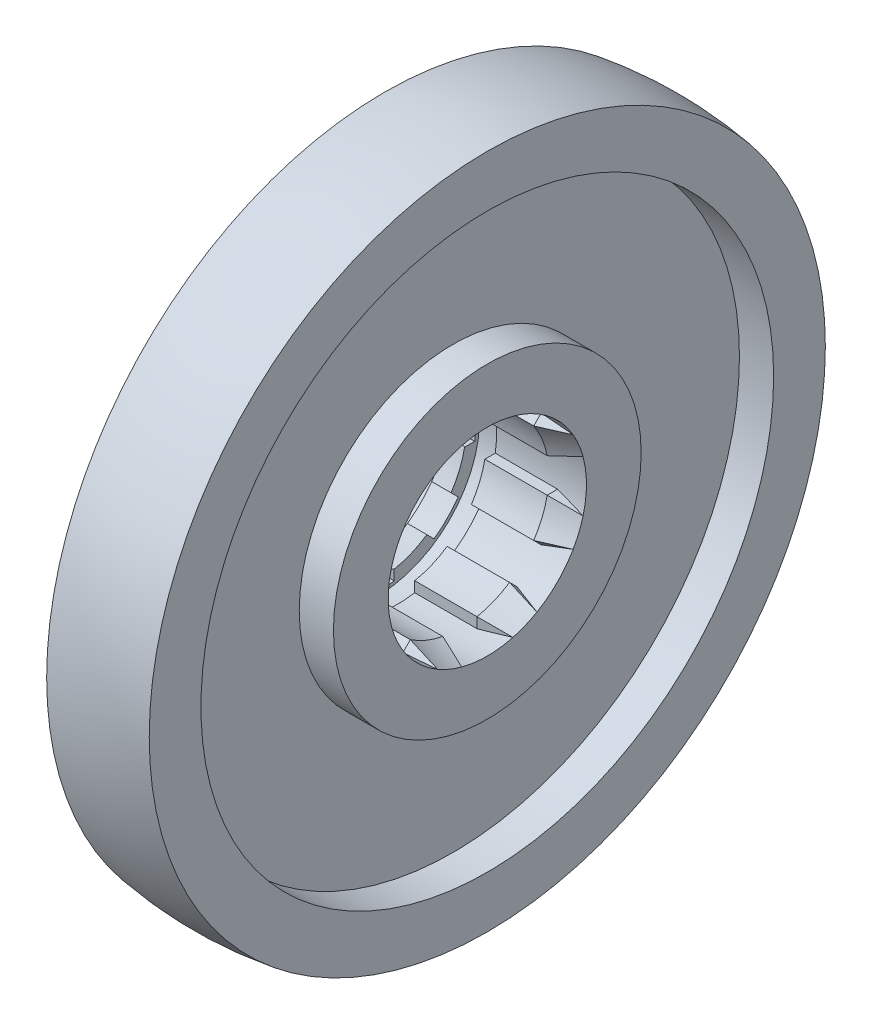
ISO-10303-21;
HEADER;
FILE_DESCRIPTION(('STEP AP214'),'2;1');
FILE_NAME('part.step','',(''),(''),'','','');
FILE_SCHEMA(('AUTOMOTIVE_DESIGN { 1 0 10303 214 1 1 1 1 }'));
ENDSEC;
DATA;
#1=APPLICATION_CONTEXT('core data for automotive mechanical design processes');
#2=APPLICATION_PROTOCOL_DEFINITION('international standard','automotive_design',2000,#1);
#3=PRODUCT_CONTEXT('',#1,'mechanical');
#4=PRODUCT('Part','Part','',(#3));
#5=PRODUCT_RELATED_PRODUCT_CATEGORY('part','',(#4));
#6=PRODUCT_DEFINITION_FORMATION('','',#4);
#7=PRODUCT_DEFINITION_CONTEXT('part definition',#1,'design');
#8=PRODUCT_DEFINITION('design','',#6,#7);
#9=PRODUCT_DEFINITION_SHAPE('','',#8);
#10=(LENGTH_UNIT() NAMED_UNIT(*) SI_UNIT(.MILLI.,.METRE.));
#11=(NAMED_UNIT(*) PLANE_ANGLE_UNIT() SI_UNIT($,.RADIAN.));
#12=(NAMED_UNIT(*) SI_UNIT($,.STERADIAN.) SOLID_ANGLE_UNIT());
#13=UNCERTAINTY_MEASURE_WITH_UNIT(LENGTH_MEASURE(1.E-05),#10,'distance_accuracy_value','');
#14=(GEOMETRIC_REPRESENTATION_CONTEXT(3) GLOBAL_UNCERTAINTY_ASSIGNED_CONTEXT((#13)) GLOBAL_UNIT_ASSIGNED_CONTEXT((#10,
#11,#12)) REPRESENTATION_CONTEXT('',''));
#15=CARTESIAN_POINT('',(0.,0.,0.));
#16=DIRECTION('',(0.,0.,1.));
#17=DIRECTION('',(1.,0.,0.));
#18=AXIS2_PLACEMENT_3D('',#15,#16,#17);
#19=CARTESIAN_POINT('',(0.,0.,0.));
#20=DIRECTION('',(1.,0.,0.));
#21=DIRECTION('',(0.,0.,-1.));
#22=AXIS2_PLACEMENT_3D('',#19,#20,#21);
#23=CYLINDRICAL_SURFACE('',#22,26.);
#24=DIRECTION('',(-1.,0.,0.));
#25=VECTOR('',#24,1.);
#26=CARTESIAN_POINT('',(15.,25.5147016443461,-5.));
#27=LINE('',#26,#25);
#28=CARTESIAN_POINT('',(6.99999999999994,25.5147016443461,-5.));
#29=VERTEX_POINT('',#28);
#30=CARTESIAN_POINT('',(-11.2346893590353,25.5147016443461,-5.));
#31=VERTEX_POINT('',#30);
#32=EDGE_CURVE('E600',#29,#31,#27,.T.);
#33=ORIENTED_EDGE('',*,*,#32,.T.);
#34=CARTESIAN_POINT('',(-11.2346893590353,0.,0.));
#35=DIRECTION('',(-1.,0.,0.));
#36=DIRECTION('',(0.,0.,1.));
#37=AXIS2_PLACEMENT_3D('',#34,#35,#36);
#38=CIRCLE('',#37,26.);
#39=CARTESIAN_POINT('',(-11.2346893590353,21.5771524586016,-14.5060846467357));
#40=VERTEX_POINT('',#39);
#41=EDGE_CURVE('E1383',#31,#40,#38,.T.);
#42=ORIENTED_EDGE('',*,*,#41,.T.);
#43=DIRECTION('',(-1.,0.,0.));
#44=VECTOR('',#43,1.);
#45=CARTESIAN_POINT('',(15.,21.5771524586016,-14.5060846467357));
#46=LINE('',#45,#44);
#47=CARTESIAN_POINT('',(7.00000000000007,21.5771524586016,-14.5060846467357));
#48=VERTEX_POINT('',#47);
#49=EDGE_CURVE('E986',#48,#40,#46,.T.);
#50=ORIENTED_EDGE('',*,*,#49,.F.);
#51=CARTESIAN_POINT('',(6.99999999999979,0.,0.));
#52=DIRECTION('',(1.,0.,0.));
#53=DIRECTION('',(0.,0.,-1.));
#54=AXIS2_PLACEMENT_3D('',#51,#52,#53);
#55=CIRCLE('',#54,26.);
#56=EDGE_CURVE('E797',#48,#29,#55,.T.);
#57=ORIENTED_EDGE('',*,*,#56,.T.);
#58=EDGE_LOOP('',(#33,#42,#50,#57));
#59=FACE_BOUND('',#58,.T.);
#60=ADVANCED_FACE('F26',(#59),#23,.F.);
#61=DIRECTION('',(-1.,0.,0.));
#62=VECTOR('',#61,1.);
#63=CARTESIAN_POINT('',(15.,14.5060846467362,-21.5771524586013));
#64=LINE('',#63,#62);
#65=CARTESIAN_POINT('',(6.99999999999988,14.5060846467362,-21.5771524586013));
#66=VERTEX_POINT('',#65);
#67=CARTESIAN_POINT('',(-11.2346893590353,14.5060846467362,-21.5771524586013));
#68=VERTEX_POINT('',#67);
#69=EDGE_CURVE('E989',#66,#68,#64,.T.);
#70=ORIENTED_EDGE('',*,*,#69,.T.);
#71=CARTESIAN_POINT('',(-11.2346893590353,0.,0.));
#72=DIRECTION('',(-1.,0.,0.));
#73=DIRECTION('',(0.,0.,1.));
#74=AXIS2_PLACEMENT_3D('',#71,#72,#73);
#75=CIRCLE('',#74,26.);
#76=CARTESIAN_POINT('',(-11.2346893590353,5.00000000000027,-25.5147016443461));
#77=VERTEX_POINT('',#76);
#78=EDGE_CURVE('E40',#68,#77,#75,.T.);
#79=ORIENTED_EDGE('',*,*,#78,.T.);
#80=DIRECTION('',(-1.,0.,0.));
#81=VECTOR('',#80,1.);
#82=CARTESIAN_POINT('',(15.,5.00000000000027,-25.5147016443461));
#83=LINE('',#82,#81);
#84=CARTESIAN_POINT('',(6.99999999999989,5.00000000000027,-25.5147016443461));
#85=VERTEX_POINT('',#84);
#86=EDGE_CURVE('E1002',#85,#77,#83,.T.);
#87=ORIENTED_EDGE('',*,*,#86,.F.);
#88=CARTESIAN_POINT('',(6.99999999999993,0.,0.));
#89=DIRECTION('',(1.,0.,0.));
#90=DIRECTION('',(0.,0.,-1.));
#91=AXIS2_PLACEMENT_3D('',#88,#89,#90);
#92=CIRCLE('',#91,26.);
#93=EDGE_CURVE('E852',#85,#66,#92,.T.);
#94=ORIENTED_EDGE('',*,*,#93,.T.);
#95=EDGE_LOOP('',(#70,#79,#87,#94));
#96=FACE_BOUND('',#95,.T.);
#97=ADVANCED_FACE('F535',(#96),#23,.F.);
#98=DIRECTION('',(-1.,0.,0.));
#99=VECTOR('',#98,1.);
#100=CARTESIAN_POINT('',(15.,-4.99999999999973,-25.5147016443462));
#101=LINE('',#100,#99);
#102=CARTESIAN_POINT('',(6.99999999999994,-4.99999999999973,-25.5147016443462));
#103=VERTEX_POINT('',#102);
#104=CARTESIAN_POINT('',(-11.2346893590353,-4.99999999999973,-25.5147016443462));
#105=VERTEX_POINT('',#104);
#106=EDGE_CURVE('E1005',#103,#105,#101,.T.);
#107=ORIENTED_EDGE('',*,*,#106,.T.);
#108=CARTESIAN_POINT('',(-11.2346893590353,0.,0.));
#109=DIRECTION('',(-1.,0.,0.));
#110=DIRECTION('',(0.,0.,1.));
#111=AXIS2_PLACEMENT_3D('',#108,#109,#110);
#112=CIRCLE('',#111,26.);
#113=CARTESIAN_POINT('',(-11.2346893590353,-14.5060846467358,-21.5771524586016));
#114=VERTEX_POINT('',#113);
#115=EDGE_CURVE('E1392',#105,#114,#112,.T.);
#116=ORIENTED_EDGE('',*,*,#115,.T.);
#117=DIRECTION('',(-1.,0.,0.));
#118=VECTOR('',#117,1.);
#119=CARTESIAN_POINT('',(15.,-14.5060846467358,-21.5771524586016));
#120=LINE('',#119,#118);
#121=CARTESIAN_POINT('',(6.99999999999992,-14.5060846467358,-21.5771524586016));
#122=VERTEX_POINT('',#121);
#123=EDGE_CURVE('E1022',#122,#114,#120,.T.);
#124=ORIENTED_EDGE('',*,*,#123,.F.);
#125=CARTESIAN_POINT('',(7.00000000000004,0.,0.));
#126=DIRECTION('',(1.,0.,0.));
#127=DIRECTION('',(0.,0.,-1.));
#128=AXIS2_PLACEMENT_3D('',#125,#126,#127);
#129=CIRCLE('',#128,26.);
#130=EDGE_CURVE('E2064',#122,#103,#129,.T.);
#131=ORIENTED_EDGE('',*,*,#130,.T.);
#132=EDGE_LOOP('',(#107,#116,#124,#131));
#133=FACE_BOUND('',#132,.T.);
#134=ADVANCED_FACE('F543',(#133),#23,.F.);
#135=DIRECTION('',(-1.,0.,0.));
#136=VECTOR('',#135,1.);
#137=CARTESIAN_POINT('',(15.,-21.5771524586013,-14.5060846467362));
#138=LINE('',#137,#136);
#139=CARTESIAN_POINT('',(6.99999999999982,-21.5771524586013,-14.5060846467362));
#140=VERTEX_POINT('',#139);
#141=CARTESIAN_POINT('',(-11.2346893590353,-21.5771524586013,-14.5060846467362));
#142=VERTEX_POINT('',#141);
#143=EDGE_CURVE('E1025',#140,#142,#138,.T.);
#144=ORIENTED_EDGE('',*,*,#143,.T.);
#145=CARTESIAN_POINT('',(-11.2346893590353,0.,0.));
#146=DIRECTION('',(-1.,0.,0.));
#147=DIRECTION('',(0.,0.,1.));
#148=AXIS2_PLACEMENT_3D('',#145,#146,#147);
#149=CIRCLE('',#148,26.);
#150=CARTESIAN_POINT('',(-11.2346893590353,-25.5147016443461,-5.00000000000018));
#151=VERTEX_POINT('',#150);
#152=EDGE_CURVE('E924',#142,#151,#149,.T.);
#153=ORIENTED_EDGE('',*,*,#152,.T.);
#154=DIRECTION('',(-1.,0.,0.));
#155=VECTOR('',#154,1.);
#156=CARTESIAN_POINT('',(15.,-25.5147016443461,-5.00000000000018));
#157=LINE('',#156,#155);
#158=CARTESIAN_POINT('',(6.99999999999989,-25.5147016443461,-5.00000000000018));
#159=VERTEX_POINT('',#158);
#160=EDGE_CURVE('E1042',#159,#151,#157,.T.);
#161=ORIENTED_EDGE('',*,*,#160,.F.);
#162=CARTESIAN_POINT('',(6.99999999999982,0.,0.));
#163=DIRECTION('',(1.,0.,0.));
#164=DIRECTION('',(0.,0.,-1.));
#165=AXIS2_PLACEMENT_3D('',#162,#163,#164);
#166=CIRCLE('',#165,26.);
#167=EDGE_CURVE('E1438',#159,#140,#166,.T.);
#168=ORIENTED_EDGE('',*,*,#167,.T.);
#169=EDGE_LOOP('',(#144,#153,#161,#168));
#170=FACE_BOUND('',#169,.T.);
#171=ADVANCED_FACE('F1437',(#170),#23,.F.);
#172=DIRECTION('',(-1.,0.,0.));
#173=VECTOR('',#172,1.);
#174=CARTESIAN_POINT('',(15.,-25.5147016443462,4.99999999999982));
#175=LINE('',#174,#173);
#176=CARTESIAN_POINT('',(6.99999999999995,-25.5147016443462,4.99999999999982));
#177=VERTEX_POINT('',#176);
#178=CARTESIAN_POINT('',(-11.2346893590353,-25.5147016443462,4.99999999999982));
#179=VERTEX_POINT('',#178);
#180=EDGE_CURVE('E1045',#177,#179,#175,.T.);
#181=ORIENTED_EDGE('',*,*,#180,.T.);
#182=CARTESIAN_POINT('',(-11.2346893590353,0.,0.));
#183=DIRECTION('',(-1.,0.,0.));
#184=DIRECTION('',(0.,0.,1.));
#185=AXIS2_PLACEMENT_3D('',#182,#183,#184);
#186=CIRCLE('',#185,26.);
#187=CARTESIAN_POINT('',(-11.2346893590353,-21.5771524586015,14.5060846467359));
#188=VERTEX_POINT('',#187);
#189=EDGE_CURVE('E949',#179,#188,#186,.T.);
#190=ORIENTED_EDGE('',*,*,#189,.T.);
#191=DIRECTION('',(-1.,0.,0.));
#192=VECTOR('',#191,1.);
#193=CARTESIAN_POINT('',(15.,-21.5771524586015,14.5060846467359));
#194=LINE('',#193,#192);
#195=CARTESIAN_POINT('',(6.99999999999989,-21.5771524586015,14.5060846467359));
#196=VERTEX_POINT('',#195);
#197=EDGE_CURVE('E1062',#196,#188,#194,.T.);
#198=ORIENTED_EDGE('',*,*,#197,.F.);
#199=CARTESIAN_POINT('',(7.00000000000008,0.,0.));
#200=DIRECTION('',(1.,0.,0.));
#201=DIRECTION('',(0.,0.,-1.));
#202=AXIS2_PLACEMENT_3D('',#199,#200,#201);
#203=CIRCLE('',#202,26.);
#204=EDGE_CURVE('E1473',#196,#177,#203,.T.);
#205=ORIENTED_EDGE('',*,*,#204,.T.);
#206=EDGE_LOOP('',(#181,#190,#198,#205));
#207=FACE_BOUND('',#206,.T.);
#208=ADVANCED_FACE('F1563',(#207),#23,.F.);
#209=DIRECTION('',(-1.,0.,0.));
#210=VECTOR('',#209,1.);
#211=CARTESIAN_POINT('',(15.,-14.5060846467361,21.5771524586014));
#212=LINE('',#211,#210);
#213=CARTESIAN_POINT('',(6.99999999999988,-14.5060846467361,21.5771524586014));
#214=VERTEX_POINT('',#213);
#215=CARTESIAN_POINT('',(-11.2346893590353,-14.5060846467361,21.5771524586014));
#216=VERTEX_POINT('',#215);
#217=EDGE_CURVE('E1065',#214,#216,#212,.T.);
#218=ORIENTED_EDGE('',*,*,#217,.T.);
#219=CARTESIAN_POINT('',(-11.2346893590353,0.,0.));
#220=DIRECTION('',(-1.,0.,0.));
#221=DIRECTION('',(0.,0.,1.));
#222=AXIS2_PLACEMENT_3D('',#219,#220,#221);
#223=CIRCLE('',#222,26.);
#224=CARTESIAN_POINT('',(-11.2346893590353,-5.00000000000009,25.5147016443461));
#225=VERTEX_POINT('',#224);
#226=EDGE_CURVE('E960',#216,#225,#223,.T.);
#227=ORIENTED_EDGE('',*,*,#226,.T.);
#228=DIRECTION('',(-1.,0.,0.));
#229=VECTOR('',#228,1.);
#230=CARTESIAN_POINT('',(15.,-5.00000000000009,25.5147016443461));
#231=LINE('',#230,#229);
#232=CARTESIAN_POINT('',(6.99999999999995,-5.00000000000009,25.5147016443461));
#233=VERTEX_POINT('',#232);
#234=EDGE_CURVE('E1080',#233,#225,#231,.T.);
#235=ORIENTED_EDGE('',*,*,#234,.F.);
#236=CARTESIAN_POINT('',(7.00000000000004,0.,0.));
#237=DIRECTION('',(1.,0.,0.));
#238=DIRECTION('',(0.,0.,-1.));
#239=AXIS2_PLACEMENT_3D('',#236,#237,#238);
#240=CIRCLE('',#239,26.);
#241=EDGE_CURVE('E1493',#233,#214,#240,.T.);
#242=ORIENTED_EDGE('',*,*,#241,.T.);
#243=EDGE_LOOP('',(#218,#227,#235,#242));
#244=FACE_BOUND('',#243,.T.);
#245=ADVANCED_FACE('F559',(#244),#23,.F.);
#246=DIRECTION('',(-1.,0.,0.));
#247=VECTOR('',#246,1.);
#248=CARTESIAN_POINT('',(15.,4.99999999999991,25.5147016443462));
#249=LINE('',#248,#247);
#250=CARTESIAN_POINT('',(6.99999999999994,4.99999999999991,25.5147016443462));
#251=VERTEX_POINT('',#250);
#252=CARTESIAN_POINT('',(-11.2346893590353,4.99999999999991,25.5147016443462));
#253=VERTEX_POINT('',#252);
#254=EDGE_CURVE('E1083',#251,#253,#249,.T.);
#255=ORIENTED_EDGE('',*,*,#254,.T.);
#256=CARTESIAN_POINT('',(-11.2346893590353,0.,0.));
#257=DIRECTION('',(-1.,0.,0.));
#258=DIRECTION('',(0.,0.,1.));
#259=AXIS2_PLACEMENT_3D('',#256,#257,#258);
#260=CIRCLE('',#259,26.);
#261=CARTESIAN_POINT('',(-11.2346893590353,14.5060846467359,21.5771524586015));
#262=VERTEX_POINT('',#261);
#263=EDGE_CURVE('E940',#253,#262,#260,.T.);
#264=ORIENTED_EDGE('',*,*,#263,.T.);
#265=DIRECTION('',(-1.,0.,0.));
#266=VECTOR('',#265,1.);
#267=CARTESIAN_POINT('',(15.,14.5060846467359,21.5771524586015));
#268=LINE('',#267,#266);
#269=CARTESIAN_POINT('',(6.99999999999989,14.5060846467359,21.5771524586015));
#270=VERTEX_POINT('',#269);
#271=EDGE_CURVE('E574',#270,#262,#268,.T.);
#272=ORIENTED_EDGE('',*,*,#271,.F.);
#273=CARTESIAN_POINT('',(6.99999999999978,0.,0.));
#274=DIRECTION('',(1.,0.,0.));
#275=DIRECTION('',(0.,0.,-1.));
#276=AXIS2_PLACEMENT_3D('',#273,#274,#275);
#277=CIRCLE('',#276,26.);
#278=EDGE_CURVE('E767',#270,#251,#277,.T.);
#279=ORIENTED_EDGE('',*,*,#278,.T.);
#280=EDGE_LOOP('',(#255,#264,#272,#279));
#281=FACE_BOUND('',#280,.T.);
#282=ADVANCED_FACE('F550',(#281),#23,.F.);
#283=DIRECTION('',(-1.,0.,0.));
#284=VECTOR('',#283,1.);
#285=CARTESIAN_POINT('',(15.,21.5771524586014,14.506084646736));
#286=LINE('',#285,#284);
#287=CARTESIAN_POINT('',(6.99999999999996,21.5771524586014,14.506084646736));
#288=VERTEX_POINT('',#287);
#289=CARTESIAN_POINT('',(-11.2346893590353,21.5771524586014,14.506084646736));
#290=VERTEX_POINT('',#289);
#291=EDGE_CURVE('E565',#288,#290,#286,.T.);
#292=ORIENTED_EDGE('',*,*,#291,.T.);
#293=CARTESIAN_POINT('',(-11.2346893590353,0.,0.));
#294=DIRECTION('',(-1.,0.,0.));
#295=DIRECTION('',(0.,0.,1.));
#296=AXIS2_PLACEMENT_3D('',#293,#294,#295);
#297=CIRCLE('',#296,26.);
#298=CARTESIAN_POINT('',(-11.2346893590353,25.5147016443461,5.));
#299=VERTEX_POINT('',#298);
#300=EDGE_CURVE('E567',#290,#299,#297,.T.);
#301=ORIENTED_EDGE('',*,*,#300,.T.);
#302=DIRECTION('',(-1.,0.,0.));
#303=VECTOR('',#302,1.);
#304=CARTESIAN_POINT('',(15.,25.5147016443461,5.));
#305=LINE('',#304,#303);
#306=CARTESIAN_POINT('',(6.99999999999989,25.5147016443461,5.));
#307=VERTEX_POINT('',#306);
#308=EDGE_CURVE('E598',#307,#299,#305,.T.);
#309=ORIENTED_EDGE('',*,*,#308,.F.);
#310=CARTESIAN_POINT('',(6.99999999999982,0.,0.));
#311=DIRECTION('',(1.,0.,0.));
#312=DIRECTION('',(0.,0.,-1.));
#313=AXIS2_PLACEMENT_3D('',#310,#311,#312);
#314=CIRCLE('',#313,26.);
#315=EDGE_CURVE('E570',#307,#288,#314,.T.);
#316=ORIENTED_EDGE('',*,*,#315,.T.);
#317=EDGE_LOOP('',(#292,#301,#309,#316));
#318=FACE_BOUND('',#317,.T.);
#319=ADVANCED_FACE('F538',(#318),#23,.F.);
#320=CARTESIAN_POINT('',(15.,0.,0.));
#321=DIRECTION('',(-1.,0.,0.));
#322=DIRECTION('',(0.,0.,1.));
#323=AXIS2_PLACEMENT_3D('',#320,#321,#322);
#324=CYLINDRICAL_SURFACE('',#323,29.);
#325=CARTESIAN_POINT('',(-17.2346893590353,0.,0.));
#326=DIRECTION('',(1.,0.,0.));
#327=DIRECTION('',(0.,0.,-1.));
#328=AXIS2_PLACEMENT_3D('',#325,#326,#327);
#329=CIRCLE('',#328,29.);
#330=CARTESIAN_POINT('',(-17.2346893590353,28.5657137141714,5.));
#331=VERTEX_POINT('',#330);
#332=CARTESIAN_POINT('',(-17.2346893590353,28.5657137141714,-5.));
#333=VERTEX_POINT('',#332);
#334=EDGE_CURVE('E1338',#331,#333,#329,.F.);
#335=ORIENTED_EDGE('',*,*,#334,.F.);
#336=DIRECTION('',(-1.,0.,0.));
#337=VECTOR('',#336,1.);
#338=CARTESIAN_POINT('',(15.,28.5657137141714,5.));
#339=LINE('',#338,#337);
#340=CARTESIAN_POINT('',(-25.,28.5657137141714,5.));
#341=VERTEX_POINT('',#340);
#342=EDGE_CURVE('E597',#331,#341,#339,.T.);
#343=ORIENTED_EDGE('',*,*,#342,.T.);
#344=CARTESIAN_POINT('',(-25.,0.,0.));
#345=DIRECTION('',(-1.,0.,0.));
#346=DIRECTION('',(0.,0.,1.));
#347=AXIS2_PLACEMENT_3D('',#344,#345,#346);
#348=CIRCLE('',#347,29.);
#349=CARTESIAN_POINT('',(-25.,28.5657137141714,-5.));
#350=VERTEX_POINT('',#349);
#351=EDGE_CURVE('E585',#341,#350,#348,.T.);
#352=ORIENTED_EDGE('',*,*,#351,.T.);
#353=DIRECTION('',(-1.,0.,0.));
#354=VECTOR('',#353,1.);
#355=CARTESIAN_POINT('',(15.,28.5657137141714,-5.));
#356=LINE('',#355,#354);
#357=EDGE_CURVE('E592',#333,#350,#356,.T.);
#358=ORIENTED_EDGE('',*,*,#357,.F.);
#359=EDGE_LOOP('',(#335,#343,#352,#358));
#360=FACE_BOUND('',#359,.T.);
#361=ADVANCED_FACE('F549',(#360),#324,.F.);
#362=CARTESIAN_POINT('',(-11.2346893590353,0.,0.));
#363=DIRECTION('',(-1.,0.,0.));
#364=DIRECTION('',(0.,0.,1.));
#365=AXIS2_PLACEMENT_3D('',#362,#363,#364);
#366=CIRCLE('',#365,29.);
#367=CARTESIAN_POINT('',(-11.2346893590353,28.5657137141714,-5.));
#368=VERTEX_POINT('',#367);
#369=CARTESIAN_POINT('',(-11.2346893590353,28.5657137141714,5.));
#370=VERTEX_POINT('',#369);
#371=EDGE_CURVE('E1390',#368,#370,#366,.F.);
#372=ORIENTED_EDGE('',*,*,#371,.F.);
#373=CARTESIAN_POINT('',(6.99999999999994,28.5657137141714,-5.));
#374=VERTEX_POINT('',#373);
#375=EDGE_CURVE('E602',#374,#368,#356,.T.);
#376=ORIENTED_EDGE('',*,*,#375,.F.);
#377=CARTESIAN_POINT('',(-9.00000000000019,0.,0.));
#378=DIRECTION('',(0.298274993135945,0.,0.95447997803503));
#379=DIRECTION('',(-0.95447997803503,0.,0.298274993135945));
#380=AXIS2_PLACEMENT_3D('',#377,#378,#379);
#381=ELLIPSE('',#380,97.2257167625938,29.);
#382=CARTESIAN_POINT('',(15.,28.0133896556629,-7.5));
#383=VERTEX_POINT('',#382);
#384=EDGE_CURVE('E654',#374,#383,#381,.F.);
#385=ORIENTED_EDGE('',*,*,#384,.T.);
#386=CARTESIAN_POINT('',(15.,0.,0.));
#387=DIRECTION('',(-1.,0.,0.));
#388=DIRECTION('',(0.,0.,1.));
#389=AXIS2_PLACEMENT_3D('',#386,#387,#388);
#390=CIRCLE('',#389,29.);
#391=CARTESIAN_POINT('',(15.,28.0133896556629,7.5));
#392=VERTEX_POINT('',#391);
#393=EDGE_CURVE('E588',#392,#383,#390,.T.);
#394=ORIENTED_EDGE('',*,*,#393,.F.);
#395=CARTESIAN_POINT('',(-9.00000000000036,0.,0.));
#396=DIRECTION('',(-0.298274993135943,0.,0.954479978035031));
#397=DIRECTION('',(-0.954479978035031,0.,-0.298274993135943));
#398=AXIS2_PLACEMENT_3D('',#395,#396,#397);
#399=ELLIPSE('',#398,97.2257167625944,29.);
#400=CARTESIAN_POINT('',(6.99999999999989,28.5657137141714,5.));
#401=VERTEX_POINT('',#400);
#402=EDGE_CURVE('E660',#392,#401,#399,.T.);
#403=ORIENTED_EDGE('',*,*,#402,.T.);
#404=EDGE_CURVE('E593',#401,#370,#339,.T.);
#405=ORIENTED_EDGE('',*,*,#404,.T.);
#406=EDGE_LOOP('',(#372,#376,#385,#394,#403,#405));
#407=FACE_BOUND('',#406,.T.);
#408=ADVANCED_FACE('F556',(#407),#324,.F.);
#409=CARTESIAN_POINT('',(15.,-68.3414213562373,5.00000000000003));
#410=DIRECTION('',(0.,0.,-1.));
#411=DIRECTION('',(0.,1.,0.));
#412=AXIS2_PLACEMENT_3D('',#409,#410,#411);
#413=PLANE('',#412);
#414=ORIENTED_EDGE('',*,*,#342,.F.);
#415=DIRECTION('',(0.,-1.,0.));
#416=VECTOR('',#415,1.);
#417=CARTESIAN_POINT('',(-17.2346893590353,-68.3414213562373,5.00000000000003));
#418=LINE('',#417,#416);
#419=CARTESIAN_POINT('',(-17.2346893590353,25.6043782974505,5.));
#420=VERTEX_POINT('',#419);
#421=EDGE_CURVE('E1342',#331,#420,#418,.T.);
#422=ORIENTED_EDGE('',*,*,#421,.T.);
#423=CARTESIAN_POINT('',(-17.0000000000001,25.5147016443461,5.));
#424=CARTESIAN_POINT('',(-17.6664989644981,25.7693921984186,5.));
#425=CARTESIAN_POINT('',(-18.3330446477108,26.0239604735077,5.));
#426=CARTESIAN_POINT('',(-19.6662220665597,26.5328714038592,5.));
#427=CARTESIAN_POINT('',(-20.3328538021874,26.7872140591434,5.));
#428=CARTESIAN_POINT('',(-21.6661960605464,27.2956927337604,5.));
#429=CARTESIAN_POINT('',(-22.3329065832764,27.5498287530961,5.));
#430=CARTESIAN_POINT('',(-23.6664003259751,28.0579101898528,5.));
#431=CARTESIAN_POINT('',(-24.3331835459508,28.3118556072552,5.));
#432=CARTESIAN_POINT('',(-25.,28.5657137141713,5.));
#433=B_SPLINE_CURVE_WITH_KNOTS('',3,(#423,#424,#425,#426,#427,#428,#429,#430,#431,#432),
.UNSPECIFIED.,.F.,.F.,(4,2,2,2,4),(0.,2.14051237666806,4.28102454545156,6.42153668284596,
8.56204902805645),.UNSPECIFIED.);
#434=EDGE_CURVE('E1154',#420,#341,#433,.T.);
#435=ORIENTED_EDGE('',*,*,#434,.T.);
#436=EDGE_LOOP('',(#414,#422,#435));
#437=FACE_BOUND('',#436,.T.);
#438=ADVANCED_FACE('F785',(#437),#413,.T.);
#439=ORIENTED_EDGE('',*,*,#308,.T.);
#440=DIRECTION('',(0.,1.,0.));
#441=VECTOR('',#440,1.);
#442=CARTESIAN_POINT('',(-11.2346893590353,-68.3414213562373,5.00000000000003));
#443=LINE('',#442,#441);
#444=EDGE_CURVE('E1400',#299,#370,#443,.T.);
#445=ORIENTED_EDGE('',*,*,#444,.T.);
#446=ORIENTED_EDGE('',*,*,#404,.F.);
#447=DIRECTION('',(0.,-1.,0.));
#448=VECTOR('',#447,1.);
#449=CARTESIAN_POINT('',(6.99999999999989,-68.3414213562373,5.00000000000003));
#450=LINE('',#449,#448);
#451=EDGE_CURVE('E657',#401,#307,#450,.T.);
#452=ORIENTED_EDGE('',*,*,#451,.T.);
#453=EDGE_LOOP('',(#439,#445,#446,#452));
#454=FACE_BOUND('',#453,.T.);
#455=ADVANCED_FACE('F1912',(#454),#413,.T.);
#456=CARTESIAN_POINT('',(15.,-68.3414213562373,-5.00000000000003));
#457=DIRECTION('',(0.,0.,-1.));
#458=DIRECTION('',(0.,1.,0.));
#459=AXIS2_PLACEMENT_3D('',#456,#457,#458);
#460=PLANE('',#459);
#461=DIRECTION('',(0.,-1.,0.));
#462=VECTOR('',#461,1.);
#463=CARTESIAN_POINT('',(-17.2346893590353,-68.3414213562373,-5.00000000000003));
#464=LINE('',#463,#462);
#465=CARTESIAN_POINT('',(-17.2346893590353,25.6043782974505,-5.));
#466=VERTEX_POINT('',#465);
#467=EDGE_CURVE('E1348',#333,#466,#464,.T.);
#468=ORIENTED_EDGE('',*,*,#467,.F.);
#469=ORIENTED_EDGE('',*,*,#357,.T.);
#470=CARTESIAN_POINT('',(-25.,28.5657137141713,-5.));
#471=CARTESIAN_POINT('',(-24.3331835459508,28.3118556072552,-5.));
#472=CARTESIAN_POINT('',(-23.6664003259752,28.0579101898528,-5.));
#473=CARTESIAN_POINT('',(-22.3329065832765,27.5498287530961,-5.));
#474=CARTESIAN_POINT('',(-21.6661960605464,27.2956927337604,-5.));
#475=CARTESIAN_POINT('',(-20.3328538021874,26.7872140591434,-5.));
#476=CARTESIAN_POINT('',(-19.6662220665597,26.5328714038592,-5.));
#477=CARTESIAN_POINT('',(-18.3330446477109,26.0239604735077,-5.));
#478=CARTESIAN_POINT('',(-17.6664989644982,25.7693921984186,-5.));
#479=CARTESIAN_POINT('',(-17.0000000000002,25.5147016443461,-5.));
#480=B_SPLINE_CURVE_WITH_KNOTS('',3,(#470,#471,#472,#473,#474,#475,#476,#477,#478,#479),
.UNSPECIFIED.,.F.,.F.,(4,2,2,2,4),(0.,2.14051234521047,4.28102448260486,6.42153665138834,
8.56204902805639),.UNSPECIFIED.);
#481=EDGE_CURVE('E1173',#350,#466,#480,.T.);
#482=ORIENTED_EDGE('',*,*,#481,.T.);
#483=EDGE_LOOP('',(#468,#469,#482));
#484=FACE_BOUND('',#483,.T.);
#485=ADVANCED_FACE('F1347',(#484),#460,.F.);
#486=DIRECTION('',(0.,1.,0.));
#487=VECTOR('',#486,1.);
#488=CARTESIAN_POINT('',(-11.2346893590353,-68.3414213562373,-5.00000000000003));
#489=LINE('',#488,#487);
#490=EDGE_CURVE('E1388',#31,#368,#489,.T.);
#491=ORIENTED_EDGE('',*,*,#490,.F.);
#492=ORIENTED_EDGE('',*,*,#32,.F.);
#493=DIRECTION('',(0.,1.,0.));
#494=VECTOR('',#493,1.);
#495=CARTESIAN_POINT('',(6.99999999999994,28.5657137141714,-5.));
#496=LINE('',#495,#494);
#497=EDGE_CURVE('E652',#29,#374,#496,.T.);
#498=ORIENTED_EDGE('',*,*,#497,.T.);
#499=ORIENTED_EDGE('',*,*,#375,.T.);
#500=EDGE_LOOP('',(#491,#492,#498,#499));
#501=FACE_BOUND('',#500,.T.);
#502=ADVANCED_FACE('F1900',(#501),#460,.F.);
#503=CARTESIAN_POINT('',(15.,0.,0.));
#504=DIRECTION('',(-1.,0.,0.));
#505=DIRECTION('',(0.,0.,1.));
#506=AXIS2_PLACEMENT_3D('',#503,#504,#505);
#507=CYLINDRICAL_SURFACE('',#506,29.);
#508=CARTESIAN_POINT('',(-17.2346893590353,0.,0.));
#509=DIRECTION('',(1.,0.,0.));
#510=DIRECTION('',(0.,0.,-1.));
#511=AXIS2_PLACEMENT_3D('',#508,#509,#510);
#512=CIRCLE('',#511,29.);
#513=CARTESIAN_POINT('',(-17.2346893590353,16.6634759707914,23.7345437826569));
#514=VERTEX_POINT('',#513);
#515=CARTESIAN_POINT('',(-17.2346893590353,23.7345437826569,16.6634759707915));
#516=VERTEX_POINT('',#515);
#517=EDGE_CURVE('E1097',#514,#516,#512,.F.);
#518=ORIENTED_EDGE('',*,*,#517,.F.);
#519=DIRECTION('',(-1.,0.,0.));
#520=VECTOR('',#519,1.);
#521=CARTESIAN_POINT('',(15.,16.6634759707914,23.7345437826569));
#522=LINE('',#521,#520);
#523=CARTESIAN_POINT('',(-25.,16.6634759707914,23.7345437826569));
#524=VERTEX_POINT('',#523);
#525=EDGE_CURVE('E578',#514,#524,#522,.T.);
#526=ORIENTED_EDGE('',*,*,#525,.T.);
#527=CARTESIAN_POINT('',(-25.,0.,0.));
#528=DIRECTION('',(-1.,0.,0.));
#529=DIRECTION('',(0.,-0.707106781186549,0.707106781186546));
#530=AXIS2_PLACEMENT_3D('',#527,#528,#529);
#531=CIRCLE('',#530,29.);
#532=CARTESIAN_POINT('',(-25.,23.7345437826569,16.6634759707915));
#533=VERTEX_POINT('',#532);
#534=EDGE_CURVE('E1079',#524,#533,#531,.T.);
#535=ORIENTED_EDGE('',*,*,#534,.T.);
#536=DIRECTION('',(-1.,0.,0.));
#537=VECTOR('',#536,1.);
#538=CARTESIAN_POINT('',(15.,23.7345437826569,16.6634759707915));
#539=LINE('',#538,#537);
#540=EDGE_CURVE('E581',#516,#533,#539,.T.);
#541=ORIENTED_EDGE('',*,*,#540,.F.);
#542=EDGE_LOOP('',(#518,#526,#535,#541));
#543=FACE_BOUND('',#542,.T.);
#544=ADVANCED_FACE('F778',(#543),#507,.F.);
#545=CARTESIAN_POINT('',(-11.2346893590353,0.,0.));
#546=DIRECTION('',(-1.,0.,0.));
#547=DIRECTION('',(0.,0.,1.));
#548=AXIS2_PLACEMENT_3D('',#545,#546,#547);
#549=CIRCLE('',#548,29.);
#550=CARTESIAN_POINT('',(-11.2346893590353,23.7345437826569,16.6634759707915));
#551=VERTEX_POINT('',#550);
#552=CARTESIAN_POINT('',(-11.2346893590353,16.6634759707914,23.7345437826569));
#553=VERTEX_POINT('',#552);
#554=EDGE_CURVE('E921',#551,#553,#549,.F.);
#555=ORIENTED_EDGE('',*,*,#554,.F.);
#556=CARTESIAN_POINT('',(6.99999999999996,23.7345437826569,16.6634759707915));
#557=VERTEX_POINT('',#556);
#558=EDGE_CURVE('E575',#557,#551,#539,.T.);
#559=ORIENTED_EDGE('',*,*,#558,.F.);
#560=CARTESIAN_POINT('',(-9.00000000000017,0.,0.));
#561=DIRECTION('',(0.298274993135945,-0.674919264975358,0.674919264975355));
#562=DIRECTION('',(-0.95447997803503,-0.210912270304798,0.210912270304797));
#563=AXIS2_PLACEMENT_3D('',#560,#561,#562);
#564=ELLIPSE('',#563,97.2257167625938,29.);
#565=CARTESIAN_POINT('',(15.,25.1117586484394,14.5051569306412));
#566=VERTEX_POINT('',#565);
#567=EDGE_CURVE('E664',#557,#566,#564,.F.);
#568=ORIENTED_EDGE('',*,*,#567,.T.);
#569=CARTESIAN_POINT('',(15.,0.,0.));
#570=DIRECTION('',(-1.,0.,0.));
#571=DIRECTION('',(0.,-0.707106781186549,0.707106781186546));
#572=AXIS2_PLACEMENT_3D('',#569,#570,#571);
#573=CIRCLE('',#572,29.);
#574=CARTESIAN_POINT('',(15.,14.5051569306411,25.1117586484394));
#575=VERTEX_POINT('',#574);
#576=EDGE_CURVE('E904',#575,#566,#573,.T.);
#577=ORIENTED_EDGE('',*,*,#576,.F.);
#578=CARTESIAN_POINT('',(-9.00000000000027,0.,0.));
#579=DIRECTION('',(-0.298274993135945,-0.674919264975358,0.674919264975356));
#580=DIRECTION('',(-0.954479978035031,0.210912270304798,-0.210912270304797));
#581=AXIS2_PLACEMENT_3D('',#578,#579,#580);
#582=ELLIPSE('',#581,97.2257167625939,29.);
#583=CARTESIAN_POINT('',(6.99999999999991,16.6634759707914,23.7345437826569));
#584=VERTEX_POINT('',#583);
#585=EDGE_CURVE('E700',#575,#584,#582,.T.);
#586=ORIENTED_EDGE('',*,*,#585,.T.);
#587=EDGE_CURVE('E589',#584,#553,#522,.T.);
#588=ORIENTED_EDGE('',*,*,#587,.T.);
#589=EDGE_LOOP('',(#555,#559,#568,#577,#586,#588));
#590=FACE_BOUND('',#589,.T.);
#591=ADVANCED_FACE('F919',(#590),#507,.F.);
#592=CARTESIAN_POINT('',(15.,-51.8602163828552,-44.7891485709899));
#593=DIRECTION('',(0.,0.707106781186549,-0.707106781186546));
#594=DIRECTION('',(0.,0.707106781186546,0.707106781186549));
#595=AXIS2_PLACEMENT_3D('',#592,#593,#594);
#596=PLANE('',#595);
#597=ORIENTED_EDGE('',*,*,#525,.F.);
#598=DIRECTION('',(0.,-0.707106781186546,-0.707106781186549));
#599=VECTOR('',#598,1.);
#600=CARTESIAN_POINT('',(-17.2346893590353,-51.8602163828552,-44.7891485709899));
#601=LINE('',#600,#599);
#602=CARTESIAN_POINT('',(-17.2346893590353,14.5694956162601,21.6405634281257));
#603=VERTEX_POINT('',#602);
#604=EDGE_CURVE('E1103',#514,#603,#601,.T.);
#605=ORIENTED_EDGE('',*,*,#604,.T.);
#606=CARTESIAN_POINT('',(-17.0000000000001,14.5060846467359,21.5771524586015));
#607=CARTESIAN_POINT('',(-17.6664989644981,14.6861780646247,21.7572458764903));
#608=CARTESIAN_POINT('',(-18.3330446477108,14.8661850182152,21.9372528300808));
#609=CARTESIAN_POINT('',(-19.6662220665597,15.2260393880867,22.2971071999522));
#610=CARTESIAN_POINT('',(-20.3328538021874,15.4058868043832,22.4769546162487));
#611=CARTESIAN_POINT('',(-21.6661960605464,15.7654355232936,22.8365033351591));
#612=CARTESIAN_POINT('',(-22.3329065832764,15.9451368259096,23.0162046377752));
#613=CARTESIAN_POINT('',(-23.6664003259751,16.3044046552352,23.3754724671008));
#614=CARTESIAN_POINT('',(-24.3331835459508,16.4839711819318,23.5550389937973));
#615=CARTESIAN_POINT('',(-25.,16.6634759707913,23.7345437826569));
#616=B_SPLINE_CURVE_WITH_KNOTS('',3,(#606,#607,#608,#609,#610,#611,#612,#613,#614,#615),
.UNSPECIFIED.,.F.,.F.,(4,2,2,2,4),(0.,2.14051237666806,4.28102454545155,6.42153668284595,
8.56204902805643),.UNSPECIFIED.);
#617=EDGE_CURVE('E1101',#603,#524,#616,.T.);
#618=ORIENTED_EDGE('',*,*,#617,.T.);
#619=EDGE_LOOP('',(#597,#605,#618));
#620=FACE_BOUND('',#619,.T.);
#621=ADVANCED_FACE('F1102',(#620),#596,.T.);
#622=ORIENTED_EDGE('',*,*,#271,.T.);
#623=DIRECTION('',(0.,0.707106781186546,0.707106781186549));
#624=VECTOR('',#623,1.);
#625=CARTESIAN_POINT('',(-11.2346893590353,-51.8602163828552,-44.7891485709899));
#626=LINE('',#625,#624);
#627=EDGE_CURVE('E938',#262,#553,#626,.T.);
#628=ORIENTED_EDGE('',*,*,#627,.T.);
#629=ORIENTED_EDGE('',*,*,#587,.F.);
#630=DIRECTION('',(0.,-0.707106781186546,-0.707106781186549));
#631=VECTOR('',#630,1.);
#632=CARTESIAN_POINT('',(6.99999999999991,-51.8602163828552,-44.7891485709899));
#633=LINE('',#632,#631);
#634=EDGE_CURVE('E697',#584,#270,#633,.T.);
#635=ORIENTED_EDGE('',*,*,#634,.T.);
#636=EDGE_LOOP('',(#622,#628,#629,#635));
#637=FACE_BOUND('',#636,.T.);
#638=ADVANCED_FACE('F1144',(#637),#596,.T.);
#639=CARTESIAN_POINT('',(15.,-44.7891485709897,-51.8602163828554));
#640=DIRECTION('',(0.,0.707106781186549,-0.707106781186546));
#641=DIRECTION('',(0.,0.707106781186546,0.707106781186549));
#642=AXIS2_PLACEMENT_3D('',#639,#640,#641);
#643=PLANE('',#642);
#644=DIRECTION('',(0.,-0.707106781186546,-0.707106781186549));
#645=VECTOR('',#644,1.);
#646=CARTESIAN_POINT('',(-17.2346893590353,-44.7891485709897,-51.8602163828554));
#647=LINE('',#646,#645);
#648=CARTESIAN_POINT('',(-17.2346893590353,21.6405634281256,14.5694956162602));
#649=VERTEX_POINT('',#648);
#650=EDGE_CURVE('E2025',#516,#649,#647,.T.);
#651=ORIENTED_EDGE('',*,*,#650,.F.);
#652=ORIENTED_EDGE('',*,*,#540,.T.);
#653=CARTESIAN_POINT('',(-25.,23.7345437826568,16.6634759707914));
#654=CARTESIAN_POINT('',(-24.3331835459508,23.5550389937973,16.4839711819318));
#655=CARTESIAN_POINT('',(-23.6664003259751,23.3754724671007,16.3044046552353));
#656=CARTESIAN_POINT('',(-22.3329065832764,23.0162046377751,15.9451368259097));
#657=CARTESIAN_POINT('',(-21.6661960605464,22.8365033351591,15.7654355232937));
#658=CARTESIAN_POINT('',(-20.3328538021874,22.4769546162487,15.4058868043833));
#659=CARTESIAN_POINT('',(-19.6662220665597,22.2971071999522,15.2260393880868));
#660=CARTESIAN_POINT('',(-18.3330446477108,21.9372528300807,14.8661850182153));
#661=CARTESIAN_POINT('',(-17.6664989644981,21.7572458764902,14.6861780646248));
#662=CARTESIAN_POINT('',(-17.0000000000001,21.5771524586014,14.506084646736));
#663=B_SPLINE_CURVE_WITH_KNOTS('',3,(#653,#654,#655,#656,#657,#658,#659,#660,#661,#662),
.UNSPECIFIED.,.F.,.F.,(4,2,2,2,4),(0.,2.14051234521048,4.28102448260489,6.42153665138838,
8.56204902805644),.UNSPECIFIED.);
#664=EDGE_CURVE('E1107',#533,#649,#663,.T.);
#665=ORIENTED_EDGE('',*,*,#664,.T.);
#666=EDGE_LOOP('',(#651,#652,#665));
#667=FACE_BOUND('',#666,.T.);
#668=ADVANCED_FACE('F1145',(#667),#643,.F.);
#669=DIRECTION('',(0.,0.707106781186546,0.707106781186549));
#670=VECTOR('',#669,1.);
#671=CARTESIAN_POINT('',(-11.2346893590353,-44.7891485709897,-51.8602163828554));
#672=LINE('',#671,#670);
#673=EDGE_CURVE('E925',#290,#551,#672,.T.);
#674=ORIENTED_EDGE('',*,*,#673,.F.);
#675=ORIENTED_EDGE('',*,*,#291,.F.);
#676=DIRECTION('',(0.,0.707106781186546,0.707106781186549));
#677=VECTOR('',#676,1.);
#678=CARTESIAN_POINT('',(6.99999999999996,23.7345437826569,16.6634759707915));
#679=LINE('',#678,#677);
#680=EDGE_CURVE('E662',#288,#557,#679,.T.);
#681=ORIENTED_EDGE('',*,*,#680,.T.);
#682=ORIENTED_EDGE('',*,*,#558,.T.);
#683=EDGE_LOOP('',(#674,#675,#681,#682));
#684=FACE_BOUND('',#683,.T.);
#685=ADVANCED_FACE('F916',(#684),#643,.F.);
#686=CARTESIAN_POINT('',(15.,0.,0.));
#687=DIRECTION('',(-1.,0.,0.));
#688=DIRECTION('',(0.,0.,1.));
#689=AXIS2_PLACEMENT_3D('',#686,#687,#688);
#690=CYLINDRICAL_SURFACE('',#689,29.);
#691=CARTESIAN_POINT('',(-17.2346893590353,0.,0.));
#692=DIRECTION('',(1.,0.,0.));
#693=DIRECTION('',(0.,0.,-1.));
#694=AXIS2_PLACEMENT_3D('',#691,#692,#693);
#695=CIRCLE('',#694,29.);
#696=CARTESIAN_POINT('',(-17.2346893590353,-5.0000000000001,28.5657137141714));
#697=VERTEX_POINT('',#696);
#698=CARTESIAN_POINT('',(-17.2346893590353,4.9999999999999,28.5657137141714));
#699=VERTEX_POINT('',#698);
#700=EDGE_CURVE('E451',#697,#699,#695,.F.);
#701=ORIENTED_EDGE('',*,*,#700,.F.);
#702=DIRECTION('',(-1.,0.,0.));
#703=VECTOR('',#702,1.);
#704=CARTESIAN_POINT('',(15.,-5.0000000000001,28.5657137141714));
#705=LINE('',#704,#703);
#706=CARTESIAN_POINT('',(-25.,-5.0000000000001,28.5657137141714));
#707=VERTEX_POINT('',#706);
#708=EDGE_CURVE('E450',#697,#707,#705,.T.);
#709=ORIENTED_EDGE('',*,*,#708,.T.);
#710=CARTESIAN_POINT('',(-25.,0.,0.));
#711=DIRECTION('',(-1.,0.,0.));
#712=DIRECTION('',(0.,-1.,0.));
#713=AXIS2_PLACEMENT_3D('',#710,#711,#712);
#714=CIRCLE('',#713,29.);
#715=CARTESIAN_POINT('',(-25.,4.9999999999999,28.5657137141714));
#716=VERTEX_POINT('',#715);
#717=EDGE_CURVE('E1060',#707,#716,#714,.T.);
#718=ORIENTED_EDGE('',*,*,#717,.T.);
#719=DIRECTION('',(-1.,0.,0.));
#720=VECTOR('',#719,1.);
#721=CARTESIAN_POINT('',(15.,4.9999999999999,28.5657137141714));
#722=LINE('',#721,#720);
#723=EDGE_CURVE('E1075',#699,#716,#722,.T.);
#724=ORIENTED_EDGE('',*,*,#723,.F.);
#725=EDGE_LOOP('',(#701,#709,#718,#724));
#726=FACE_BOUND('',#725,.T.);
#727=ADVANCED_FACE('F1138',(#726),#690,.F.);
#728=CARTESIAN_POINT('',(-11.2346893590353,0.,0.));
#729=DIRECTION('',(-1.,0.,0.));
#730=DIRECTION('',(0.,0.,1.));
#731=AXIS2_PLACEMENT_3D('',#728,#729,#730);
#732=CIRCLE('',#731,29.);
#733=CARTESIAN_POINT('',(-11.2346893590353,4.9999999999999,28.5657137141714));
#734=VERTEX_POINT('',#733);
#735=CARTESIAN_POINT('',(-11.2346893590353,-5.0000000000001,28.5657137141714));
#736=VERTEX_POINT('',#735);
#737=EDGE_CURVE('E947',#734,#736,#732,.F.);
#738=ORIENTED_EDGE('',*,*,#737,.F.);
#739=CARTESIAN_POINT('',(6.99999999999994,4.9999999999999,28.5657137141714));
#740=VERTEX_POINT('',#739);
#741=EDGE_CURVE('E1086',#740,#734,#722,.T.);
#742=ORIENTED_EDGE('',*,*,#741,.F.);
#743=CARTESIAN_POINT('',(-9.0000000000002,0.,0.));
#744=DIRECTION('',(0.298274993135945,-0.95447997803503,0.));
#745=DIRECTION('',(-0.95447997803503,-0.298274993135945,0.));
#746=AXIS2_PLACEMENT_3D('',#743,#744,#745);
#747=ELLIPSE('',#746,97.2257167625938,29.);
#748=CARTESIAN_POINT('',(15.,7.4999999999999,28.0133896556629));
#749=VERTEX_POINT('',#748);
#750=EDGE_CURVE('E669',#740,#749,#747,.F.);
#751=ORIENTED_EDGE('',*,*,#750,.T.);
#752=CARTESIAN_POINT('',(15.,0.,0.));
#753=DIRECTION('',(-1.,0.,0.));
#754=DIRECTION('',(0.,-1.,0.));
#755=AXIS2_PLACEMENT_3D('',#752,#753,#754);
#756=CIRCLE('',#755,29.);
#757=CARTESIAN_POINT('',(15.,-7.5000000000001,28.0133896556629));
#758=VERTEX_POINT('',#757);
#759=EDGE_CURVE('E1073',#758,#749,#756,.T.);
#760=ORIENTED_EDGE('',*,*,#759,.F.);
#761=CARTESIAN_POINT('',(-9.00000000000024,0.,0.));
#762=DIRECTION('',(-0.298274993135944,-0.95447997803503,0.));
#763=DIRECTION('',(-0.954479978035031,0.298274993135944,0.));
#764=AXIS2_PLACEMENT_3D('',#761,#762,#763);
#765=ELLIPSE('',#764,97.2257167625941,29.);
#766=CARTESIAN_POINT('',(6.99999999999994,-5.0000000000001,28.5657137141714));
#767=VERTEX_POINT('',#766);
#768=EDGE_CURVE('E705',#758,#767,#765,.T.);
#769=ORIENTED_EDGE('',*,*,#768,.T.);
#770=EDGE_CURVE('E1076',#767,#736,#705,.T.);
#771=ORIENTED_EDGE('',*,*,#770,.T.);
#772=EDGE_LOOP('',(#738,#742,#751,#760,#769,#771));
#773=FACE_BOUND('',#772,.T.);
#774=ADVANCED_FACE('F1140',(#773),#690,.F.);
#775=CARTESIAN_POINT('',(15.,-4.99999999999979,-68.3414213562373));
#776=DIRECTION('',(0.,1.,0.));
#777=DIRECTION('',(0.,0.,1.));
#778=AXIS2_PLACEMENT_3D('',#775,#776,#777);
#779=PLANE('',#778);
#780=ORIENTED_EDGE('',*,*,#708,.F.);
#781=DIRECTION('',(0.,0.,-1.));
#782=VECTOR('',#781,1.);
#783=CARTESIAN_POINT('',(-17.2346893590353,-4.99999999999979,-68.3414213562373));
#784=LINE('',#783,#782);
#785=CARTESIAN_POINT('',(-17.2346893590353,-5.00000000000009,25.6043782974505));
#786=VERTEX_POINT('',#785);
#787=EDGE_CURVE('E436',#697,#786,#784,.T.);
#788=ORIENTED_EDGE('',*,*,#787,.T.);
#789=CARTESIAN_POINT('',(-17.0000000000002,-5.00000000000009,25.5147016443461));
#790=CARTESIAN_POINT('',(-17.6664989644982,-5.00000000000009,25.7693921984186));
#791=CARTESIAN_POINT('',(-18.3330446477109,-5.00000000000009,26.0239604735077));
#792=CARTESIAN_POINT('',(-19.6662220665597,-5.00000000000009,26.5328714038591));
#793=CARTESIAN_POINT('',(-20.3328538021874,-5.0000000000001,26.7872140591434));
#794=CARTESIAN_POINT('',(-21.6661960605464,-5.0000000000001,27.2956927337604));
#795=CARTESIAN_POINT('',(-22.3329065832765,-5.0000000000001,27.5498287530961));
#796=CARTESIAN_POINT('',(-23.6664003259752,-5.0000000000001,28.0579101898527));
#797=CARTESIAN_POINT('',(-24.3331835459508,-5.0000000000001,28.3118556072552));
#798=CARTESIAN_POINT('',(-25.,-5.0000000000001,28.5657137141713));
#799=B_SPLINE_CURVE_WITH_KNOTS('',3,(#789,#790,#791,#792,#793,#794,#795,#796,#797,#798),
.UNSPECIFIED.,.F.,.F.,(4,2,2,2,4),(0.,2.14051237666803,4.28102454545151,6.4215366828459,
8.56204902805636),.UNSPECIFIED.);
#800=EDGE_CURVE('E448',#786,#707,#799,.T.);
#801=ORIENTED_EDGE('',*,*,#800,.T.);
#802=EDGE_LOOP('',(#780,#788,#801));
#803=FACE_BOUND('',#802,.T.);
#804=ADVANCED_FACE('F447',(#803),#779,.T.);
#805=ORIENTED_EDGE('',*,*,#234,.T.);
#806=DIRECTION('',(0.,0.,1.));
#807=VECTOR('',#806,1.);
#808=CARTESIAN_POINT('',(-11.2346893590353,-4.99999999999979,-68.3414213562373));
#809=LINE('',#808,#807);
#810=EDGE_CURVE('E957',#225,#736,#809,.T.);
#811=ORIENTED_EDGE('',*,*,#810,.T.);
#812=ORIENTED_EDGE('',*,*,#770,.F.);
#813=DIRECTION('',(0.,0.,-1.));
#814=VECTOR('',#813,1.);
#815=CARTESIAN_POINT('',(6.99999999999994,-4.99999999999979,-68.3414213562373));
#816=LINE('',#815,#814);
#817=EDGE_CURVE('E702',#767,#233,#816,.T.);
#818=ORIENTED_EDGE('',*,*,#817,.T.);
#819=EDGE_LOOP('',(#805,#811,#812,#818));
#820=FACE_BOUND('',#819,.T.);
#821=ADVANCED_FACE('F1136',(#820),#779,.T.);
#822=CARTESIAN_POINT('',(15.,5.00000000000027,-68.3414213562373));
#823=DIRECTION('',(0.,1.,0.));
#824=DIRECTION('',(0.,0.,1.));
#825=AXIS2_PLACEMENT_3D('',#822,#823,#824);
#826=PLANE('',#825);
#827=DIRECTION('',(0.,0.,-1.));
#828=VECTOR('',#827,1.);
#829=CARTESIAN_POINT('',(-17.2346893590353,5.00000000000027,-68.3414213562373));
#830=LINE('',#829,#828);
#831=CARTESIAN_POINT('',(-17.2346893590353,4.99999999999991,25.6043782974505));
#832=VERTEX_POINT('',#831);
#833=EDGE_CURVE('E2014',#699,#832,#830,.T.);
#834=ORIENTED_EDGE('',*,*,#833,.F.);
#835=ORIENTED_EDGE('',*,*,#723,.T.);
#836=CARTESIAN_POINT('',(-25.,4.9999999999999,28.5657137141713));
#837=CARTESIAN_POINT('',(-24.3331835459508,4.9999999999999,28.3118556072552));
#838=CARTESIAN_POINT('',(-23.6664003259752,4.9999999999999,28.0579101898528));
#839=CARTESIAN_POINT('',(-22.3329065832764,4.9999999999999,27.5498287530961));
#840=CARTESIAN_POINT('',(-21.6661960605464,4.99999999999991,27.2956927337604));
#841=CARTESIAN_POINT('',(-20.3328538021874,4.99999999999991,26.7872140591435));
#842=CARTESIAN_POINT('',(-19.6662220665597,4.99999999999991,26.5328714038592));
#843=CARTESIAN_POINT('',(-18.3330446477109,4.99999999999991,26.0239604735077));
#844=CARTESIAN_POINT('',(-17.6664989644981,4.99999999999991,25.7693921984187));
#845=CARTESIAN_POINT('',(-17.0000000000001,4.99999999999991,25.5147016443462));
#846=B_SPLINE_CURVE_WITH_KNOTS('',3,(#836,#837,#838,#839,#840,#841,#842,#843,#844,#845),
.UNSPECIFIED.,.F.,.F.,(4,2,2,2,4),(0.,2.14051234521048,4.28102448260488,6.42153665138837,
8.56204902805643),.UNSPECIFIED.);
#847=EDGE_CURVE('E1108',#716,#832,#846,.T.);
#848=ORIENTED_EDGE('',*,*,#847,.T.);
#849=EDGE_LOOP('',(#834,#835,#848));
#850=FACE_BOUND('',#849,.T.);
#851=ADVANCED_FACE('F531',(#850),#826,.F.);
#852=DIRECTION('',(0.,0.,1.));
#853=VECTOR('',#852,1.);
#854=CARTESIAN_POINT('',(-11.2346893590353,5.00000000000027,-68.3414213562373));
#855=LINE('',#854,#853);
#856=EDGE_CURVE('E945',#253,#734,#855,.T.);
#857=ORIENTED_EDGE('',*,*,#856,.F.);
#858=ORIENTED_EDGE('',*,*,#254,.F.);
#859=DIRECTION('',(0.,0.,1.));
#860=VECTOR('',#859,1.);
#861=CARTESIAN_POINT('',(6.99999999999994,4.9999999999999,28.5657137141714));
#862=LINE('',#861,#860);
#863=EDGE_CURVE('E667',#251,#740,#862,.T.);
#864=ORIENTED_EDGE('',*,*,#863,.T.);
#865=ORIENTED_EDGE('',*,*,#741,.T.);
#866=EDGE_LOOP('',(#857,#858,#864,#865));
#867=FACE_BOUND('',#866,.T.);
#868=ADVANCED_FACE('F524',(#867),#826,.F.);
#869=CARTESIAN_POINT('',(15.,0.,0.));
#870=DIRECTION('',(-1.,0.,0.));
#871=DIRECTION('',(0.,0.,1.));
#872=AXIS2_PLACEMENT_3D('',#869,#870,#871);
#873=CYLINDRICAL_SURFACE('',#872,29.);
#874=CARTESIAN_POINT('',(-17.2346893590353,0.,0.));
#875=DIRECTION('',(1.,0.,0.));
#876=DIRECTION('',(0.,0.,-1.));
#877=AXIS2_PLACEMENT_3D('',#874,#875,#876);
#878=CIRCLE('',#877,29.);
#879=CARTESIAN_POINT('',(-17.2346893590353,-23.734543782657,16.6634759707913));
#880=VERTEX_POINT('',#879);
#881=CARTESIAN_POINT('',(-17.2346893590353,-16.6634759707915,23.7345437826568));
#882=VERTEX_POINT('',#881);
#883=EDGE_CURVE('E452',#880,#882,#878,.F.);
#884=ORIENTED_EDGE('',*,*,#883,.F.);
#885=DIRECTION('',(-1.,0.,0.));
#886=VECTOR('',#885,1.);
#887=CARTESIAN_POINT('',(15.,-23.734543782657,16.6634759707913));
#888=LINE('',#887,#886);
#889=CARTESIAN_POINT('',(-25.,-23.734543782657,16.6634759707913));
#890=VERTEX_POINT('',#889);
#891=EDGE_CURVE('E1061',#880,#890,#888,.T.);
#892=ORIENTED_EDGE('',*,*,#891,.T.);
#893=CARTESIAN_POINT('',(-25.,0.,0.));
#894=DIRECTION('',(-1.,0.,0.));
#895=DIRECTION('',(0.,-0.707106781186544,-0.707106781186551));
#896=AXIS2_PLACEMENT_3D('',#893,#894,#895);
#897=CIRCLE('',#896,29.);
#898=CARTESIAN_POINT('',(-25.,-16.6634759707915,23.7345437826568));
#899=VERTEX_POINT('',#898);
#900=EDGE_CURVE('E1040',#890,#899,#897,.T.);
#901=ORIENTED_EDGE('',*,*,#900,.T.);
#902=DIRECTION('',(-1.,0.,0.));
#903=VECTOR('',#902,1.);
#904=CARTESIAN_POINT('',(15.,-16.6634759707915,23.7345437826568));
#905=LINE('',#904,#903);
#906=EDGE_CURVE('E1056',#882,#899,#905,.T.);
#907=ORIENTED_EDGE('',*,*,#906,.F.);
#908=EDGE_LOOP('',(#884,#892,#901,#907));
#909=FACE_BOUND('',#908,.T.);
#910=ADVANCED_FACE('F522',(#909),#873,.F.);
#911=CARTESIAN_POINT('',(-11.2346893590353,0.,0.));
#912=DIRECTION('',(-1.,0.,0.));
#913=DIRECTION('',(0.,0.,1.));
#914=AXIS2_PLACEMENT_3D('',#911,#912,#913);
#915=CIRCLE('',#914,29.);
#916=CARTESIAN_POINT('',(-11.2346893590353,-16.6634759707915,23.7345437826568));
#917=VERTEX_POINT('',#916);
#918=CARTESIAN_POINT('',(-11.2346893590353,-23.734543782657,16.6634759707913));
#919=VERTEX_POINT('',#918);
#920=EDGE_CURVE('E955',#917,#919,#915,.F.);
#921=ORIENTED_EDGE('',*,*,#920,.F.);
#922=CARTESIAN_POINT('',(6.99999999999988,-16.6634759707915,23.7345437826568));
#923=VERTEX_POINT('',#922);
#924=EDGE_CURVE('E1068',#923,#917,#905,.T.);
#925=ORIENTED_EDGE('',*,*,#924,.F.);
#926=CARTESIAN_POINT('',(-9.00000000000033,0.,0.));
#927=DIRECTION('',(0.298274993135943,-0.674919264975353,-0.674919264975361));
#928=DIRECTION('',(-0.954479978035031,-0.210912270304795,-0.210912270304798));
#929=AXIS2_PLACEMENT_3D('',#926,#927,#928);
#930=ELLIPSE('',#929,97.2257167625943,29.);
#931=CARTESIAN_POINT('',(15.,-14.5051569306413,25.1117586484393));
#932=VERTEX_POINT('',#931);
#933=EDGE_CURVE('E674',#923,#932,#930,.F.);
#934=ORIENTED_EDGE('',*,*,#933,.T.);
#935=CARTESIAN_POINT('',(15.,0.,0.));
#936=DIRECTION('',(-1.,0.,0.));
#937=DIRECTION('',(0.,-0.707106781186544,-0.707106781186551));
#938=AXIS2_PLACEMENT_3D('',#935,#936,#937);
#939=CIRCLE('',#938,29.);
#940=CARTESIAN_POINT('',(15.,-25.1117586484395,14.5051569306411));
#941=VERTEX_POINT('',#940);
#942=EDGE_CURVE('E1053',#941,#932,#939,.T.);
#943=ORIENTED_EDGE('',*,*,#942,.F.);
#944=CARTESIAN_POINT('',(-9.00000000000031,0.,0.));
#945=DIRECTION('',(-0.298274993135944,-0.674919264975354,-0.67491926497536));
#946=DIRECTION('',(-0.954479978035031,0.210912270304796,0.210912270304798));
#947=AXIS2_PLACEMENT_3D('',#944,#945,#946);
#948=ELLIPSE('',#947,97.2257167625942,29.);
#949=CARTESIAN_POINT('',(6.99999999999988,-23.734543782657,16.6634759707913));
#950=VERTEX_POINT('',#949);
#951=EDGE_CURVE('E710',#941,#950,#948,.T.);
#952=ORIENTED_EDGE('',*,*,#951,.T.);
#953=EDGE_CURVE('E1057',#950,#919,#888,.T.);
#954=ORIENTED_EDGE('',*,*,#953,.T.);
#955=EDGE_LOOP('',(#921,#925,#934,#943,#952,#954));
#956=FACE_BOUND('',#955,.T.);
#957=ADVANCED_FACE('F514',(#956),#873,.F.);
#958=CARTESIAN_POINT('',(15.,44.7891485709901,-51.8602163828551));
#959=DIRECTION('',(0.,0.707106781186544,0.707106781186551));
#960=DIRECTION('',(0.,-0.707106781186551,0.707106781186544));
#961=AXIS2_PLACEMENT_3D('',#958,#959,#960);
#962=PLANE('',#961);
#963=ORIENTED_EDGE('',*,*,#891,.F.);
#964=DIRECTION('',(0.,0.707106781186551,-0.707106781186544));
#965=VECTOR('',#964,1.);
#966=CARTESIAN_POINT('',(-17.2346893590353,44.7891485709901,-51.8602163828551));
#967=LINE('',#966,#965);
#968=CARTESIAN_POINT('',(-17.2346893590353,-21.6405634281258,14.5694956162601));
#969=VERTEX_POINT('',#968);
#970=EDGE_CURVE('E2011',#880,#969,#967,.T.);
#971=ORIENTED_EDGE('',*,*,#970,.T.);
#972=CARTESIAN_POINT('',(-16.9999999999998,-21.5771524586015,14.5060846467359));
#973=CARTESIAN_POINT('',(-17.6664989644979,-21.7572458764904,14.6861780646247));
#974=CARTESIAN_POINT('',(-18.3330446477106,-21.9372528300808,14.8661850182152));
#975=CARTESIAN_POINT('',(-19.6662220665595,-22.2971071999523,15.2260393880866));
#976=CARTESIAN_POINT('',(-20.3328538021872,-22.4769546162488,15.4058868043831));
#977=CARTESIAN_POINT('',(-21.6661960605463,-22.8365033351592,15.7654355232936));
#978=CARTESIAN_POINT('',(-22.3329065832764,-23.0162046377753,15.9451368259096));
#979=CARTESIAN_POINT('',(-23.6664003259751,-23.3754724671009,16.3044046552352));
#980=CARTESIAN_POINT('',(-24.3331835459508,-23.5550389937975,16.4839711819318));
#981=CARTESIAN_POINT('',(-25.,-23.734543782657,16.6634759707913));
#982=B_SPLINE_CURVE_WITH_KNOTS('',3,(#972,#973,#974,#975,#976,#977,#978,#979,#980,#981),
.UNSPECIFIED.,.F.,.F.,(4,2,2,2,4),(0.,2.14051237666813,4.2810245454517,6.42153668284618,
8.56204902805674),.UNSPECIFIED.);
#983=EDGE_CURVE('E461',#969,#890,#982,.T.);
#984=ORIENTED_EDGE('',*,*,#983,.T.);
#985=EDGE_LOOP('',(#963,#971,#984));
#986=FACE_BOUND('',#985,.T.);
#987=ADVANCED_FACE('F509',(#986),#962,.T.);
#988=ORIENTED_EDGE('',*,*,#197,.T.);
#989=DIRECTION('',(0.,-0.707106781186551,0.707106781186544));
#990=VECTOR('',#989,1.);
#991=CARTESIAN_POINT('',(-11.2346893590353,44.7891485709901,-51.8602163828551));
#992=LINE('',#991,#990);
#993=EDGE_CURVE('E952',#188,#919,#992,.T.);
#994=ORIENTED_EDGE('',*,*,#993,.T.);
#995=ORIENTED_EDGE('',*,*,#953,.F.);
#996=DIRECTION('',(0.,0.707106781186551,-0.707106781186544));
#997=VECTOR('',#996,1.);
#998=CARTESIAN_POINT('',(6.99999999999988,44.7891485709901,-51.8602163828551));
#999=LINE('',#998,#997);
#1000=EDGE_CURVE('E707',#950,#196,#999,.T.);
#1001=ORIENTED_EDGE('',*,*,#1000,.T.);
#1002=EDGE_LOOP('',(#988,#994,#995,#1001));
#1003=FACE_BOUND('',#1002,.T.);
#1004=ADVANCED_FACE('F513',(#1003),#962,.T.);
#1005=CARTESIAN_POINT('',(15.,51.8602163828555,-44.7891485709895));
#1006=DIRECTION('',(0.,0.707106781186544,0.707106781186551));
#1007=DIRECTION('',(0.,-0.707106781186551,0.707106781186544));
#1008=AXIS2_PLACEMENT_3D('',#1005,#1006,#1007);
#1009=PLANE('',#1008);
#1010=DIRECTION('',(0.,0.707106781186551,-0.707106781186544));
#1011=VECTOR('',#1010,1.);
#1012=CARTESIAN_POINT('',(-17.2346893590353,51.8602163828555,-44.7891485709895));
#1013=LINE('',#1012,#1011);
#1014=CARTESIAN_POINT('',(-17.2346893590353,-14.5694956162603,21.6405634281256));
#1015=VERTEX_POINT('',#1014);
#1016=EDGE_CURVE('E48',#882,#1015,#1013,.T.);
#1017=ORIENTED_EDGE('',*,*,#1016,.F.);
#1018=ORIENTED_EDGE('',*,*,#906,.T.);
#1019=CARTESIAN_POINT('',(-25.,-16.6634759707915,23.7345437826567));
#1020=CARTESIAN_POINT('',(-24.3331835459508,-16.4839711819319,23.5550389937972));
#1021=CARTESIAN_POINT('',(-23.6664003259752,-16.3044046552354,23.3754724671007));
#1022=CARTESIAN_POINT('',(-22.3329065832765,-15.9451368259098,23.016204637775));
#1023=CARTESIAN_POINT('',(-21.6661960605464,-15.7654355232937,22.836503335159));
#1024=CARTESIAN_POINT('',(-20.3328538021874,-15.4058868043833,22.4769546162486));
#1025=CARTESIAN_POINT('',(-19.6662220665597,-15.2260393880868,22.2971071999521));
#1026=CARTESIAN_POINT('',(-18.3330446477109,-14.8661850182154,21.9372528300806));
#1027=CARTESIAN_POINT('',(-17.6664989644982,-14.6861780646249,21.7572458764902));
#1028=CARTESIAN_POINT('',(-17.0000000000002,-14.5060846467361,21.5771524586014));
#1029=B_SPLINE_CURVE_WITH_KNOTS('',3,(#1019,#1020,#1021,#1022,#1023,#1024,#1025,#1026,#1027,
#1028),.UNSPECIFIED.,.F.,.F.,(4,2,2,2,4),(0.,2.14051234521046,4.28102448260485,6.42153665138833,
8.56204902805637),.UNSPECIFIED.);
#1030=EDGE_CURVE('E458',#899,#1015,#1029,.T.);
#1031=ORIENTED_EDGE('',*,*,#1030,.T.);
#1032=EDGE_LOOP('',(#1017,#1018,#1031));
#1033=FACE_BOUND('',#1032,.T.);
#1034=ADVANCED_FACE('F517',(#1033),#1009,.F.);
#1035=DIRECTION('',(0.,-0.707106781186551,0.707106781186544));
#1036=VECTOR('',#1035,1.);
#1037=CARTESIAN_POINT('',(-11.2346893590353,51.8602163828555,-44.7891485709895));
#1038=LINE('',#1037,#1036);
#1039=EDGE_CURVE('E963',#216,#917,#1038,.T.);
#1040=ORIENTED_EDGE('',*,*,#1039,.F.);
#1041=ORIENTED_EDGE('',*,*,#217,.F.);
#1042=DIRECTION('',(0.,-0.707106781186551,0.707106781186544));
#1043=VECTOR('',#1042,1.);
#1044=CARTESIAN_POINT('',(6.99999999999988,-16.6634759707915,23.7345437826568));
#1045=LINE('',#1044,#1043);
#1046=EDGE_CURVE('E672',#214,#923,#1045,.T.);
#1047=ORIENTED_EDGE('',*,*,#1046,.T.);
#1048=ORIENTED_EDGE('',*,*,#924,.T.);
#1049=EDGE_LOOP('',(#1040,#1041,#1047,#1048));
#1050=FACE_BOUND('',#1049,.T.);
#1051=ADVANCED_FACE('F520',(#1050),#1009,.F.);
#1052=CARTESIAN_POINT('',(15.,0.,0.));
#1053=DIRECTION('',(-1.,0.,0.));
#1054=DIRECTION('',(0.,0.,1.));
#1055=AXIS2_PLACEMENT_3D('',#1052,#1053,#1054);
#1056=CYLINDRICAL_SURFACE('',#1055,29.);
#1057=CARTESIAN_POINT('',(-17.2346893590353,0.,0.));
#1058=DIRECTION('',(1.,0.,0.));
#1059=DIRECTION('',(0.,0.,-1.));
#1060=AXIS2_PLACEMENT_3D('',#1057,#1058,#1059);
#1061=CIRCLE('',#1060,29.);
#1062=CARTESIAN_POINT('',(-17.2346893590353,-28.5657137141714,-5.0000000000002));
#1063=VERTEX_POINT('',#1062);
#1064=CARTESIAN_POINT('',(-17.2346893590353,-28.5657137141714,4.9999999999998));
#1065=VERTEX_POINT('',#1064);
#1066=EDGE_CURVE('E1307',#1063,#1065,#1061,.F.);
#1067=ORIENTED_EDGE('',*,*,#1066,.F.);
#1068=DIRECTION('',(-1.,0.,0.));
#1069=VECTOR('',#1068,1.);
#1070=CARTESIAN_POINT('',(15.,-28.5657137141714,-5.0000000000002));
#1071=LINE('',#1070,#1069);
#1072=CARTESIAN_POINT('',(-25.,-28.5657137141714,-5.0000000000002));
#1073=VERTEX_POINT('',#1072);
#1074=EDGE_CURVE('E1041',#1063,#1073,#1071,.T.);
#1075=ORIENTED_EDGE('',*,*,#1074,.T.);
#1076=CARTESIAN_POINT('',(-25.,0.,0.));
#1077=DIRECTION('',(-1.,0.,0.));
#1078=DIRECTION('',(0.,0.,-1.));
#1079=AXIS2_PLACEMENT_3D('',#1076,#1077,#1078);
#1080=CIRCLE('',#1079,29.);
#1081=CARTESIAN_POINT('',(-25.,-28.5657137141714,4.9999999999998));
#1082=VERTEX_POINT('',#1081);
#1083=EDGE_CURVE('E1020',#1073,#1082,#1080,.T.);
#1084=ORIENTED_EDGE('',*,*,#1083,.T.);
#1085=DIRECTION('',(-1.,0.,0.));
#1086=VECTOR('',#1085,1.);
#1087=CARTESIAN_POINT('',(15.,-28.5657137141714,4.9999999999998));
#1088=LINE('',#1087,#1086);
#1089=EDGE_CURVE('E1036',#1065,#1082,#1088,.T.);
#1090=ORIENTED_EDGE('',*,*,#1089,.F.);
#1091=EDGE_LOOP('',(#1067,#1075,#1084,#1090));
#1092=FACE_BOUND('',#1091,.T.);
#1093=ADVANCED_FACE('F516',(#1092),#1056,.F.);
#1094=CARTESIAN_POINT('',(-11.2346893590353,0.,0.));
#1095=DIRECTION('',(-1.,0.,0.));
#1096=DIRECTION('',(0.,0.,1.));
#1097=AXIS2_PLACEMENT_3D('',#1094,#1095,#1096);
#1098=CIRCLE('',#1097,29.);
#1099=CARTESIAN_POINT('',(-11.2346893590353,-28.5657137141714,4.9999999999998));
#1100=VERTEX_POINT('',#1099);
#1101=CARTESIAN_POINT('',(-11.2346893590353,-28.5657137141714,-5.0000000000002));
#1102=VERTEX_POINT('',#1101);
#1103=EDGE_CURVE('E936',#1100,#1102,#1098,.F.);
#1104=ORIENTED_EDGE('',*,*,#1103,.F.);
#1105=CARTESIAN_POINT('',(6.99999999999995,-28.5657137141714,4.9999999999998));
#1106=VERTEX_POINT('',#1105);
#1107=EDGE_CURVE('E1048',#1106,#1100,#1088,.T.);
#1108=ORIENTED_EDGE('',*,*,#1107,.F.);
#1109=CARTESIAN_POINT('',(-9.00000000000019,0.,0.));
#1110=DIRECTION('',(0.298274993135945,0.,-0.95447997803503));
#1111=DIRECTION('',(-0.95447997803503,0.,-0.298274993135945));
#1112=AXIS2_PLACEMENT_3D('',#1109,#1110,#1111);
#1113=ELLIPSE('',#1112,97.2257167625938,29.);
#1114=CARTESIAN_POINT('',(15.,-28.0133896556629,7.49999999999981));
#1115=VERTEX_POINT('',#1114);
#1116=EDGE_CURVE('E679',#1106,#1115,#1113,.F.);
#1117=ORIENTED_EDGE('',*,*,#1116,.T.);
#1118=CARTESIAN_POINT('',(15.,0.,0.));
#1119=DIRECTION('',(-1.,0.,0.));
#1120=DIRECTION('',(0.,0.,-1.));
#1121=AXIS2_PLACEMENT_3D('',#1118,#1119,#1120);
#1122=CIRCLE('',#1121,29.);
#1123=CARTESIAN_POINT('',(15.,-28.0133896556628,-7.5000000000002));
#1124=VERTEX_POINT('',#1123);
#1125=EDGE_CURVE('E1033',#1124,#1115,#1122,.T.);
#1126=ORIENTED_EDGE('',*,*,#1125,.F.);
#1127=CARTESIAN_POINT('',(-9.00000000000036,0.,0.));
#1128=DIRECTION('',(-0.298274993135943,0.,-0.954479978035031));
#1129=DIRECTION('',(-0.954479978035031,0.,0.298274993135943));
#1130=AXIS2_PLACEMENT_3D('',#1127,#1128,#1129);
#1131=ELLIPSE('',#1130,97.2257167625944,29.);
#1132=CARTESIAN_POINT('',(6.99999999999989,-28.5657137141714,-5.0000000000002));
#1133=VERTEX_POINT('',#1132);
#1134=EDGE_CURVE('E715',#1124,#1133,#1131,.T.);
#1135=ORIENTED_EDGE('',*,*,#1134,.T.);
#1136=EDGE_CURVE('E1037',#1133,#1102,#1071,.T.);
#1137=ORIENTED_EDGE('',*,*,#1136,.T.);
#1138=EDGE_LOOP('',(#1104,#1108,#1117,#1126,#1135,#1137));
#1139=FACE_BOUND('',#1138,.T.);
#1140=ADVANCED_FACE('F1289',(#1139),#1056,.F.);
#1141=CARTESIAN_POINT('',(15.,68.3414213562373,-4.99999999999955));
#1142=DIRECTION('',(0.,0.,1.));
#1143=DIRECTION('',(0.,-1.,0.));
#1144=AXIS2_PLACEMENT_3D('',#1141,#1142,#1143);
#1145=PLANE('',#1144);
#1146=ORIENTED_EDGE('',*,*,#1074,.F.);
#1147=DIRECTION('',(0.,1.,0.));
#1148=VECTOR('',#1147,1.);
#1149=CARTESIAN_POINT('',(-17.2346893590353,68.3414213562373,-4.99999999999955));
#1150=LINE('',#1149,#1148);
#1151=CARTESIAN_POINT('',(-17.2346893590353,-25.6043782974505,-5.00000000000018));
#1152=VERTEX_POINT('',#1151);
#1153=EDGE_CURVE('E2022',#1063,#1152,#1150,.T.);
#1154=ORIENTED_EDGE('',*,*,#1153,.T.);
#1155=CARTESIAN_POINT('',(-17.,-25.5147016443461,-5.00000000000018));
#1156=CARTESIAN_POINT('',(-17.666498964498,-25.7693921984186,-5.00000000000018));
#1157=CARTESIAN_POINT('',(-18.3330446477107,-26.0239604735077,-5.00000000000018));
#1158=CARTESIAN_POINT('',(-19.6662220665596,-26.5328714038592,-5.00000000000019));
#1159=CARTESIAN_POINT('',(-20.3328538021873,-26.7872140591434,-5.00000000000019));
#1160=CARTESIAN_POINT('',(-21.6661960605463,-27.2956927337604,-5.00000000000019));
#1161=CARTESIAN_POINT('',(-22.3329065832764,-27.5498287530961,-5.00000000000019));
#1162=CARTESIAN_POINT('',(-23.6664003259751,-28.0579101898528,-5.0000000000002));
#1163=CARTESIAN_POINT('',(-24.3331835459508,-28.3118556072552,-5.0000000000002));
#1164=CARTESIAN_POINT('',(-25.,-28.5657137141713,-5.0000000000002));
#1165=B_SPLINE_CURVE_WITH_KNOTS('',3,(#1155,#1156,#1157,#1158,#1159,#1160,#1161,#1162,#1163,
#1164),.UNSPECIFIED.,.F.,.F.,(4,2,2,2,4),(0.,2.1405123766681,4.28102454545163,6.42153668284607,
8.56204902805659),.UNSPECIFIED.);
#1166=EDGE_CURVE('E1259',#1152,#1073,#1165,.T.);
#1167=ORIENTED_EDGE('',*,*,#1166,.T.);
#1168=EDGE_LOOP('',(#1146,#1154,#1167));
#1169=FACE_BOUND('',#1168,.T.);
#1170=ADVANCED_FACE('F1285',(#1169),#1145,.T.);
#1171=ORIENTED_EDGE('',*,*,#160,.T.);
#1172=DIRECTION('',(0.,-1.,0.));
#1173=VECTOR('',#1172,1.);
#1174=CARTESIAN_POINT('',(-11.2346893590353,68.3414213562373,-4.99999999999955));
#1175=LINE('',#1174,#1173);
#1176=EDGE_CURVE('E928',#151,#1102,#1175,.T.);
#1177=ORIENTED_EDGE('',*,*,#1176,.T.);
#1178=ORIENTED_EDGE('',*,*,#1136,.F.);
#1179=DIRECTION('',(0.,1.,0.));
#1180=VECTOR('',#1179,1.);
#1181=CARTESIAN_POINT('',(6.99999999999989,68.3414213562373,-4.99999999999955));
#1182=LINE('',#1181,#1180);
#1183=EDGE_CURVE('E712',#1133,#159,#1182,.T.);
#1184=ORIENTED_EDGE('',*,*,#1183,.T.);
#1185=EDGE_LOOP('',(#1171,#1177,#1178,#1184));
#1186=FACE_BOUND('',#1185,.T.);
#1187=ADVANCED_FACE('F1288',(#1186),#1145,.T.);
#1188=CARTESIAN_POINT('',(15.,68.3414213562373,5.0000000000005));
#1189=DIRECTION('',(0.,0.,1.));
#1190=DIRECTION('',(0.,-1.,0.));
#1191=AXIS2_PLACEMENT_3D('',#1188,#1189,#1190);
#1192=PLANE('',#1191);
#1193=DIRECTION('',(0.,1.,0.));
#1194=VECTOR('',#1193,1.);
#1195=CARTESIAN_POINT('',(-17.2346893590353,68.3414213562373,5.0000000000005));
#1196=LINE('',#1195,#1194);
#1197=CARTESIAN_POINT('',(-17.2346893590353,-25.6043782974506,4.99999999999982));
#1198=VERTEX_POINT('',#1197);
#1199=EDGE_CURVE('E1303',#1065,#1198,#1196,.T.);
#1200=ORIENTED_EDGE('',*,*,#1199,.F.);
#1201=ORIENTED_EDGE('',*,*,#1089,.T.);
#1202=CARTESIAN_POINT('',(-25.,-28.5657137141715,4.9999999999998));
#1203=CARTESIAN_POINT('',(-24.3331835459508,-28.3118556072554,4.9999999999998));
#1204=CARTESIAN_POINT('',(-23.6664003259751,-28.0579101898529,4.9999999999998));
#1205=CARTESIAN_POINT('',(-22.3329065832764,-27.5498287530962,4.99999999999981));
#1206=CARTESIAN_POINT('',(-21.6661960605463,-27.2956927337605,4.99999999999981));
#1207=CARTESIAN_POINT('',(-20.3328538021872,-26.7872140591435,4.99999999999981));
#1208=CARTESIAN_POINT('',(-19.6662220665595,-26.5328714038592,4.99999999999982));
#1209=CARTESIAN_POINT('',(-18.3330446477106,-26.0239604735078,4.99999999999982));
#1210=CARTESIAN_POINT('',(-17.6664989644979,-25.7693921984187,4.99999999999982));
#1211=CARTESIAN_POINT('',(-16.9999999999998,-25.5147016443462,4.99999999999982));
#1212=B_SPLINE_CURVE_WITH_KNOTS('',3,(#1202,#1203,#1204,#1205,#1206,#1207,#1208,#1209,#1210,
#1211),.UNSPECIFIED.,.F.,.F.,(4,2,2,2,4),(0.,2.14051234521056,4.28102448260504,6.42153665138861,
8.56204902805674),.UNSPECIFIED.);
#1213=EDGE_CURVE('E498',#1082,#1198,#1212,.T.);
#1214=ORIENTED_EDGE('',*,*,#1213,.T.);
#1215=EDGE_LOOP('',(#1200,#1201,#1214));
#1216=FACE_BOUND('',#1215,.T.);
#1217=ADVANCED_FACE('F1291',(#1216),#1192,.F.);
#1218=DIRECTION('',(0.,-1.,0.));
#1219=VECTOR('',#1218,1.);
#1220=CARTESIAN_POINT('',(-11.2346893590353,68.3414213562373,5.0000000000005));
#1221=LINE('',#1220,#1219);
#1222=EDGE_CURVE('E943',#179,#1100,#1221,.T.);
#1223=ORIENTED_EDGE('',*,*,#1222,.F.);
#1224=ORIENTED_EDGE('',*,*,#180,.F.);
#1225=DIRECTION('',(0.,-1.,0.));
#1226=VECTOR('',#1225,1.);
#1227=CARTESIAN_POINT('',(6.99999999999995,-28.5657137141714,4.9999999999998));
#1228=LINE('',#1227,#1226);
#1229=EDGE_CURVE('E677',#177,#1106,#1228,.T.);
#1230=ORIENTED_EDGE('',*,*,#1229,.T.);
#1231=ORIENTED_EDGE('',*,*,#1107,.T.);
#1232=EDGE_LOOP('',(#1223,#1224,#1230,#1231));
#1233=FACE_BOUND('',#1232,.T.);
#1234=ADVANCED_FACE('F1283',(#1233),#1192,.F.);
#1235=CARTESIAN_POINT('',(15.,0.,0.));
#1236=DIRECTION('',(-1.,0.,0.));
#1237=DIRECTION('',(0.,0.,1.));
#1238=AXIS2_PLACEMENT_3D('',#1235,#1236,#1237);
#1239=CYLINDRICAL_SURFACE('',#1238,29.);
#1240=CARTESIAN_POINT('',(-17.2346893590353,0.,0.));
#1241=DIRECTION('',(1.,0.,0.));
#1242=DIRECTION('',(0.,0.,-1.));
#1243=AXIS2_PLACEMENT_3D('',#1240,#1241,#1242);
#1244=CIRCLE('',#1243,29.);
#1245=CARTESIAN_POINT('',(-17.2346893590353,-16.6634759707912,-23.734543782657));
#1246=VERTEX_POINT('',#1245);
#1247=CARTESIAN_POINT('',(-17.2346893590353,-23.7345437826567,-16.6634759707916));
#1248=VERTEX_POINT('',#1247);
#1249=EDGE_CURVE('E2033',#1246,#1248,#1244,.F.);
#1250=ORIENTED_EDGE('',*,*,#1249,.F.);
#1251=DIRECTION('',(-1.,0.,0.));
#1252=VECTOR('',#1251,1.);
#1253=CARTESIAN_POINT('',(15.,-16.6634759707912,-23.734543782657));
#1254=LINE('',#1253,#1252);
#1255=CARTESIAN_POINT('',(-25.,-16.6634759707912,-23.734543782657));
#1256=VERTEX_POINT('',#1255);
#1257=EDGE_CURVE('E1021',#1246,#1256,#1254,.T.);
#1258=ORIENTED_EDGE('',*,*,#1257,.T.);
#1259=CARTESIAN_POINT('',(-25.,0.,0.));
#1260=DIRECTION('',(-1.,0.,0.));
#1261=DIRECTION('',(0.,0.707106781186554,-0.707106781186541));
#1262=AXIS2_PLACEMENT_3D('',#1259,#1260,#1261);
#1263=CIRCLE('',#1262,29.);
#1264=CARTESIAN_POINT('',(-25.,-23.7345437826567,-16.6634759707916));
#1265=VERTEX_POINT('',#1264);
#1266=EDGE_CURVE('E1000',#1256,#1265,#1263,.T.);
#1267=ORIENTED_EDGE('',*,*,#1266,.T.);
#1268=DIRECTION('',(-1.,0.,0.));
#1269=VECTOR('',#1268,1.);
#1270=CARTESIAN_POINT('',(15.,-23.7345437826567,-16.6634759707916));
#1271=LINE('',#1270,#1269);
#1272=EDGE_CURVE('E1016',#1248,#1265,#1271,.T.);
#1273=ORIENTED_EDGE('',*,*,#1272,.F.);
#1274=EDGE_LOOP('',(#1250,#1258,#1267,#1273));
#1275=FACE_BOUND('',#1274,.T.);
#1276=ADVANCED_FACE('F1280',(#1275),#1239,.F.);
#1277=CARTESIAN_POINT('',(-11.2346893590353,0.,0.));
#1278=DIRECTION('',(-1.,0.,0.));
#1279=DIRECTION('',(0.,0.,1.));
#1280=AXIS2_PLACEMENT_3D('',#1277,#1278,#1279);
#1281=CIRCLE('',#1280,29.);
#1282=CARTESIAN_POINT('',(-11.2346893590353,-23.7345437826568,-16.6634759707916));
#1283=VERTEX_POINT('',#1282);
#1284=CARTESIAN_POINT('',(-11.2346893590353,-16.6634759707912,-23.734543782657));
#1285=VERTEX_POINT('',#1284);
#1286=EDGE_CURVE('E1398',#1283,#1285,#1281,.F.);
#1287=ORIENTED_EDGE('',*,*,#1286,.F.);
#1288=CARTESIAN_POINT('',(6.99999999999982,-23.7345437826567,-16.6634759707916));
#1289=VERTEX_POINT('',#1288);
#1290=EDGE_CURVE('E1028',#1289,#1283,#1271,.T.);
#1291=ORIENTED_EDGE('',*,*,#1290,.F.);
#1292=CARTESIAN_POINT('',(-9.00000000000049,0.,0.));
#1293=DIRECTION('',(0.298274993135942,0.674919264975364,-0.674919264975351));
#1294=DIRECTION('',(-0.954479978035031,0.210912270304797,-0.210912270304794));
#1295=AXIS2_PLACEMENT_3D('',#1292,#1293,#1294);
#1296=ELLIPSE('',#1295,97.2257167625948,29.);
#1297=CARTESIAN_POINT('',(15.,-25.1117586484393,-14.5051569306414));
#1298=VERTEX_POINT('',#1297);
#1299=EDGE_CURVE('E684',#1289,#1298,#1296,.F.);
#1300=ORIENTED_EDGE('',*,*,#1299,.T.);
#1301=CARTESIAN_POINT('',(15.,0.,0.));
#1302=DIRECTION('',(-1.,0.,0.));
#1303=DIRECTION('',(0.,0.707106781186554,-0.707106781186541));
#1304=AXIS2_PLACEMENT_3D('',#1301,#1302,#1303);
#1305=CIRCLE('',#1304,29.);
#1306=CARTESIAN_POINT('',(15.,-14.505156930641,-25.1117586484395));
#1307=VERTEX_POINT('',#1306);
#1308=EDGE_CURVE('E1013',#1307,#1298,#1305,.T.);
#1309=ORIENTED_EDGE('',*,*,#1308,.F.);
#1310=CARTESIAN_POINT('',(-9.00000000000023,0.,0.));
#1311=DIRECTION('',(-0.298274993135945,0.674919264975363,-0.674919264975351));
#1312=DIRECTION('',(-0.954479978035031,-0.210912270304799,0.210912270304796));
#1313=AXIS2_PLACEMENT_3D('',#1310,#1311,#1312);
#1314=ELLIPSE('',#1313,97.2257167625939,29.);
#1315=CARTESIAN_POINT('',(6.99999999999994,-16.6634759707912,-23.734543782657));
#1316=VERTEX_POINT('',#1315);
#1317=EDGE_CURVE('E720',#1307,#1316,#1314,.T.);
#1318=ORIENTED_EDGE('',*,*,#1317,.T.);
#1319=EDGE_CURVE('E1017',#1316,#1285,#1254,.T.);
#1320=ORIENTED_EDGE('',*,*,#1319,.T.);
#1321=EDGE_LOOP('',(#1287,#1291,#1300,#1309,#1318,#1320));
#1322=FACE_BOUND('',#1321,.T.);
#1323=ADVANCED_FACE('F1282',(#1322),#1239,.F.);
#1324=CARTESIAN_POINT('',(15.,51.8602163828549,44.7891485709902));
#1325=DIRECTION('',(0.,-0.707106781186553,0.707106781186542));
#1326=DIRECTION('',(0.,-0.707106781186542,-0.707106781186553));
#1327=AXIS2_PLACEMENT_3D('',#1324,#1325,#1326);
#1328=PLANE('',#1327);
#1329=ORIENTED_EDGE('',*,*,#1257,.F.);
#1330=DIRECTION('',(0.,0.707106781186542,0.707106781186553));
#1331=VECTOR('',#1330,1.);
#1332=CARTESIAN_POINT('',(-17.2346893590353,51.8602163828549,44.7891485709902));
#1333=LINE('',#1332,#1331);
#1334=CARTESIAN_POINT('',(-17.2346893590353,-14.5694956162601,-21.6405634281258));
#1335=VERTEX_POINT('',#1334);
#1336=EDGE_CURVE('E2037',#1246,#1335,#1333,.T.);
#1337=ORIENTED_EDGE('',*,*,#1336,.T.);
#1338=CARTESIAN_POINT('',(-16.9999999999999,-14.5060846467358,-21.5771524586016));
#1339=CARTESIAN_POINT('',(-17.6664989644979,-14.6861780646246,-21.7572458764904));
#1340=CARTESIAN_POINT('',(-18.3330446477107,-14.8661850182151,-21.9372528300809));
#1341=CARTESIAN_POINT('',(-19.6662220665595,-15.2260393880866,-22.2971071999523));
#1342=CARTESIAN_POINT('',(-20.3328538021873,-15.4058868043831,-22.4769546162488));
#1343=CARTESIAN_POINT('',(-21.6661960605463,-15.7654355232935,-22.8365033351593));
#1344=CARTESIAN_POINT('',(-22.3329065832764,-15.9451368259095,-23.0162046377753));
#1345=CARTESIAN_POINT('',(-23.6664003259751,-16.3044046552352,-23.375472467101));
#1346=CARTESIAN_POINT('',(-24.3331835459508,-16.4839711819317,-23.5550389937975));
#1347=CARTESIAN_POINT('',(-25.,-16.6634759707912,-23.734543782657));
#1348=B_SPLINE_CURVE_WITH_KNOTS('',3,(#1338,#1339,#1340,#1341,#1342,#1343,#1344,#1345,#1346,
#1347),.UNSPECIFIED.,.F.,.F.,(4,2,2,2,4),(0.,2.14051237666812,4.28102454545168,6.42153668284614,
8.56204902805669),.UNSPECIFIED.);
#1349=EDGE_CURVE('E1228',#1335,#1256,#1348,.T.);
#1350=ORIENTED_EDGE('',*,*,#1349,.T.);
#1351=EDGE_LOOP('',(#1329,#1337,#1350));
#1352=FACE_BOUND('',#1351,.T.);
#1353=ADVANCED_FACE('F1278',(#1352),#1328,.T.);
#1354=ORIENTED_EDGE('',*,*,#123,.T.);
#1355=DIRECTION('',(0.,-0.707106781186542,-0.707106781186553));
#1356=VECTOR('',#1355,1.);
#1357=CARTESIAN_POINT('',(-11.2346893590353,51.8602163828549,44.7891485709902));
#1358=LINE('',#1357,#1356);
#1359=EDGE_CURVE('E1395',#114,#1285,#1358,.T.);
#1360=ORIENTED_EDGE('',*,*,#1359,.T.);
#1361=ORIENTED_EDGE('',*,*,#1319,.F.);
#1362=DIRECTION('',(0.,0.707106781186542,0.707106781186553));
#1363=VECTOR('',#1362,1.);
#1364=CARTESIAN_POINT('',(6.99999999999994,51.8602163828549,44.7891485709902));
#1365=LINE('',#1364,#1363);
#1366=EDGE_CURVE('E717',#1316,#122,#1365,.T.);
#1367=ORIENTED_EDGE('',*,*,#1366,.T.);
#1368=EDGE_LOOP('',(#1354,#1360,#1361,#1367));
#1369=FACE_BOUND('',#1368,.T.);
#1370=ADVANCED_FACE('F1277',(#1369),#1328,.T.);
#1371=CARTESIAN_POINT('',(15.,44.7891485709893,51.8602163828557));
#1372=DIRECTION('',(0.,-0.707106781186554,0.707106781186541));
#1373=DIRECTION('',(0.,-0.707106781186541,-0.707106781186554));
#1374=AXIS2_PLACEMENT_3D('',#1371,#1372,#1373);
#1375=PLANE('',#1374);
#1376=DIRECTION('',(0.,0.707106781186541,0.707106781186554));
#1377=VECTOR('',#1376,1.);
#1378=CARTESIAN_POINT('',(-17.2346893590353,44.7891485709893,51.8602163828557));
#1379=LINE('',#1378,#1377);
#1380=CARTESIAN_POINT('',(-17.2346893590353,-21.6405634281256,-14.5694956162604));
#1381=VERTEX_POINT('',#1380);
#1382=EDGE_CURVE('E2031',#1248,#1381,#1379,.T.);
#1383=ORIENTED_EDGE('',*,*,#1382,.F.);
#1384=ORIENTED_EDGE('',*,*,#1272,.T.);
#1385=CARTESIAN_POINT('',(-25.,-23.7345437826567,-16.6634759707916));
#1386=CARTESIAN_POINT('',(-24.3331835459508,-23.5550389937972,-16.483971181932));
#1387=CARTESIAN_POINT('',(-23.6664003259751,-23.3754724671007,-16.3044046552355));
#1388=CARTESIAN_POINT('',(-22.3329065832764,-23.016204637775,-15.9451368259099));
#1389=CARTESIAN_POINT('',(-21.6661960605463,-22.836503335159,-15.7654355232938));
#1390=CARTESIAN_POINT('',(-20.3328538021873,-22.4769546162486,-15.4058868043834));
#1391=CARTESIAN_POINT('',(-19.6662220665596,-22.2971071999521,-15.2260393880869));
#1392=CARTESIAN_POINT('',(-18.3330446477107,-21.9372528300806,-14.8661850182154));
#1393=CARTESIAN_POINT('',(-17.666498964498,-21.7572458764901,-14.686178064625));
#1394=CARTESIAN_POINT('',(-17.,-21.5771524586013,-14.5060846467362));
#1395=B_SPLINE_CURVE_WITH_KNOTS('',3,(#1385,#1386,#1387,#1388,#1389,#1390,#1391,#1392,#1393,
#1394),.UNSPECIFIED.,.F.,.F.,(4,2,2,2,4),(0.,2.14051234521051,4.28102448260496,6.4215366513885,
8.56204902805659),.UNSPECIFIED.);
#1396=EDGE_CURVE('E1257',#1265,#1381,#1395,.T.);
#1397=ORIENTED_EDGE('',*,*,#1396,.T.);
#1398=EDGE_LOOP('',(#1383,#1384,#1397));
#1399=FACE_BOUND('',#1398,.T.);
#1400=ADVANCED_FACE('F1272',(#1399),#1375,.F.);
#1401=DIRECTION('',(0.,-0.707106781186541,-0.707106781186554));
#1402=VECTOR('',#1401,1.);
#1403=CARTESIAN_POINT('',(-11.2346893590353,44.7891485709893,51.8602163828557));
#1404=LINE('',#1403,#1402);
#1405=EDGE_CURVE('E930',#142,#1283,#1404,.T.);
#1406=ORIENTED_EDGE('',*,*,#1405,.F.);
#1407=ORIENTED_EDGE('',*,*,#143,.F.);
#1408=DIRECTION('',(0.,-0.707106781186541,-0.707106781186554));
#1409=VECTOR('',#1408,1.);
#1410=CARTESIAN_POINT('',(6.99999999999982,-23.7345437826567,-16.6634759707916));
#1411=LINE('',#1410,#1409);
#1412=EDGE_CURVE('E682',#140,#1289,#1411,.T.);
#1413=ORIENTED_EDGE('',*,*,#1412,.T.);
#1414=ORIENTED_EDGE('',*,*,#1290,.T.);
#1415=EDGE_LOOP('',(#1406,#1407,#1413,#1414));
#1416=FACE_BOUND('',#1415,.T.);
#1417=ADVANCED_FACE('F1276',(#1416),#1375,.F.);
#1418=CARTESIAN_POINT('',(15.,0.,0.));
#1419=DIRECTION('',(-1.,0.,0.));
#1420=DIRECTION('',(0.,0.,1.));
#1421=AXIS2_PLACEMENT_3D('',#1418,#1419,#1420);
#1422=CYLINDRICAL_SURFACE('',#1421,29.);
#1423=CARTESIAN_POINT('',(-17.2346893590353,0.,0.));
#1424=DIRECTION('',(1.,0.,0.));
#1425=DIRECTION('',(0.,0.,-1.));
#1426=AXIS2_PLACEMENT_3D('',#1423,#1424,#1425);
#1427=CIRCLE('',#1426,29.);
#1428=CARTESIAN_POINT('',(-17.2346893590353,5.0000000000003,-28.5657137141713));
#1429=VERTEX_POINT('',#1428);
#1430=CARTESIAN_POINT('',(-17.2346893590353,-4.9999999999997,-28.5657137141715));
#1431=VERTEX_POINT('',#1430);
#1432=EDGE_CURVE('E1362',#1429,#1431,#1427,.F.);
#1433=ORIENTED_EDGE('',*,*,#1432,.F.);
#1434=DIRECTION('',(-1.,0.,0.));
#1435=VECTOR('',#1434,1.);
#1436=CARTESIAN_POINT('',(15.,5.0000000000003,-28.5657137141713));
#1437=LINE('',#1436,#1435);
#1438=CARTESIAN_POINT('',(-25.,5.0000000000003,-28.5657137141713));
#1439=VERTEX_POINT('',#1438);
#1440=EDGE_CURVE('E1001',#1429,#1439,#1437,.T.);
#1441=ORIENTED_EDGE('',*,*,#1440,.T.);
#1442=CARTESIAN_POINT('',(-25.,0.,0.));
#1443=DIRECTION('',(-1.,0.,0.));
#1444=DIRECTION('',(0.,1.,0.));
#1445=AXIS2_PLACEMENT_3D('',#1442,#1443,#1444);
#1446=CIRCLE('',#1445,29.);
#1447=CARTESIAN_POINT('',(-25.,-4.9999999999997,-28.5657137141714));
#1448=VERTEX_POINT('',#1447);
#1449=EDGE_CURVE('E984',#1439,#1448,#1446,.T.);
#1450=ORIENTED_EDGE('',*,*,#1449,.T.);
#1451=DIRECTION('',(-1.,0.,0.));
#1452=VECTOR('',#1451,1.);
#1453=CARTESIAN_POINT('',(15.,-4.9999999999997,-28.5657137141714));
#1454=LINE('',#1453,#1452);
#1455=EDGE_CURVE('E996',#1431,#1448,#1454,.T.);
#1456=ORIENTED_EDGE('',*,*,#1455,.F.);
#1457=EDGE_LOOP('',(#1433,#1441,#1450,#1456));
#1458=FACE_BOUND('',#1457,.T.);
#1459=ADVANCED_FACE('F1760',(#1458),#1422,.F.);
#1460=CARTESIAN_POINT('',(-11.2346893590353,0.,0.));
#1461=DIRECTION('',(-1.,0.,0.));
#1462=DIRECTION('',(0.,0.,1.));
#1463=AXIS2_PLACEMENT_3D('',#1460,#1461,#1462);
#1464=CIRCLE('',#1463,29.);
#1465=CARTESIAN_POINT('',(-11.2346893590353,-4.9999999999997,-28.5657137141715));
#1466=VERTEX_POINT('',#1465);
#1467=CARTESIAN_POINT('',(-11.2346893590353,5.0000000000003,-28.5657137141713));
#1468=VERTEX_POINT('',#1467);
#1469=EDGE_CURVE('E1381',#1466,#1468,#1464,.F.);
#1470=ORIENTED_EDGE('',*,*,#1469,.F.);
#1471=CARTESIAN_POINT('',(6.99999999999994,-4.9999999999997,-28.5657137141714));
#1472=VERTEX_POINT('',#1471);
#1473=EDGE_CURVE('E1008',#1472,#1466,#1454,.T.);
#1474=ORIENTED_EDGE('',*,*,#1473,.F.);
#1475=CARTESIAN_POINT('',(-9.0000000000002,0.,0.));
#1476=DIRECTION('',(0.298274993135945,0.95447997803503,0.));
#1477=DIRECTION('',(-0.95447997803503,0.298274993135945,0.));
#1478=AXIS2_PLACEMENT_3D('',#1475,#1476,#1477);
#1479=ELLIPSE('',#1478,97.2257167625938,29.);
#1480=CARTESIAN_POINT('',(15.,-7.49999999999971,-28.013389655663));
#1481=VERTEX_POINT('',#1480);
#1482=EDGE_CURVE('E689',#1472,#1481,#1479,.F.);
#1483=ORIENTED_EDGE('',*,*,#1482,.T.);
#1484=CARTESIAN_POINT('',(15.,0.,0.));
#1485=DIRECTION('',(-1.,0.,0.));
#1486=DIRECTION('',(0.,1.,0.));
#1487=AXIS2_PLACEMENT_3D('',#1484,#1485,#1486);
#1488=CIRCLE('',#1487,29.);
#1489=CARTESIAN_POINT('',(15.,7.5000000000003,-28.0133896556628));
#1490=VERTEX_POINT('',#1489);
#1491=EDGE_CURVE('E994',#1490,#1481,#1488,.T.);
#1492=ORIENTED_EDGE('',*,*,#1491,.F.);
#1493=CARTESIAN_POINT('',(-9.00000000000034,0.,0.));
#1494=DIRECTION('',(-0.298274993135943,0.954479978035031,0.));
#1495=DIRECTION('',(-0.954479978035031,-0.298274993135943,0.));
#1496=AXIS2_PLACEMENT_3D('',#1493,#1494,#1495);
#1497=ELLIPSE('',#1496,97.2257167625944,29.);
#1498=CARTESIAN_POINT('',(6.99999999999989,5.0000000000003,-28.5657137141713));
#1499=VERTEX_POINT('',#1498);
#1500=EDGE_CURVE('E725',#1490,#1499,#1497,.T.);
#1501=ORIENTED_EDGE('',*,*,#1500,.T.);
#1502=EDGE_CURVE('E997',#1499,#1468,#1437,.T.);
#1503=ORIENTED_EDGE('',*,*,#1502,.T.);
#1504=EDGE_LOOP('',(#1470,#1474,#1483,#1492,#1501,#1503));
#1505=FACE_BOUND('',#1504,.T.);
#1506=ADVANCED_FACE('F1211',(#1505),#1422,.F.);
#1507=CARTESIAN_POINT('',(15.,4.99999999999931,68.3414213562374));
#1508=DIRECTION('',(0.,-1.,0.));
#1509=DIRECTION('',(0.,0.,-1.));
#1510=AXIS2_PLACEMENT_3D('',#1507,#1508,#1509);
#1511=PLANE('',#1510);
#1512=ORIENTED_EDGE('',*,*,#1440,.F.);
#1513=DIRECTION('',(0.,0.,1.));
#1514=VECTOR('',#1513,1.);
#1515=CARTESIAN_POINT('',(-17.2346893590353,4.99999999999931,68.3414213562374));
#1516=LINE('',#1515,#1514);
#1517=CARTESIAN_POINT('',(-17.2346893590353,5.00000000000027,-25.6043782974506));
#1518=VERTEX_POINT('',#1517);
#1519=EDGE_CURVE('E1366',#1429,#1518,#1516,.T.);
#1520=ORIENTED_EDGE('',*,*,#1519,.T.);
#1521=CARTESIAN_POINT('',(-16.9999999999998,5.00000000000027,-25.5147016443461));
#1522=CARTESIAN_POINT('',(-17.6664989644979,5.00000000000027,-25.7693921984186));
#1523=CARTESIAN_POINT('',(-18.3330446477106,5.00000000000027,-26.0239604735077));
#1524=CARTESIAN_POINT('',(-19.6662220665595,5.00000000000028,-26.5328714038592));
#1525=CARTESIAN_POINT('',(-20.3328538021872,5.00000000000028,-26.7872140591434));
#1526=CARTESIAN_POINT('',(-21.6661960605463,5.00000000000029,-27.2956927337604));
#1527=CARTESIAN_POINT('',(-22.3329065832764,5.00000000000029,-27.5498287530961));
#1528=CARTESIAN_POINT('',(-23.6664003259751,5.00000000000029,-28.0579101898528));
#1529=CARTESIAN_POINT('',(-24.3331835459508,5.0000000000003,-28.3118556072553));
#1530=CARTESIAN_POINT('',(-25.,5.0000000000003,-28.5657137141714));
#1531=B_SPLINE_CURVE_WITH_KNOTS('',3,(#1521,#1522,#1523,#1524,#1525,#1526,#1527,#1528,#1529,
#1530),.UNSPECIFIED.,.F.,.F.,(4,2,2,2,4),(0.,2.14051237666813,4.2810245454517,6.42153668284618,
8.56204902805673),.UNSPECIFIED.);
#1532=EDGE_CURVE('E1216',#1518,#1439,#1531,.T.);
#1533=ORIENTED_EDGE('',*,*,#1532,.T.);
#1534=EDGE_LOOP('',(#1512,#1520,#1533));
#1535=FACE_BOUND('',#1534,.T.);
#1536=ADVANCED_FACE('F1206',(#1535),#1511,.T.);
#1537=ORIENTED_EDGE('',*,*,#86,.T.);
#1538=DIRECTION('',(0.,0.,-1.));
#1539=VECTOR('',#1538,1.);
#1540=CARTESIAN_POINT('',(-11.2346893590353,4.99999999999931,68.3414213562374));
#1541=LINE('',#1540,#1539);
#1542=EDGE_CURVE('E1378',#77,#1468,#1541,.T.);
#1543=ORIENTED_EDGE('',*,*,#1542,.T.);
#1544=ORIENTED_EDGE('',*,*,#1502,.F.);
#1545=DIRECTION('',(0.,0.,1.));
#1546=VECTOR('',#1545,1.);
#1547=CARTESIAN_POINT('',(6.99999999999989,4.99999999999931,68.3414213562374));
#1548=LINE('',#1547,#1546);
#1549=EDGE_CURVE('E722',#1499,#85,#1548,.T.);
#1550=ORIENTED_EDGE('',*,*,#1549,.T.);
#1551=EDGE_LOOP('',(#1537,#1543,#1544,#1550));
#1552=FACE_BOUND('',#1551,.T.);
#1553=ADVANCED_FACE('F1210',(#1552),#1511,.T.);
#1554=CARTESIAN_POINT('',(15.,-5.00000000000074,68.3414213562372));
#1555=DIRECTION('',(0.,-1.,0.));
#1556=DIRECTION('',(0.,0.,-1.));
#1557=AXIS2_PLACEMENT_3D('',#1554,#1555,#1556);
#1558=PLANE('',#1557);
#1559=DIRECTION('',(0.,0.,1.));
#1560=VECTOR('',#1559,1.);
#1561=CARTESIAN_POINT('',(-17.2346893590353,-5.00000000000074,68.3414213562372));
#1562=LINE('',#1561,#1560);
#1563=CARTESIAN_POINT('',(-17.2346893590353,-4.99999999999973,-25.6043782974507));
#1564=VERTEX_POINT('',#1563);
#1565=EDGE_CURVE('E1360',#1431,#1564,#1562,.T.);
#1566=ORIENTED_EDGE('',*,*,#1565,.F.);
#1567=ORIENTED_EDGE('',*,*,#1455,.T.);
#1568=CARTESIAN_POINT('',(-25.,-4.9999999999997,-28.5657137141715));
#1569=CARTESIAN_POINT('',(-24.3331835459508,-4.9999999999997,-28.3118556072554));
#1570=CARTESIAN_POINT('',(-23.6664003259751,-4.99999999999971,-28.0579101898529));
#1571=CARTESIAN_POINT('',(-22.3329065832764,-4.99999999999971,-27.5498287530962));
#1572=CARTESIAN_POINT('',(-21.6661960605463,-4.99999999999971,-27.2956927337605));
#1573=CARTESIAN_POINT('',(-20.3328538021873,-4.99999999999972,-26.7872140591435));
#1574=CARTESIAN_POINT('',(-19.6662220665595,-4.99999999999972,-26.5328714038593));
#1575=CARTESIAN_POINT('',(-18.3330446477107,-4.99999999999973,-26.0239604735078));
#1576=CARTESIAN_POINT('',(-17.6664989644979,-4.99999999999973,-25.7693921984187));
#1577=CARTESIAN_POINT('',(-16.9999999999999,-4.99999999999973,-25.5147016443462));
#1578=B_SPLINE_CURVE_WITH_KNOTS('',3,(#1568,#1569,#1570,#1571,#1572,#1573,#1574,#1575,#1576,
#1577),.UNSPECIFIED.,.F.,.F.,(4,2,2,2,4),(0.,2.14051234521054,4.28102448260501,6.42153665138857,
8.56204902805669),.UNSPECIFIED.);
#1579=EDGE_CURVE('E1222',#1448,#1564,#1578,.T.);
#1580=ORIENTED_EDGE('',*,*,#1579,.T.);
#1581=EDGE_LOOP('',(#1566,#1567,#1580));
#1582=FACE_BOUND('',#1581,.T.);
#1583=ADVANCED_FACE('F1213',(#1582),#1558,.F.);
#1584=DIRECTION('',(0.,0.,-1.));
#1585=VECTOR('',#1584,1.);
#1586=CARTESIAN_POINT('',(-11.2346893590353,-5.00000000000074,68.3414213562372));
#1587=LINE('',#1586,#1585);
#1588=EDGE_CURVE('E1386',#105,#1466,#1587,.T.);
#1589=ORIENTED_EDGE('',*,*,#1588,.F.);
#1590=ORIENTED_EDGE('',*,*,#106,.F.);
#1591=DIRECTION('',(0.,0.,-1.));
#1592=VECTOR('',#1591,1.);
#1593=CARTESIAN_POINT('',(6.99999999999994,-4.9999999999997,-28.5657137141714));
#1594=LINE('',#1593,#1592);
#1595=EDGE_CURVE('E687',#103,#1472,#1594,.T.);
#1596=ORIENTED_EDGE('',*,*,#1595,.T.);
#1597=ORIENTED_EDGE('',*,*,#1473,.T.);
#1598=EDGE_LOOP('',(#1589,#1590,#1596,#1597));
#1599=FACE_BOUND('',#1598,.T.);
#1600=ADVANCED_FACE('F1204',(#1599),#1558,.F.);
#1601=CARTESIAN_POINT('',(15.,0.,0.));
#1602=DIRECTION('',(-1.,0.,0.));
#1603=DIRECTION('',(0.,0.,1.));
#1604=AXIS2_PLACEMENT_3D('',#1601,#1602,#1603);
#1605=CYLINDRICAL_SURFACE('',#1604,29.);
#1606=CARTESIAN_POINT('',(-17.2346893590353,0.,0.));
#1607=DIRECTION('',(1.,0.,0.));
#1608=DIRECTION('',(0.,0.,-1.));
#1609=AXIS2_PLACEMENT_3D('',#1606,#1607,#1608);
#1610=CIRCLE('',#1609,29.);
#1611=CARTESIAN_POINT('',(-17.2346893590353,23.7345437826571,-16.6634759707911));
#1612=VERTEX_POINT('',#1611);
#1613=CARTESIAN_POINT('',(-17.2346893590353,16.6634759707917,-23.7345437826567));
#1614=VERTEX_POINT('',#1613);
#1615=EDGE_CURVE('E1354',#1612,#1614,#1610,.F.);
#1616=ORIENTED_EDGE('',*,*,#1615,.F.);
#1617=DIRECTION('',(-1.,0.,0.));
#1618=VECTOR('',#1617,1.);
#1619=CARTESIAN_POINT('',(15.,23.7345437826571,-16.6634759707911));
#1620=LINE('',#1619,#1618);
#1621=CARTESIAN_POINT('',(-25.,23.7345437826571,-16.6634759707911));
#1622=VERTEX_POINT('',#1621);
#1623=EDGE_CURVE('E985',#1612,#1622,#1620,.T.);
#1624=ORIENTED_EDGE('',*,*,#1623,.T.);
#1625=CARTESIAN_POINT('',(-25.,0.,0.));
#1626=DIRECTION('',(-1.,0.,0.));
#1627=DIRECTION('',(0.,0.707106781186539,0.707106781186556));
#1628=AXIS2_PLACEMENT_3D('',#1625,#1626,#1627);
#1629=CIRCLE('',#1628,29.);
#1630=CARTESIAN_POINT('',(-25.,16.6634759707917,-23.7345437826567));
#1631=VERTEX_POINT('',#1630);
#1632=EDGE_CURVE('E882',#1622,#1631,#1629,.T.);
#1633=ORIENTED_EDGE('',*,*,#1632,.T.);
#1634=DIRECTION('',(-1.,0.,0.));
#1635=VECTOR('',#1634,1.);
#1636=CARTESIAN_POINT('',(15.,16.6634759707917,-23.7345437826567));
#1637=LINE('',#1636,#1635);
#1638=EDGE_CURVE('E881',#1614,#1631,#1637,.T.);
#1639=ORIENTED_EDGE('',*,*,#1638,.F.);
#1640=EDGE_LOOP('',(#1616,#1624,#1633,#1639));
#1641=FACE_BOUND('',#1640,.T.);
#1642=ADVANCED_FACE('F1201',(#1641),#1605,.F.);
#1643=CARTESIAN_POINT('',(-11.2346893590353,0.,0.));
#1644=DIRECTION('',(-1.,0.,0.));
#1645=DIRECTION('',(0.,0.,1.));
#1646=AXIS2_PLACEMENT_3D('',#1643,#1644,#1645);
#1647=CIRCLE('',#1646,29.);
#1648=CARTESIAN_POINT('',(-11.2346893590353,16.6634759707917,-23.7345437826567));
#1649=VERTEX_POINT('',#1648);
#1650=CARTESIAN_POINT('',(-11.2346893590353,23.7345437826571,-16.6634759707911));
#1651=VERTEX_POINT('',#1650);
#1652=EDGE_CURVE('E1372',#1649,#1651,#1647,.F.);
#1653=ORIENTED_EDGE('',*,*,#1652,.F.);
#1654=CARTESIAN_POINT('',(6.99999999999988,16.6634759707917,-23.7345437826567));
#1655=VERTEX_POINT('',#1654);
#1656=EDGE_CURVE('E888',#1655,#1649,#1637,.T.);
#1657=ORIENTED_EDGE('',*,*,#1656,.F.);
#1658=CARTESIAN_POINT('',(-9.00000000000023,0.,0.));
#1659=DIRECTION('',(0.298274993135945,0.674919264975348,0.674919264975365));
#1660=DIRECTION('',(-0.95447997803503,0.210912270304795,0.210912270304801));
#1661=AXIS2_PLACEMENT_3D('',#1658,#1659,#1660);
#1662=ELLIPSE('',#1661,97.2257167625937,29.);
#1663=CARTESIAN_POINT('',(15.,14.5051569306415,-25.1117586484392));
#1664=VERTEX_POINT('',#1663);
#1665=EDGE_CURVE('E694',#1655,#1664,#1662,.F.);
#1666=ORIENTED_EDGE('',*,*,#1665,.T.);
#1667=CARTESIAN_POINT('',(15.,0.,0.));
#1668=DIRECTION('',(-1.,0.,0.));
#1669=DIRECTION('',(0.,0.707106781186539,0.707106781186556));
#1670=AXIS2_PLACEMENT_3D('',#1667,#1668,#1669);
#1671=CIRCLE('',#1670,29.);
#1672=CARTESIAN_POINT('',(15.,25.1117586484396,-14.5051569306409));
#1673=VERTEX_POINT('',#1672);
#1674=EDGE_CURVE('E872',#1673,#1664,#1671,.T.);
#1675=ORIENTED_EDGE('',*,*,#1674,.F.);
#1676=CARTESIAN_POINT('',(-9.0000000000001,0.,0.));
#1677=DIRECTION('',(-0.298274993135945,0.674919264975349,0.674919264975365));
#1678=DIRECTION('',(-0.954479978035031,-0.210912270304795,-0.2109122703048));
#1679=AXIS2_PLACEMENT_3D('',#1676,#1677,#1678);
#1680=ELLIPSE('',#1679,97.2257167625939,29.);
#1681=CARTESIAN_POINT('',(7.00000000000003,23.7345437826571,-16.6634759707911));
#1682=VERTEX_POINT('',#1681);
#1683=EDGE_CURVE('E730',#1673,#1682,#1680,.T.);
#1684=ORIENTED_EDGE('',*,*,#1683,.T.);
#1685=EDGE_CURVE('E981',#1682,#1651,#1620,.T.);
#1686=ORIENTED_EDGE('',*,*,#1685,.T.);
#1687=EDGE_LOOP('',(#1653,#1657,#1666,#1675,#1684,#1686));
#1688=FACE_BOUND('',#1687,.T.);
#1689=ADVANCED_FACE('F886',(#1688),#1605,.F.);
#1690=CARTESIAN_POINT('',(15.,-44.7891485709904,51.8602163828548));
#1691=DIRECTION('',(0.,-0.707106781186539,-0.707106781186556));
#1692=DIRECTION('',(0.,0.707106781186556,-0.707106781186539));
#1693=AXIS2_PLACEMENT_3D('',#1690,#1691,#1692);
#1694=PLANE('',#1693);
#1695=ORIENTED_EDGE('',*,*,#1623,.F.);
#1696=DIRECTION('',(0.,-0.707106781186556,0.707106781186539));
#1697=VECTOR('',#1696,1.);
#1698=CARTESIAN_POINT('',(-17.2346893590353,-44.7891485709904,51.8602163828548));
#1699=LINE('',#1698,#1697);
#1700=CARTESIAN_POINT('',(-17.2346893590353,21.6405634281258,-14.5694956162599));
#1701=VERTEX_POINT('',#1700);
#1702=EDGE_CURVE('E1352',#1612,#1701,#1699,.T.);
#1703=ORIENTED_EDGE('',*,*,#1702,.T.);
#1704=CARTESIAN_POINT('',(-17.0000000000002,21.5771524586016,-14.5060846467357));
#1705=CARTESIAN_POINT('',(-17.6664989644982,21.7572458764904,-14.6861780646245));
#1706=CARTESIAN_POINT('',(-18.3330446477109,21.9372528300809,-14.866185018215));
#1707=CARTESIAN_POINT('',(-19.6662220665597,22.2971071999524,-15.2260393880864));
#1708=CARTESIAN_POINT('',(-20.3328538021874,22.4769546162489,-15.4058868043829));
#1709=CARTESIAN_POINT('',(-21.6661960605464,22.8365033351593,-15.7654355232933));
#1710=CARTESIAN_POINT('',(-22.3329065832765,23.0162046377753,-15.9451368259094));
#1711=CARTESIAN_POINT('',(-23.6664003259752,23.375472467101,-16.304404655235));
#1712=CARTESIAN_POINT('',(-24.3331835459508,23.5550389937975,-16.4839711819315));
#1713=CARTESIAN_POINT('',(-25.,23.734543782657,-16.6634759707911));
#1714=B_SPLINE_CURVE_WITH_KNOTS('',3,(#1704,#1705,#1706,#1707,#1708,#1709,#1710,#1711,#1712,
#1713),.UNSPECIFIED.,.F.,.F.,(4,2,2,2,4),(0.,2.14051237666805,4.28102454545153,6.42153668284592,
8.56204902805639),.UNSPECIFIED.);
#1715=EDGE_CURVE('E1178',#1701,#1622,#1714,.T.);
#1716=ORIENTED_EDGE('',*,*,#1715,.T.);
#1717=EDGE_LOOP('',(#1695,#1703,#1716));
#1718=FACE_BOUND('',#1717,.T.);
#1719=ADVANCED_FACE('F1190',(#1718),#1694,.T.);
#1720=ORIENTED_EDGE('',*,*,#49,.T.);
#1721=DIRECTION('',(0.,0.707106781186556,-0.707106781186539));
#1722=VECTOR('',#1721,1.);
#1723=CARTESIAN_POINT('',(-11.2346893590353,-44.7891485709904,51.8602163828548));
#1724=LINE('',#1723,#1722);
#1725=EDGE_CURVE('E1375',#40,#1651,#1724,.T.);
#1726=ORIENTED_EDGE('',*,*,#1725,.T.);
#1727=ORIENTED_EDGE('',*,*,#1685,.F.);
#1728=DIRECTION('',(0.,-0.707106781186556,0.707106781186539));
#1729=VECTOR('',#1728,1.);
#1730=CARTESIAN_POINT('',(7.00000000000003,-44.7891485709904,51.8602163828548));
#1731=LINE('',#1730,#1729);
#1732=EDGE_CURVE('E727',#1682,#48,#1731,.T.);
#1733=ORIENTED_EDGE('',*,*,#1732,.T.);
#1734=EDGE_LOOP('',(#1720,#1726,#1727,#1733));
#1735=FACE_BOUND('',#1734,.T.);
#1736=ADVANCED_FACE('F1193',(#1735),#1694,.T.);
#1737=CARTESIAN_POINT('',(15.,-51.8602163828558,44.7891485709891));
#1738=DIRECTION('',(0.,-0.707106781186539,-0.707106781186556));
#1739=DIRECTION('',(0.,0.707106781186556,-0.707106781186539));
#1740=AXIS2_PLACEMENT_3D('',#1737,#1738,#1739);
#1741=PLANE('',#1740);
#1742=DIRECTION('',(0.,-0.707106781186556,0.707106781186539));
#1743=VECTOR('',#1742,1.);
#1744=CARTESIAN_POINT('',(-17.2346893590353,-51.8602163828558,44.7891485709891));
#1745=LINE('',#1744,#1743);
#1746=CARTESIAN_POINT('',(-17.2346893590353,14.5694956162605,-21.6405634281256));
#1747=VERTEX_POINT('',#1746);
#1748=EDGE_CURVE('E1364',#1614,#1747,#1745,.T.);
#1749=ORIENTED_EDGE('',*,*,#1748,.F.);
#1750=ORIENTED_EDGE('',*,*,#1638,.T.);
#1751=CARTESIAN_POINT('',(-25.,16.6634759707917,-23.7345437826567));
#1752=CARTESIAN_POINT('',(-24.3331835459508,16.4839711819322,-23.5550389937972));
#1753=CARTESIAN_POINT('',(-23.6664003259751,16.3044046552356,-23.3754724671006));
#1754=CARTESIAN_POINT('',(-22.3329065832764,15.94513682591,-23.016204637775));
#1755=CARTESIAN_POINT('',(-21.6661960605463,15.7654355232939,-22.836503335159));
#1756=CARTESIAN_POINT('',(-20.3328538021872,15.4058868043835,-22.4769546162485));
#1757=CARTESIAN_POINT('',(-19.6662220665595,15.226039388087,-22.297107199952));
#1758=CARTESIAN_POINT('',(-18.3330446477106,14.8661850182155,-21.9372528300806));
#1759=CARTESIAN_POINT('',(-17.6664989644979,14.6861780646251,-21.7572458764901));
#1760=CARTESIAN_POINT('',(-16.9999999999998,14.5060846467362,-21.5771524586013));
#1761=B_SPLINE_CURVE_WITH_KNOTS('',3,(#1751,#1752,#1753,#1754,#1755,#1756,#1757,#1758,#1759,
#1760),.UNSPECIFIED.,.F.,.F.,(4,2,2,2,4),(0.,2.14051234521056,4.28102448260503,6.42153665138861,
8.56204902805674),.UNSPECIFIED.);
#1762=EDGE_CURVE('E1184',#1631,#1747,#1761,.T.);
#1763=ORIENTED_EDGE('',*,*,#1762,.T.);
#1764=EDGE_LOOP('',(#1749,#1750,#1763));
#1765=FACE_BOUND('',#1764,.T.);
#1766=ADVANCED_FACE('F1195',(#1765),#1741,.F.);
#1767=DIRECTION('',(0.,0.707106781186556,-0.707106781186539));
#1768=VECTOR('',#1767,1.);
#1769=CARTESIAN_POINT('',(-11.2346893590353,-51.8602163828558,44.7891485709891));
#1770=LINE('',#1769,#1768);
#1771=EDGE_CURVE('E11',#68,#1649,#1770,.T.);
#1772=ORIENTED_EDGE('',*,*,#1771,.F.);
#1773=ORIENTED_EDGE('',*,*,#69,.F.);
#1774=DIRECTION('',(0.,0.707106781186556,-0.707106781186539));
#1775=VECTOR('',#1774,1.);
#1776=CARTESIAN_POINT('',(6.99999999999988,16.6634759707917,-23.7345437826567));
#1777=LINE('',#1776,#1775);
#1778=EDGE_CURVE('E692',#66,#1655,#1777,.T.);
#1779=ORIENTED_EDGE('',*,*,#1778,.T.);
#1780=ORIENTED_EDGE('',*,*,#1656,.T.);
#1781=EDGE_LOOP('',(#1772,#1773,#1779,#1780));
#1782=FACE_BOUND('',#1781,.T.);
#1783=ADVANCED_FACE('F1199',(#1782),#1741,.F.);
#1784=CARTESIAN_POINT('',(-25.,0.,0.));
#1785=DIRECTION('',(-1.,0.,0.));
#1786=DIRECTION('',(0.,0.,1.));
#1787=AXIS2_PLACEMENT_3D('',#1784,#1785,#1786);
#1788=CONICAL_SURFACE('',#1787,28.9999999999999,0.358770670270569);
#1789=ORIENTED_EDGE('',*,*,#617,.F.);
#1790=CARTESIAN_POINT('',(-17.2346893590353,0.,0.));
#1791=DIRECTION('',(1.,0.,0.));
#1792=DIRECTION('',(0.,0.,-1.));
#1793=AXIS2_PLACEMENT_3D('',#1790,#1791,#1792);
#1794=CIRCLE('',#1793,26.0880085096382);
#1795=EDGE_CURVE('E1308',#603,#832,#1794,.T.);
#1796=ORIENTED_EDGE('',*,*,#1795,.T.);
#1797=ORIENTED_EDGE('',*,*,#847,.F.);
#1798=CARTESIAN_POINT('',(-25.,0.,0.));
#1799=DIRECTION('',(-1.,0.,0.));
#1800=DIRECTION('',(0.,0.,1.));
#1801=AXIS2_PLACEMENT_3D('',#1798,#1799,#1800);
#1802=CIRCLE('',#1801,28.9999999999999);
#1803=EDGE_CURVE('E1114',#524,#716,#1802,.F.);
#1804=ORIENTED_EDGE('',*,*,#1803,.F.);
#1805=EDGE_LOOP('',(#1789,#1796,#1797,#1804));
#1806=FACE_BOUND('',#1805,.T.);
#1807=ADVANCED_FACE('F810',(#1806),#1788,.F.);
#1808=CARTESIAN_POINT('',(-25.,0.,0.));
#1809=DIRECTION('',(-1.,0.,0.));
#1810=DIRECTION('',(0.,0.,1.));
#1811=AXIS2_PLACEMENT_3D('',#1808,#1809,#1810);
#1812=CONICAL_SURFACE('',#1811,28.9999999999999,0.358770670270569);
#1813=ORIENTED_EDGE('',*,*,#434,.F.);
#1814=CARTESIAN_POINT('',(-17.2346893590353,0.,0.));
#1815=DIRECTION('',(1.,0.,0.));
#1816=DIRECTION('',(0.,0.,-1.));
#1817=AXIS2_PLACEMENT_3D('',#1814,#1815,#1816);
#1818=CIRCLE('',#1817,26.0880085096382);
#1819=EDGE_CURVE('E2029',#420,#649,#1818,.T.);
#1820=ORIENTED_EDGE('',*,*,#1819,.T.);
#1821=ORIENTED_EDGE('',*,*,#664,.F.);
#1822=CARTESIAN_POINT('',(-25.,0.,0.));
#1823=DIRECTION('',(-1.,0.,0.));
#1824=DIRECTION('',(0.,0.,1.));
#1825=AXIS2_PLACEMENT_3D('',#1822,#1823,#1824);
#1826=CIRCLE('',#1825,28.9999999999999);
#1827=EDGE_CURVE('E1117',#341,#533,#1826,.F.);
#1828=ORIENTED_EDGE('',*,*,#1827,.F.);
#1829=EDGE_LOOP('',(#1813,#1820,#1821,#1828));
#1830=FACE_BOUND('',#1829,.T.);
#1831=ADVANCED_FACE('F1159',(#1830),#1812,.F.);
#1832=CARTESIAN_POINT('',(-25.,0.,0.));
#1833=DIRECTION('',(-1.,0.,0.));
#1834=DIRECTION('',(0.,0.,1.));
#1835=AXIS2_PLACEMENT_3D('',#1832,#1833,#1834);
#1836=CONICAL_SURFACE('',#1835,28.9999999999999,0.35877067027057);
#1837=ORIENTED_EDGE('',*,*,#1715,.F.);
#1838=CARTESIAN_POINT('',(-17.2346893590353,0.,0.));
#1839=DIRECTION('',(1.,0.,0.));
#1840=DIRECTION('',(0.,0.,-1.));
#1841=AXIS2_PLACEMENT_3D('',#1838,#1839,#1840);
#1842=CIRCLE('',#1841,26.0880085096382);
#1843=EDGE_CURVE('E1350',#1701,#466,#1842,.T.);
#1844=ORIENTED_EDGE('',*,*,#1843,.T.);
#1845=ORIENTED_EDGE('',*,*,#481,.F.);
#1846=CARTESIAN_POINT('',(-25.,0.,0.));
#1847=DIRECTION('',(-1.,0.,0.));
#1848=DIRECTION('',(0.,0.,1.));
#1849=AXIS2_PLACEMENT_3D('',#1846,#1847,#1848);
#1850=CIRCLE('',#1849,28.9999999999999);
#1851=EDGE_CURVE('E1122',#1622,#350,#1850,.F.);
#1852=ORIENTED_EDGE('',*,*,#1851,.F.);
#1853=EDGE_LOOP('',(#1837,#1844,#1845,#1852));
#1854=FACE_BOUND('',#1853,.T.);
#1855=ADVANCED_FACE('F1163',(#1854),#1836,.F.);
#1856=CARTESIAN_POINT('',(-25.,0.,0.));
#1857=DIRECTION('',(-1.,0.,0.));
#1858=DIRECTION('',(0.,0.,1.));
#1859=AXIS2_PLACEMENT_3D('',#1856,#1857,#1858);
#1860=CONICAL_SURFACE('',#1859,29.,0.35877067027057);
#1861=ORIENTED_EDGE('',*,*,#1532,.F.);
#1862=CARTESIAN_POINT('',(-17.2346893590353,0.,0.));
#1863=DIRECTION('',(1.,0.,0.));
#1864=DIRECTION('',(0.,0.,-1.));
#1865=AXIS2_PLACEMENT_3D('',#1862,#1863,#1864);
#1866=CIRCLE('',#1865,26.0880085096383);
#1867=EDGE_CURVE('E1369',#1518,#1747,#1866,.T.);
#1868=ORIENTED_EDGE('',*,*,#1867,.T.);
#1869=ORIENTED_EDGE('',*,*,#1762,.F.);
#1870=CARTESIAN_POINT('',(-25.,0.,0.));
#1871=DIRECTION('',(-1.,0.,0.));
#1872=DIRECTION('',(0.,0.,1.));
#1873=AXIS2_PLACEMENT_3D('',#1870,#1871,#1872);
#1874=CIRCLE('',#1873,29.);
#1875=EDGE_CURVE('E1324',#1439,#1631,#1874,.F.);
#1876=ORIENTED_EDGE('',*,*,#1875,.F.);
#1877=EDGE_LOOP('',(#1861,#1868,#1869,#1876));
#1878=FACE_BOUND('',#1877,.T.);
#1879=ADVANCED_FACE('F1169',(#1878),#1860,.F.);
#1880=CARTESIAN_POINT('',(-25.,0.,0.));
#1881=DIRECTION('',(-1.,0.,0.));
#1882=DIRECTION('',(0.,0.,1.));
#1883=AXIS2_PLACEMENT_3D('',#1880,#1881,#1882);
#1884=CONICAL_SURFACE('',#1883,29.,0.35877067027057);
#1885=ORIENTED_EDGE('',*,*,#1349,.F.);
#1886=CARTESIAN_POINT('',(-17.2346893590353,0.,0.));
#1887=DIRECTION('',(1.,0.,0.));
#1888=DIRECTION('',(0.,0.,-1.));
#1889=AXIS2_PLACEMENT_3D('',#1886,#1887,#1888);
#1890=CIRCLE('',#1889,26.0880085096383);
#1891=EDGE_CURVE('E1250',#1335,#1564,#1890,.T.);
#1892=ORIENTED_EDGE('',*,*,#1891,.T.);
#1893=ORIENTED_EDGE('',*,*,#1579,.F.);
#1894=CARTESIAN_POINT('',(-25.,0.,0.));
#1895=DIRECTION('',(-1.,0.,0.));
#1896=DIRECTION('',(0.,0.,1.));
#1897=AXIS2_PLACEMENT_3D('',#1894,#1895,#1896);
#1898=CIRCLE('',#1897,29.);
#1899=EDGE_CURVE('E1252',#1256,#1448,#1898,.F.);
#1900=ORIENTED_EDGE('',*,*,#1899,.F.);
#1901=EDGE_LOOP('',(#1885,#1892,#1893,#1900));
#1902=FACE_BOUND('',#1901,.T.);
#1903=ADVANCED_FACE('F1234',(#1902),#1884,.F.);
#1904=CARTESIAN_POINT('',(-25.,0.,0.));
#1905=DIRECTION('',(-1.,0.,0.));
#1906=DIRECTION('',(0.,0.,1.));
#1907=AXIS2_PLACEMENT_3D('',#1904,#1905,#1906);
#1908=CONICAL_SURFACE('',#1907,29.,0.358770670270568);
#1909=ORIENTED_EDGE('',*,*,#1166,.F.);
#1910=CARTESIAN_POINT('',(-17.2346893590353,0.,0.));
#1911=DIRECTION('',(1.,0.,0.));
#1912=DIRECTION('',(0.,0.,-1.));
#1913=AXIS2_PLACEMENT_3D('',#1910,#1911,#1912);
#1914=CIRCLE('',#1913,26.0880085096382);
#1915=EDGE_CURVE('E2027',#1152,#1381,#1914,.T.);
#1916=ORIENTED_EDGE('',*,*,#1915,.T.);
#1917=ORIENTED_EDGE('',*,*,#1396,.F.);
#1918=CARTESIAN_POINT('',(-25.,0.,0.));
#1919=DIRECTION('',(-1.,0.,0.));
#1920=DIRECTION('',(0.,0.,1.));
#1921=AXIS2_PLACEMENT_3D('',#1918,#1919,#1920);
#1922=CIRCLE('',#1921,29.);
#1923=EDGE_CURVE('E1317',#1073,#1265,#1922,.F.);
#1924=ORIENTED_EDGE('',*,*,#1923,.F.);
#1925=EDGE_LOOP('',(#1909,#1916,#1917,#1924));
#1926=FACE_BOUND('',#1925,.T.);
#1927=ADVANCED_FACE('F492',(#1926),#1908,.F.);
#1928=CARTESIAN_POINT('',(-25.,0.,0.));
#1929=DIRECTION('',(-1.,0.,0.));
#1930=DIRECTION('',(0.,0.,1.));
#1931=AXIS2_PLACEMENT_3D('',#1928,#1929,#1930);
#1932=CONICAL_SURFACE('',#1931,29.,0.358770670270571);
#1933=ORIENTED_EDGE('',*,*,#983,.F.);
#1934=CARTESIAN_POINT('',(-17.2346893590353,0.,0.));
#1935=DIRECTION('',(1.,0.,0.));
#1936=DIRECTION('',(0.,0.,-1.));
#1937=AXIS2_PLACEMENT_3D('',#1934,#1935,#1936);
#1938=CIRCLE('',#1937,26.0880085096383);
#1939=EDGE_CURVE('E2016',#969,#1198,#1938,.T.);
#1940=ORIENTED_EDGE('',*,*,#1939,.T.);
#1941=ORIENTED_EDGE('',*,*,#1213,.F.);
#1942=CARTESIAN_POINT('',(-25.,0.,0.));
#1943=DIRECTION('',(-1.,0.,0.));
#1944=DIRECTION('',(0.,0.,1.));
#1945=AXIS2_PLACEMENT_3D('',#1942,#1943,#1944);
#1946=CIRCLE('',#1945,29.);
#1947=EDGE_CURVE('E1320',#890,#1082,#1946,.F.);
#1948=ORIENTED_EDGE('',*,*,#1947,.F.);
#1949=EDGE_LOOP('',(#1933,#1940,#1941,#1948));
#1950=FACE_BOUND('',#1949,.T.);
#1951=ADVANCED_FACE('F485',(#1950),#1932,.F.);
#1952=CARTESIAN_POINT('',(-25.,0.,0.));
#1953=DIRECTION('',(-1.,0.,0.));
#1954=DIRECTION('',(0.,0.,1.));
#1955=AXIS2_PLACEMENT_3D('',#1952,#1953,#1954);
#1956=CONICAL_SURFACE('',#1955,28.9999999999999,0.35877067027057);
#1957=ORIENTED_EDGE('',*,*,#800,.F.);
#1958=CARTESIAN_POINT('',(-17.2346893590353,0.,0.));
#1959=DIRECTION('',(1.,0.,0.));
#1960=DIRECTION('',(0.,0.,-1.));
#1961=AXIS2_PLACEMENT_3D('',#1958,#1959,#1960);
#1962=CIRCLE('',#1961,26.0880085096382);
#1963=EDGE_CURVE('E432',#786,#1015,#1962,.T.);
#1964=ORIENTED_EDGE('',*,*,#1963,.T.);
#1965=ORIENTED_EDGE('',*,*,#1030,.F.);
#1966=CARTESIAN_POINT('',(-25.,0.,0.));
#1967=DIRECTION('',(-1.,0.,0.));
#1968=DIRECTION('',(0.,0.,1.));
#1969=AXIS2_PLACEMENT_3D('',#1966,#1967,#1968);
#1970=CIRCLE('',#1969,28.9999999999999);
#1971=EDGE_CURVE('E457',#707,#899,#1970,.F.);
#1972=ORIENTED_EDGE('',*,*,#1971,.F.);
#1973=EDGE_LOOP('',(#1957,#1964,#1965,#1972));
#1974=FACE_BOUND('',#1973,.T.);
#1975=ADVANCED_FACE('F455',(#1974),#1956,.F.);
#1976=CARTESIAN_POINT('',(0.,0.,0.));
#1977=DIRECTION('',(1.,0.,0.));
#1978=DIRECTION('',(0.,0.,-1.));
#1979=AXIS2_PLACEMENT_3D('',#1976,#1977,#1978);
#1980=CYLINDRICAL_SURFACE('',#1979,45.);
#1981=CARTESIAN_POINT('',(-5.,0.,0.));
#1982=DIRECTION('',(1.,0.,0.));
#1983=DIRECTION('',(0.,0.,-1.));
#1984=AXIS2_PLACEMENT_3D('',#1981,#1982,#1983);
#1985=CIRCLE('',#1984,45.);
#1986=CARTESIAN_POINT('',(-5.,0.,-45.));
#1987=VERTEX_POINT('',#1986);
#1988=EDGE_CURVE('E619',#1987,#1987,#1985,.T.);
#1989=ORIENTED_EDGE('',*,*,#1988,.F.);
#1990=EDGE_LOOP('',(#1989));
#1991=FACE_BOUND('',#1990,.T.);
#1992=CARTESIAN_POINT('',(-30.,0.,0.));
#1993=DIRECTION('',(1.,0.,0.));
#1994=DIRECTION('',(0.,0.,-1.));
#1995=AXIS2_PLACEMENT_3D('',#1992,#1993,#1994);
#1996=CIRCLE('',#1995,45.);
#1997=CARTESIAN_POINT('',(-30.,41.,18.5472369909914));
#1998=VERTEX_POINT('',#1997);
#1999=CARTESIAN_POINT('',(-30.,41.,-18.5472369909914));
#2000=VERTEX_POINT('',#1999);
#2001=EDGE_CURVE('E616',#1998,#2000,#1996,.T.);
#2002=ORIENTED_EDGE('',*,*,#2001,.T.);
#2003=CARTESIAN_POINT('',(-183.75,0.,0.));
#2004=DIRECTION('',(-0.257662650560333,0.966234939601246,0.));
#2005=DIRECTION('',(0.966234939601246,0.257662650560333,0.));
#2006=AXIS2_PLACEMENT_3D('',#2003,#2004,#2005);
#2007=ELLIPSE('',#2006,174.646965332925,45.);
#2008=EDGE_CURVE('E974',#1998,#2000,#2007,.T.);
#2009=ORIENTED_EDGE('',*,*,#2008,.F.);
#2010=EDGE_LOOP('',(#2002,#2009));
#2011=FACE_BOUND('',#2010,.T.);
#2012=ADVANCED_FACE('F484',(#1991,#2011),#1980,.T.);
#2013=CARTESIAN_POINT('',(-30.,40.,0.));
#2014=DIRECTION('',(-1.,0.,0.));
#2015=DIRECTION('',(0.,0.,1.));
#2016=AXIS2_PLACEMENT_3D('',#2013,#2014,#2015);
#2017=PLANE('',#2016);
#2018=CARTESIAN_POINT('',(-30.,0.,0.));
#2019=DIRECTION('',(1.,0.,0.));
#2020=DIRECTION('',(0.,0.,-1.));
#2021=AXIS2_PLACEMENT_3D('',#2018,#2019,#2020);
#2022=CIRCLE('',#2021,40.);
#2023=CARTESIAN_POINT('',(-30.,0.,-40.));
#2024=VERTEX_POINT('',#2023);
#2025=EDGE_CURVE('E613',#2024,#2024,#2022,.T.);
#2026=ORIENTED_EDGE('',*,*,#2025,.T.);
#2027=EDGE_LOOP('',(#2026));
#2028=FACE_BOUND('',#2027,.T.);
#2029=ORIENTED_EDGE('',*,*,#2001,.F.);
#2030=DIRECTION('',(0.,0.,-1.));
#2031=VECTOR('',#2030,1.);
#2032=CARTESIAN_POINT('',(-30.,41.,100.001));
#2033=LINE('',#2032,#2031);
#2034=EDGE_CURVE('E976',#1998,#2000,#2033,.T.);
#2035=ORIENTED_EDGE('',*,*,#2034,.T.);
#2036=EDGE_LOOP('',(#2029,#2035));
#2037=FACE_BOUND('',#2036,.T.);
#2038=ADVANCED_FACE('F1632',(#2028,#2037),#2017,.T.);
#2039=CARTESIAN_POINT('',(-25.,31.,0.));
#2040=DIRECTION('',(-1.,0.,0.));
#2041=DIRECTION('',(0.,0.,1.));
#2042=AXIS2_PLACEMENT_3D('',#2039,#2040,#2041);
#2043=PLANE('',#2042);
#2044=CARTESIAN_POINT('',(-25.,0.,0.));
#2045=DIRECTION('',(1.,0.,0.));
#2046=DIRECTION('',(0.,0.,-1.));
#2047=AXIS2_PLACEMENT_3D('',#2044,#2045,#2046);
#2048=CIRCLE('',#2047,31.);
#2049=CARTESIAN_POINT('',(-25.,0.,-31.));
#2050=VERTEX_POINT('',#2049);
#2051=EDGE_CURVE('E646',#2050,#2050,#2048,.T.);
#2052=ORIENTED_EDGE('',*,*,#2051,.F.);
#2053=EDGE_LOOP('',(#2052));
#2054=FACE_BOUND('',#2053,.T.);
#2055=ORIENTED_EDGE('',*,*,#534,.F.);
#2056=ORIENTED_EDGE('',*,*,#1803,.T.);
#2057=ORIENTED_EDGE('',*,*,#717,.F.);
#2058=ORIENTED_EDGE('',*,*,#1971,.T.);
#2059=ORIENTED_EDGE('',*,*,#900,.F.);
#2060=ORIENTED_EDGE('',*,*,#1947,.T.);
#2061=ORIENTED_EDGE('',*,*,#1083,.F.);
#2062=ORIENTED_EDGE('',*,*,#1923,.T.);
#2063=ORIENTED_EDGE('',*,*,#1266,.F.);
#2064=ORIENTED_EDGE('',*,*,#1899,.T.);
#2065=ORIENTED_EDGE('',*,*,#1449,.F.);
#2066=ORIENTED_EDGE('',*,*,#1875,.T.);
#2067=ORIENTED_EDGE('',*,*,#1632,.F.);
#2068=ORIENTED_EDGE('',*,*,#1851,.T.);
#2069=ORIENTED_EDGE('',*,*,#351,.F.);
#2070=ORIENTED_EDGE('',*,*,#1827,.T.);
#2071=EDGE_LOOP('',(#2055,#2056,#2057,#2058,#2059,#2060,#2061,#2062,#2063,#2064,#2065,#2066,
#2067,#2068,#2069,#2070));
#2072=FACE_BOUND('',#2071,.T.);
#2073=ADVANCED_FACE('F1113',(#2054,#2072),#2043,.T.);
#2074=CARTESIAN_POINT('',(15.,26.,0.));
#2075=DIRECTION('',(1.,0.,0.));
#2076=DIRECTION('',(0.,0.,-1.));
#2077=AXIS2_PLACEMENT_3D('',#2074,#2075,#2076);
#2078=PLANE('',#2077);
#2079=CARTESIAN_POINT('',(15.,0.,0.));
#2080=DIRECTION('',(1.,0.,0.));
#2081=DIRECTION('',(0.,0.,-1.));
#2082=AXIS2_PLACEMENT_3D('',#2079,#2080,#2081);
#2083=CIRCLE('',#2082,45.);
#2084=CARTESIAN_POINT('',(15.,0.,-45.));
#2085=VERTEX_POINT('',#2084);
#2086=EDGE_CURVE('E643',#2085,#2085,#2083,.T.);
#2087=ORIENTED_EDGE('',*,*,#2086,.T.);
#2088=EDGE_LOOP('',(#2087));
#2089=FACE_BOUND('',#2088,.T.);
#2090=ORIENTED_EDGE('',*,*,#576,.T.);
#2091=CARTESIAN_POINT('',(15.,0.,0.));
#2092=DIRECTION('',(1.,0.,0.));
#2093=DIRECTION('',(0.,0.,-1.));
#2094=AXIS2_PLACEMENT_3D('',#2091,#2092,#2093);
#2095=CIRCLE('',#2094,29.);
#2096=EDGE_CURVE('E768',#566,#392,#2095,.F.);
#2097=ORIENTED_EDGE('',*,*,#2096,.T.);
#2098=ORIENTED_EDGE('',*,*,#393,.T.);
#2099=CARTESIAN_POINT('',(15.,0.,0.));
#2100=DIRECTION('',(1.,0.,0.));
#2101=DIRECTION('',(0.,0.,-1.));
#2102=AXIS2_PLACEMENT_3D('',#2099,#2100,#2101);
#2103=CIRCLE('',#2102,29.);
#2104=EDGE_CURVE('E740',#383,#1673,#2103,.F.);
#2105=ORIENTED_EDGE('',*,*,#2104,.T.);
#2106=ORIENTED_EDGE('',*,*,#1674,.T.);
#2107=CARTESIAN_POINT('',(15.,0.,0.));
#2108=DIRECTION('',(1.,0.,0.));
#2109=DIRECTION('',(0.,0.,-1.));
#2110=AXIS2_PLACEMENT_3D('',#2107,#2108,#2109);
#2111=CIRCLE('',#2110,29.);
#2112=EDGE_CURVE('E876',#1664,#1490,#2111,.F.);
#2113=ORIENTED_EDGE('',*,*,#2112,.T.);
#2114=ORIENTED_EDGE('',*,*,#1491,.T.);
#2115=CARTESIAN_POINT('',(15.,0.,0.));
#2116=DIRECTION('',(1.,0.,0.));
#2117=DIRECTION('',(0.,0.,-1.));
#2118=AXIS2_PLACEMENT_3D('',#2115,#2116,#2117);
#2119=CIRCLE('',#2118,29.);
#2120=EDGE_CURVE('E890',#1481,#1307,#2119,.F.);
#2121=ORIENTED_EDGE('',*,*,#2120,.T.);
#2122=ORIENTED_EDGE('',*,*,#1308,.T.);
#2123=CARTESIAN_POINT('',(15.,0.,0.));
#2124=DIRECTION('',(1.,0.,0.));
#2125=DIRECTION('',(0.,0.,-1.));
#2126=AXIS2_PLACEMENT_3D('',#2123,#2124,#2125);
#2127=CIRCLE('',#2126,29.);
#2128=EDGE_CURVE('E891',#1298,#1124,#2127,.F.);
#2129=ORIENTED_EDGE('',*,*,#2128,.T.);
#2130=ORIENTED_EDGE('',*,*,#1125,.T.);
#2131=CARTESIAN_POINT('',(15.,0.,0.));
#2132=DIRECTION('',(1.,0.,0.));
#2133=DIRECTION('',(0.,0.,-1.));
#2134=AXIS2_PLACEMENT_3D('',#2131,#2132,#2133);
#2135=CIRCLE('',#2134,29.);
#2136=EDGE_CURVE('E895',#1115,#941,#2135,.F.);
#2137=ORIENTED_EDGE('',*,*,#2136,.T.);
#2138=ORIENTED_EDGE('',*,*,#942,.T.);
#2139=CARTESIAN_POINT('',(15.,0.,0.));
#2140=DIRECTION('',(1.,0.,0.));
#2141=DIRECTION('',(0.,0.,-1.));
#2142=AXIS2_PLACEMENT_3D('',#2139,#2140,#2141);
#2143=CIRCLE('',#2142,29.);
#2144=EDGE_CURVE('E897',#932,#758,#2143,.F.);
#2145=ORIENTED_EDGE('',*,*,#2144,.T.);
#2146=ORIENTED_EDGE('',*,*,#759,.T.);
#2147=CARTESIAN_POINT('',(15.,0.,0.));
#2148=DIRECTION('',(1.,0.,0.));
#2149=DIRECTION('',(0.,0.,-1.));
#2150=AXIS2_PLACEMENT_3D('',#2147,#2148,#2149);
#2151=CIRCLE('',#2150,29.0000000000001);
#2152=EDGE_CURVE('E898',#749,#575,#2151,.F.);
#2153=ORIENTED_EDGE('',*,*,#2152,.T.);
#2154=EDGE_LOOP('',(#2090,#2097,#2098,#2105,#2106,#2113,#2114,#2121,#2122,#2129,#2130,#2137,
#2138,#2145,#2146,#2153));
#2155=FACE_BOUND('',#2154,.T.);
#2156=ADVANCED_FACE('F874',(#2089,#2155),#2078,.T.);
#2157=CARTESIAN_POINT('',(-45.,31.,0.));
#2158=DIRECTION('',(-1.,0.,0.));
#2159=DIRECTION('',(0.,0.,1.));
#2160=AXIS2_PLACEMENT_3D('',#2157,#2158,#2159);
#2161=PLANE('',#2160);
#2162=CARTESIAN_POINT('',(-45.,0.,0.));
#2163=DIRECTION('',(1.,0.,0.));
#2164=DIRECTION('',(0.,0.,-1.));
#2165=AXIS2_PLACEMENT_3D('',#2162,#2163,#2164);
#2166=CIRCLE('',#2165,31.);
#2167=CARTESIAN_POINT('',(-45.,0.,-31.));
#2168=VERTEX_POINT('',#2167);
#2169=EDGE_CURVE('E649',#2168,#2168,#2166,.T.);
#2170=ORIENTED_EDGE('',*,*,#2169,.T.);
#2171=EDGE_LOOP('',(#2170));
#2172=FACE_BOUND('',#2171,.T.);
#2173=CARTESIAN_POINT('',(-45.,0.,0.));
#2174=DIRECTION('',(1.,0.,0.));
#2175=DIRECTION('',(0.,0.,-1.));
#2176=AXIS2_PLACEMENT_3D('',#2173,#2174,#2175);
#2177=CIRCLE('',#2176,45.);
#2178=CARTESIAN_POINT('',(-45.,0.,-45.));
#2179=VERTEX_POINT('',#2178);
#2180=EDGE_CURVE('E596',#2179,#2179,#2177,.T.);
#2181=ORIENTED_EDGE('',*,*,#2180,.F.);
#2182=EDGE_LOOP('',(#2181));
#2183=FACE_BOUND('',#2182,.T.);
#2184=ADVANCED_FACE('F28',(#2172,#2183),#2161,.T.);
#2185=CARTESIAN_POINT('',(0.,0.,0.));
#2186=DIRECTION('',(1.,0.,0.));
#2187=DIRECTION('',(0.,0.,-1.));
#2188=AXIS2_PLACEMENT_3D('',#2185,#2186,#2187);
#2189=CYLINDRICAL_SURFACE('',#2188,31.);
#2190=ORIENTED_EDGE('',*,*,#2051,.T.);
#2191=EDGE_LOOP('',(#2190));
#2192=FACE_BOUND('',#2191,.T.);
#2193=ORIENTED_EDGE('',*,*,#2169,.F.);
#2194=EDGE_LOOP('',(#2193));
#2195=FACE_BOUND('',#2194,.T.);
#2196=ADVANCED_FACE('F2196',(#2192,#2195),#2189,.F.);
#2197=CARTESIAN_POINT('',(0.,0.,0.));
#2198=DIRECTION('',(1.,0.,0.));
#2199=DIRECTION('',(0.,0.,-1.));
#2200=AXIS2_PLACEMENT_3D('',#2197,#2198,#2199);
#2201=CYLINDRICAL_SURFACE('',#2200,45.);
#2202=CARTESIAN_POINT('',(5.,0.,0.));
#2203=DIRECTION('',(1.,0.,0.));
#2204=DIRECTION('',(0.,0.,-1.));
#2205=AXIS2_PLACEMENT_3D('',#2202,#2203,#2204);
#2206=CIRCLE('',#2205,45.);
#2207=CARTESIAN_POINT('',(5.,0.,-45.));
#2208=VERTEX_POINT('',#2207);
#2209=EDGE_CURVE('E640',#2208,#2208,#2206,.T.);
#2210=ORIENTED_EDGE('',*,*,#2209,.T.);
#2211=EDGE_LOOP('',(#2210));
#2212=FACE_BOUND('',#2211,.T.);
#2213=ORIENTED_EDGE('',*,*,#2086,.F.);
#2214=EDGE_LOOP('',(#2213));
#2215=FACE_BOUND('',#2214,.T.);
#2216=ADVANCED_FACE('F2188',(#2212,#2215),#2201,.T.);
#2217=CARTESIAN_POINT('',(5.,45.,0.));
#2218=DIRECTION('',(1.,0.,0.));
#2219=DIRECTION('',(0.,0.,-1.));
#2220=AXIS2_PLACEMENT_3D('',#2217,#2218,#2219);
#2221=PLANE('',#2220);
#2222=CARTESIAN_POINT('',(5.,0.,0.));
#2223=DIRECTION('',(1.,0.,0.));
#2224=DIRECTION('',(0.,0.,-1.));
#2225=AXIS2_PLACEMENT_3D('',#2222,#2223,#2224);
#2226=CIRCLE('',#2225,83.75);
#2227=CARTESIAN_POINT('',(5.,0.,-83.75));
#2228=VERTEX_POINT('',#2227);
#2229=EDGE_CURVE('E637',#2228,#2228,#2226,.T.);
#2230=ORIENTED_EDGE('',*,*,#2229,.T.);
#2231=EDGE_LOOP('',(#2230));
#2232=FACE_BOUND('',#2231,.T.);
#2233=ORIENTED_EDGE('',*,*,#2209,.F.);
#2234=EDGE_LOOP('',(#2233));
#2235=FACE_BOUND('',#2234,.T.);
#2236=ADVANCED_FACE('F2180',(#2232,#2235),#2221,.T.);
#2237=CARTESIAN_POINT('',(0.,0.,0.));
#2238=DIRECTION('',(1.,0.,0.));
#2239=DIRECTION('',(0.,0.,-1.));
#2240=AXIS2_PLACEMENT_3D('',#2237,#2238,#2239);
#2241=CYLINDRICAL_SURFACE('',#2240,83.75);
#2242=CARTESIAN_POINT('',(15.,0.,0.));
#2243=DIRECTION('',(1.,0.,0.));
#2244=DIRECTION('',(0.,0.,-1.));
#2245=AXIS2_PLACEMENT_3D('',#2242,#2243,#2244);
#2246=CIRCLE('',#2245,83.75);
#2247=CARTESIAN_POINT('',(15.,0.,-83.75));
#2248=VERTEX_POINT('',#2247);
#2249=EDGE_CURVE('E634',#2248,#2248,#2246,.T.);
#2250=ORIENTED_EDGE('',*,*,#2249,.T.);
#2251=EDGE_LOOP('',(#2250));
#2252=FACE_BOUND('',#2251,.T.);
#2253=ORIENTED_EDGE('',*,*,#2229,.F.);
#2254=EDGE_LOOP('',(#2253));
#2255=FACE_BOUND('',#2254,.T.);
#2256=ADVANCED_FACE('F2172',(#2252,#2255),#2241,.F.);
#2257=CARTESIAN_POINT('',(15.,83.75,0.));
#2258=DIRECTION('',(1.,0.,0.));
#2259=DIRECTION('',(0.,0.,-1.));
#2260=AXIS2_PLACEMENT_3D('',#2257,#2258,#2259);
#2261=PLANE('',#2260);
#2262=CARTESIAN_POINT('',(15.,0.,0.));
#2263=DIRECTION('',(1.,0.,0.));
#2264=DIRECTION('',(0.,0.,-1.));
#2265=AXIS2_PLACEMENT_3D('',#2262,#2263,#2264);
#2266=CIRCLE('',#2265,98.868599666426);
#2267=CARTESIAN_POINT('',(15.,98.868599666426,0.));
#2268=VERTEX_POINT('',#2267);
#2269=EDGE_CURVE('E631',#2268,#2268,#2266,.T.);
#2270=ORIENTED_EDGE('',*,*,#2269,.T.);
#2271=EDGE_LOOP('',(#2270));
#2272=FACE_BOUND('',#2271,.T.);
#2273=ORIENTED_EDGE('',*,*,#2249,.F.);
#2274=EDGE_LOOP('',(#2273));
#2275=FACE_BOUND('',#2274,.T.);
#2276=ADVANCED_FACE('F2164',(#2272,#2275),#2261,.T.);
#2277=CARTESIAN_POINT('',(0.,0.,0.));
#2278=DIRECTION('',(1.,0.,0.));
#2279=DIRECTION('',(0.,1.,0.));
#2280=AXIS2_PLACEMENT_3D('',#2277,#2278,#2279);
#2281=SPHERICAL_SURFACE('',#2280,100.);
#2282=CARTESIAN_POINT('',(-15.,0.,0.));
#2283=DIRECTION('',(1.,0.,0.));
#2284=DIRECTION('',(0.,0.,-1.));
#2285=AXIS2_PLACEMENT_3D('',#2282,#2283,#2284);
#2286=CIRCLE('',#2285,98.868599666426);
#2287=CARTESIAN_POINT('',(-15.,98.868599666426,0.));
#2288=VERTEX_POINT('',#2287);
#2289=EDGE_CURVE('E628',#2288,#2288,#2286,.T.);
#2290=CARTESIAN_POINT('',(-15.,98.868599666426,0.));
#2291=CARTESIAN_POINT('',(-14.6898651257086,98.9156522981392,0.));
#2292=CARTESIAN_POINT('',(-14.3795088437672,98.9612455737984,0.));
#2293=CARTESIAN_POINT('',(-13.7583809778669,99.0495095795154,0.));
#2294=CARTESIAN_POINT('',(-13.4476093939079,99.0921803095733,0.));
#2295=CARTESIAN_POINT('',(-12.8256784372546,99.1745953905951,0.));
#2296=CARTESIAN_POINT('',(-12.5145190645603,99.2143397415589,0.));
#2297=CARTESIAN_POINT('',(-11.8918400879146,99.2908985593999,0.));
#2298=CARTESIAN_POINT('',(-11.5803204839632,99.3277130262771,0.));
#2299=CARTESIAN_POINT('',(-10.9569486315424,99.3984088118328,0.));
#2300=CARTESIAN_POINT('',(-10.6450963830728,99.4322901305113,0.));
#2301=CARTESIAN_POINT('',(-10.0210868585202,99.4971166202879,0.));
#2302=CARTESIAN_POINT('',(-9.70892958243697,99.5280617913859,0.));
#2303=CARTESIAN_POINT('',(-9.08433764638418,99.5870132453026,0.));
#2304=CARTESIAN_POINT('',(-8.77190298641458,99.6150195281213,0.));
#2305=CARTESIAN_POINT('',(-8.14678395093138,99.6680907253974,0.));
#2306=CARTESIAN_POINT('',(-7.83409957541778,99.6931556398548,0.));
#2307=CARTESIAN_POINT('',(-7.20850879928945,99.7403418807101,0.));
#2308=CARTESIAN_POINT('',(-6.89560239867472,99.762463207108,0.));
#2309=CARTESIAN_POINT('',(-6.26959528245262,99.8037603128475,0.));
#2310=CARTESIAN_POINT('',(-5.95649456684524,99.822936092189,0.));
#2311=CARTESIAN_POINT('',(-5.33012654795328,99.8583404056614,0.));
#2312=CARTESIAN_POINT('',(-5.0168592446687,99.8745689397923,0.));
#2313=CARTESIAN_POINT('',(-4.39018579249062,99.9040773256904,0.));
#2314=CARTESIAN_POINT('',(-4.07677964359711,99.9173571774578,0.));
#2315=CARTESIAN_POINT('',(-3.44985625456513,99.9409670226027,0.));
#2316=CARTESIAN_POINT('',(-3.13633901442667,99.9512970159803,0.));
#2317=CARTESIAN_POINT('',(-2.50922120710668,99.9690062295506,0.));
#2318=CARTESIAN_POINT('',(-2.19562063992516,99.9763854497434,0.));
#2319=CARTESIAN_POINT('',(-1.56836395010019,99.9881924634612,0.));
#2320=CARTESIAN_POINT('',(-1.25470782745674,99.9926202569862,0.));
#2321=CARTESIAN_POINT('',(-0.627367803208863,99.9985240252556,0.));
#2322=CARTESIAN_POINT('',(-0.313683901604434,100.,0.));
#2323=CARTESIAN_POINT('',(0.313683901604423,100.,0.));
#2324=CARTESIAN_POINT('',(0.627367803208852,99.9985240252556,0.));
#2325=CARTESIAN_POINT('',(1.25470782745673,99.9926202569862,0.));
#2326=CARTESIAN_POINT('',(1.56836395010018,99.9881924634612,0.));
#2327=CARTESIAN_POINT('',(2.19562063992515,99.9763854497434,0.));
#2328=CARTESIAN_POINT('',(2.50922120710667,99.9690062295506,0.));
#2329=CARTESIAN_POINT('',(3.13633901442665,99.9512970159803,0.));
#2330=CARTESIAN_POINT('',(3.44985625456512,99.9409670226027,0.));
#2331=CARTESIAN_POINT('',(4.0767796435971,99.9173571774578,0.));
#2332=CARTESIAN_POINT('',(4.39018579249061,99.9040773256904,0.));
#2333=CARTESIAN_POINT('',(5.01685924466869,99.8745689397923,0.));
#2334=CARTESIAN_POINT('',(5.33012654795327,99.8583404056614,0.));
#2335=CARTESIAN_POINT('',(5.95649456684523,99.822936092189,0.));
#2336=CARTESIAN_POINT('',(6.26959528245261,99.8037603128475,0.));
#2337=CARTESIAN_POINT('',(6.89560239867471,99.762463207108,0.));
#2338=CARTESIAN_POINT('',(7.20850879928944,99.7403418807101,0.));
#2339=CARTESIAN_POINT('',(7.83409957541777,99.6931556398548,0.));
#2340=CARTESIAN_POINT('',(8.14678395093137,99.6680907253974,0.));
#2341=CARTESIAN_POINT('',(8.77190298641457,99.6150195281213,0.));
#2342=CARTESIAN_POINT('',(9.08433764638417,99.5870132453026,0.));
#2343=CARTESIAN_POINT('',(9.70892958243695,99.5280617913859,0.));
#2344=CARTESIAN_POINT('',(10.0210868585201,99.4971166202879,0.));
#2345=CARTESIAN_POINT('',(10.6450963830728,99.4322901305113,0.));
#2346=CARTESIAN_POINT('',(10.9569486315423,99.3984088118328,0.));
#2347=CARTESIAN_POINT('',(11.5803204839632,99.3277130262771,0.));
#2348=CARTESIAN_POINT('',(11.8918400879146,99.2908985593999,0.));
#2349=CARTESIAN_POINT('',(12.5145190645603,99.2143397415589,0.));
#2350=CARTESIAN_POINT('',(12.8256784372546,99.1745953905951,0.));
#2351=CARTESIAN_POINT('',(13.4476093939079,99.0921803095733,0.));
#2352=CARTESIAN_POINT('',(13.7583809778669,99.0495095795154,0.));
#2353=CARTESIAN_POINT('',(14.3795088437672,98.9612455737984,0.));
#2354=CARTESIAN_POINT('',(14.6898651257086,98.9156522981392,0.));
#2355=CARTESIAN_POINT('',(15.,98.868599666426,0.));
#2356=B_SPLINE_CURVE_WITH_KNOTS('',3,(#2290,#2291,#2292,#2293,#2294,#2295,#2296,#2297,#2298,
#2299,#2300,#2301,#2302,#2303,#2304,#2305,#2306,#2307,#2308,#2309,#2310,#2311,#2312,#2313,#2314,
#2315,#2316,#2317,#2318,#2319,#2320,#2321,#2322,#2323,#2324,#2325,#2326,#2327,#2328,#2329,#2330,
#2331,#2332,#2333,#2334,#2335,#2336,#2337,#2338,#2339,#2340,#2341,#2342,#2343,#2344,#2345,#2346,
#2347,#2348,#2349,#2350,#2351,#2352,#2353,#2354,#2355),.UNSPECIFIED.,.F.,.F.,(4,2,2,2,2,2,2,2,2,
2,2,2,2,2,2,2,2,2,2,2,2,2,2,2,2,2,2,2,2,2,2,2,4),(0.,0.941048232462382,1.88209646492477,
2.82314469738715,3.76419292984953,4.70524116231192,5.6462893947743,6.58733762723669,
7.52838585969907,8.46943409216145,9.41048232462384,10.3515305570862,11.2925787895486,
12.233627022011,13.1746752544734,14.1157234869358,15.0567717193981,15.9978199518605,
16.9388681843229,17.8799164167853,18.8209646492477,19.7620128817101,20.7030611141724,
21.6441093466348,22.5851575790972,23.5262058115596,24.467254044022,25.4083022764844,
26.3493505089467,27.2903987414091,28.2314469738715,29.1724952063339,30.1135434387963),.UNSPECIFIED.);
#2357=EDGE_CURVE('BSEAM2156',#2288,#2268,#2356,.T.);
#2358=ORIENTED_EDGE('',*,*,#2289,.T.);
#2359=ORIENTED_EDGE('',*,*,#2269,.F.);
#2360=ORIENTED_EDGE('',*,*,#2357,.T.);
#2361=ORIENTED_EDGE('',*,*,#2357,.F.);
#2362=EDGE_LOOP('',(#2358,#2360,#2359,#2361));
#2363=FACE_BOUND('',#2362,.T.);
#2364=ADVANCED_FACE('F2156',(#2363),#2281,.T.);
#2365=CARTESIAN_POINT('',(-15.,83.75,0.));
#2366=DIRECTION('',(-1.,0.,0.));
#2367=DIRECTION('',(0.,0.,1.));
#2368=AXIS2_PLACEMENT_3D('',#2365,#2366,#2367);
#2369=PLANE('',#2368);
#2370=CARTESIAN_POINT('',(-15.,0.,0.));
#2371=DIRECTION('',(1.,0.,0.));
#2372=DIRECTION('',(0.,0.,-1.));
#2373=AXIS2_PLACEMENT_3D('',#2370,#2371,#2372);
#2374=CIRCLE('',#2373,83.75);
#2375=CARTESIAN_POINT('',(-15.,0.,-83.75));
#2376=VERTEX_POINT('',#2375);
#2377=EDGE_CURVE('E625',#2376,#2376,#2374,.T.);
#2378=ORIENTED_EDGE('',*,*,#2377,.T.);
#2379=EDGE_LOOP('',(#2378));
#2380=FACE_BOUND('',#2379,.T.);
#2381=ORIENTED_EDGE('',*,*,#2289,.F.);
#2382=EDGE_LOOP('',(#2381));
#2383=FACE_BOUND('',#2382,.T.);
#2384=ADVANCED_FACE('F2148',(#2380,#2383),#2369,.T.);
#2385=CARTESIAN_POINT('',(0.,0.,0.));
#2386=DIRECTION('',(1.,0.,0.));
#2387=DIRECTION('',(0.,0.,-1.));
#2388=AXIS2_PLACEMENT_3D('',#2385,#2386,#2387);
#2389=CYLINDRICAL_SURFACE('',#2388,83.75);
#2390=CARTESIAN_POINT('',(-5.,0.,0.));
#2391=DIRECTION('',(1.,0.,0.));
#2392=DIRECTION('',(0.,0.,-1.));
#2393=AXIS2_PLACEMENT_3D('',#2390,#2391,#2392);
#2394=CIRCLE('',#2393,83.75);
#2395=CARTESIAN_POINT('',(-5.,0.,-83.75));
#2396=VERTEX_POINT('',#2395);
#2397=EDGE_CURVE('E622',#2396,#2396,#2394,.T.);
#2398=ORIENTED_EDGE('',*,*,#2397,.T.);
#2399=EDGE_LOOP('',(#2398));
#2400=FACE_BOUND('',#2399,.T.);
#2401=ORIENTED_EDGE('',*,*,#2377,.F.);
#2402=EDGE_LOOP('',(#2401));
#2403=FACE_BOUND('',#2402,.T.);
#2404=ADVANCED_FACE('F2140',(#2400,#2403),#2389,.F.);
#2405=CARTESIAN_POINT('',(-5.,45.,0.));
#2406=DIRECTION('',(-1.,0.,0.));
#2407=DIRECTION('',(0.,0.,1.));
#2408=AXIS2_PLACEMENT_3D('',#2405,#2406,#2407);
#2409=PLANE('',#2408);
#2410=ORIENTED_EDGE('',*,*,#1988,.T.);
#2411=EDGE_LOOP('',(#2410));
#2412=FACE_BOUND('',#2411,.T.);
#2413=ORIENTED_EDGE('',*,*,#2397,.F.);
#2414=EDGE_LOOP('',(#2413));
#2415=FACE_BOUND('',#2414,.T.);
#2416=ADVANCED_FACE('F2132',(#2412,#2415),#2409,.T.);
#2417=CARTESIAN_POINT('',(0.,0.,0.));
#2418=DIRECTION('',(1.,0.,0.));
#2419=DIRECTION('',(0.,0.,-1.));
#2420=AXIS2_PLACEMENT_3D('',#2417,#2418,#2419);
#2421=CYLINDRICAL_SURFACE('',#2420,40.);
#2422=CARTESIAN_POINT('',(-40.,0.,0.));
#2423=DIRECTION('',(1.,0.,0.));
#2424=DIRECTION('',(0.,0.,-1.));
#2425=AXIS2_PLACEMENT_3D('',#2422,#2423,#2424);
#2426=CIRCLE('',#2425,40.);
#2427=CARTESIAN_POINT('',(-40.,0.,-40.));
#2428=VERTEX_POINT('',#2427);
#2429=EDGE_CURVE('E610',#2428,#2428,#2426,.T.);
#2430=ORIENTED_EDGE('',*,*,#2429,.T.);
#2431=EDGE_LOOP('',(#2430));
#2432=FACE_BOUND('',#2431,.T.);
#2433=ORIENTED_EDGE('',*,*,#2025,.F.);
#2434=EDGE_LOOP('',(#2433));
#2435=FACE_BOUND('',#2434,.T.);
#2436=ADVANCED_FACE('F2124',(#2432,#2435),#2421,.T.);
#2437=CARTESIAN_POINT('',(-40.,45.,0.));
#2438=DIRECTION('',(1.,0.,0.));
#2439=DIRECTION('',(0.,0.,-1.));
#2440=AXIS2_PLACEMENT_3D('',#2437,#2438,#2439);
#2441=PLANE('',#2440);
#2442=CARTESIAN_POINT('',(-40.,0.,0.));
#2443=DIRECTION('',(1.,0.,0.));
#2444=DIRECTION('',(0.,0.,-1.));
#2445=AXIS2_PLACEMENT_3D('',#2442,#2443,#2444);
#2446=CIRCLE('',#2445,45.);
#2447=CARTESIAN_POINT('',(-40.,0.,-45.));
#2448=VERTEX_POINT('',#2447);
#2449=EDGE_CURVE('E607',#2448,#2448,#2446,.T.);
#2450=ORIENTED_EDGE('',*,*,#2449,.T.);
#2451=EDGE_LOOP('',(#2450));
#2452=FACE_BOUND('',#2451,.T.);
#2453=ORIENTED_EDGE('',*,*,#2429,.F.);
#2454=EDGE_LOOP('',(#2453));
#2455=FACE_BOUND('',#2454,.T.);
#2456=ADVANCED_FACE('F2116',(#2452,#2455),#2441,.T.);
#2457=CARTESIAN_POINT('',(0.,0.,0.));
#2458=DIRECTION('',(1.,0.,0.));
#2459=DIRECTION('',(0.,0.,-1.));
#2460=AXIS2_PLACEMENT_3D('',#2457,#2458,#2459);
#2461=CYLINDRICAL_SURFACE('',#2460,45.);
#2462=ORIENTED_EDGE('',*,*,#2180,.T.);
#2463=EDGE_LOOP('',(#2462));
#2464=FACE_BOUND('',#2463,.T.);
#2465=ORIENTED_EDGE('',*,*,#2449,.F.);
#2466=EDGE_LOOP('',(#2465));
#2467=FACE_BOUND('',#2466,.T.);
#2468=ADVANCED_FACE('F783',(#2464,#2467),#2461,.T.);
#2469=CARTESIAN_POINT('',(15.,26.,-7.5));
#2470=DIRECTION('',(0.298274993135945,0.,0.95447997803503));
#2471=DIRECTION('',(0.95447997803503,0.,-0.298274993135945));
#2472=AXIS2_PLACEMENT_3D('',#2469,#2470,#2471);
#2473=PLANE('',#2472);
#2474=ORIENTED_EDGE('',*,*,#497,.F.);
#2475=CARTESIAN_POINT('',(6.99999999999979,25.5147016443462,-4.99999999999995));
#2476=CARTESIAN_POINT('',(7.66517245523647,25.7281475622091,-5.20786639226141));
#2477=CARTESIAN_POINT('',(8.33075944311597,25.9401728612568,-5.41586232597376));
#2478=CARTESIAN_POINT('',(9.66269311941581,26.361555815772,-5.83209159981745));
#2479=CARTESIAN_POINT('',(10.3290397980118,26.5709135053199,-6.04032493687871));
#2480=CARTESIAN_POINT('',(11.6624392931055,26.9871399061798,-6.45701227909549));
#2481=CARTESIAN_POINT('',(12.329492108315,27.1940086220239,-6.66546628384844));
#2482=CARTESIAN_POINT('',(13.6642624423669,27.6054122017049,-7.08258201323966));
#2483=CARTESIAN_POINT('',(14.3319799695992,27.8099470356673,-7.29124374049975));
#2484=CARTESIAN_POINT('',(15.,28.0133896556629,-7.5));
#2485=B_SPLINE_CURVE_WITH_KNOTS('',3,(#2475,#2476,#2477,#2478,#2479,#2480,#2481,#2482,#2483,
#2484),.UNSPECIFIED.,.F.,.F.,(4,2,2,2,4),(0.,2.18654669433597,4.37306542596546,6.55958017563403,
8.74612288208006),.UNSPECIFIED.);
#2486=EDGE_CURVE('E789',#29,#383,#2485,.T.);
#2487=ORIENTED_EDGE('',*,*,#2486,.T.);
#2488=ORIENTED_EDGE('',*,*,#384,.F.);
#2489=EDGE_LOOP('',(#2474,#2487,#2488));
#2490=FACE_BOUND('',#2489,.T.);
#2491=ADVANCED_FACE('F776',(#2490),#2473,.T.);
#2492=CARTESIAN_POINT('',(6.99999999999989,-68.3414213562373,5.00000000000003));
#2493=DIRECTION('',(-0.298274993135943,0.,0.954479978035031));
#2494=DIRECTION('',(0.954479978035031,0.,0.298274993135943));
#2495=AXIS2_PLACEMENT_3D('',#2492,#2493,#2494);
#2496=PLANE('',#2495);
#2497=ORIENTED_EDGE('',*,*,#402,.F.);
#2498=CARTESIAN_POINT('',(15.,28.0133896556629,7.5));
#2499=CARTESIAN_POINT('',(14.3319799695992,27.8099470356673,7.29124374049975));
#2500=CARTESIAN_POINT('',(13.6642624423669,27.6054122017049,7.08258201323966));
#2501=CARTESIAN_POINT('',(12.329492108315,27.1940086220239,6.66546628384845));
#2502=CARTESIAN_POINT('',(11.6624392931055,26.9871399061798,6.4570122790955));
#2503=CARTESIAN_POINT('',(10.3290397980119,26.5709135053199,6.04032493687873));
#2504=CARTESIAN_POINT('',(9.66269311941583,26.3615558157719,5.83209159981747));
#2505=CARTESIAN_POINT('',(8.33075944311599,25.9401728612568,5.41586232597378));
#2506=CARTESIAN_POINT('',(7.66517245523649,25.7281475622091,5.20786639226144));
#2507=CARTESIAN_POINT('',(6.99999999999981,25.5147016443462,4.99999999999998));
#2508=B_SPLINE_CURVE_WITH_KNOTS('',3,(#2498,#2499,#2500,#2501,#2502,#2503,#2504,#2505,#2506,
#2507),.UNSPECIFIED.,.F.,.F.,(4,2,2,2,4),(0.,2.18654270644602,4.37305745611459,6.55957618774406,
8.74612288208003),.UNSPECIFIED.);
#2509=EDGE_CURVE('E760',#392,#307,#2508,.T.);
#2510=ORIENTED_EDGE('',*,*,#2509,.T.);
#2511=ORIENTED_EDGE('',*,*,#451,.F.);
#2512=EDGE_LOOP('',(#2497,#2510,#2511));
#2513=FACE_BOUND('',#2512,.T.);
#2514=ADVANCED_FACE('F771',(#2513),#2496,.F.);
#2515=CARTESIAN_POINT('',(15.,18.3033008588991,7.6966991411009));
#2516=DIRECTION('',(0.298274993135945,-0.674919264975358,0.674919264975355));
#2517=DIRECTION('',(0.,-0.707106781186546,-0.707106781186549));
#2518=AXIS2_PLACEMENT_3D('',#2515,#2516,#2517);
#2519=PLANE('',#2518);
#2520=ORIENTED_EDGE('',*,*,#680,.F.);
#2521=CARTESIAN_POINT('',(6.99999999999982,21.5771524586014,14.5060846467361));
#2522=CARTESIAN_POINT('',(7.66517245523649,21.8750652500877,14.5100299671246));
#2523=CARTESIAN_POINT('',(8.33075944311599,22.1720651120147,14.5128791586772));
#2524=CARTESIAN_POINT('',(9.66269311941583,22.764346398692,14.516523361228));
#2525=CARTESIAN_POINT('',(10.3290397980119,23.05962784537,14.5173183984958));
#2526=CARTESIAN_POINT('',(11.6624392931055,23.648586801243,14.5169924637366));
#2527=CARTESIAN_POINT('',(12.329492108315,23.942264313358,14.5158714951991));
#2528=CARTESIAN_POINT('',(13.6642624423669,24.528115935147,14.5118323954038));
#2529=CARTESIAN_POINT('',(14.3319799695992,24.8202900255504,14.5089142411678));
#2530=CARTESIAN_POINT('',(15.,25.1117586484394,14.5051569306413));
#2531=B_SPLINE_CURVE_WITH_KNOTS('',3,(#2521,#2522,#2523,#2524,#2525,#2526,#2527,#2528,#2529,
#2530),.UNSPECIFIED.,.F.,.F.,(4,2,2,2,4),(0.,2.18654669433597,4.37306542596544,6.55958017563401,
8.74612288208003),.UNSPECIFIED.);
#2532=EDGE_CURVE('E733',#288,#566,#2531,.T.);
#2533=ORIENTED_EDGE('',*,*,#2532,.T.);
#2534=ORIENTED_EDGE('',*,*,#567,.F.);
#2535=EDGE_LOOP('',(#2520,#2533,#2534));
#2536=FACE_BOUND('',#2535,.T.);
#2537=ADVANCED_FACE('F742',(#2536),#2519,.T.);
#2538=CARTESIAN_POINT('',(15.,7.50000000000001,0.));
#2539=DIRECTION('',(0.298274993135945,-0.95447997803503,0.));
#2540=DIRECTION('',(0.95447997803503,0.298274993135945,0.));
#2541=AXIS2_PLACEMENT_3D('',#2538,#2539,#2540);
#2542=PLANE('',#2541);
#2543=ORIENTED_EDGE('',*,*,#863,.F.);
#2544=CARTESIAN_POINT('',(6.99999999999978,4.99999999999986,25.5147016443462));
#2545=CARTESIAN_POINT('',(7.66517245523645,5.20786639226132,25.7281475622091));
#2546=CARTESIAN_POINT('',(8.33075944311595,5.41586232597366,25.9401728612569));
#2547=CARTESIAN_POINT('',(9.6626931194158,5.83209159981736,26.361555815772));
#2548=CARTESIAN_POINT('',(10.3290397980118,6.04032493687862,26.5709135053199));
#2549=CARTESIAN_POINT('',(11.6624392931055,6.45701227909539,26.9871399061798));
#2550=CARTESIAN_POINT('',(12.329492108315,6.66546628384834,27.1940086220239));
#2551=CARTESIAN_POINT('',(13.6642624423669,7.08258201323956,27.6054122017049));
#2552=CARTESIAN_POINT('',(14.3319799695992,7.29124374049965,27.8099470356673));
#2553=CARTESIAN_POINT('',(15.,7.4999999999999,28.013389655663));
#2554=B_SPLINE_CURVE_WITH_KNOTS('',3,(#2544,#2545,#2546,#2547,#2548,#2549,#2550,#2551,#2552,
#2553),.UNSPECIFIED.,.F.,.F.,(4,2,2,2,4),(0.,2.18654669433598,4.37306542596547,6.55958017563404,
8.74612288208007),.UNSPECIFIED.);
#2555=EDGE_CURVE('E1515',#251,#749,#2554,.T.);
#2556=ORIENTED_EDGE('',*,*,#2555,.T.);
#2557=ORIENTED_EDGE('',*,*,#750,.F.);
#2558=EDGE_LOOP('',(#2543,#2556,#2557));
#2559=FACE_BOUND('',#2558,.T.);
#2560=ADVANCED_FACE('F1483',(#2559),#2542,.T.);
#2561=CARTESIAN_POINT('',(15.,18.3033008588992,-7.69669914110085));
#2562=DIRECTION('',(0.298274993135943,-0.674919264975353,-0.674919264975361));
#2563=DIRECTION('',(0.,0.707106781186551,-0.707106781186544));
#2564=AXIS2_PLACEMENT_3D('',#2561,#2562,#2563);
#2565=PLANE('',#2564);
#2566=ORIENTED_EDGE('',*,*,#1046,.F.);
#2567=CARTESIAN_POINT('',(7.00000000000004,-14.5060846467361,21.5771524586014));
#2568=CARTESIAN_POINT('',(7.6651724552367,-14.5100299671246,21.8750652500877));
#2569=CARTESIAN_POINT('',(8.33075944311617,-14.5128791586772,22.1720651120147));
#2570=CARTESIAN_POINT('',(9.66269311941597,-14.516523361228,22.764346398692));
#2571=CARTESIAN_POINT('',(10.329039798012,-14.5173183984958,23.05962784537));
#2572=CARTESIAN_POINT('',(11.6624392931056,-14.5169924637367,23.6485868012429));
#2573=CARTESIAN_POINT('',(12.3294921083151,-14.5158714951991,23.942264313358));
#2574=CARTESIAN_POINT('',(13.6642624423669,-14.5118323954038,24.5281159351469));
#2575=CARTESIAN_POINT('',(14.3319799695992,-14.5089142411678,24.8202900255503));
#2576=CARTESIAN_POINT('',(15.,-14.5051569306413,25.1117586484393));
#2577=B_SPLINE_CURVE_WITH_KNOTS('',3,(#2567,#2568,#2569,#2570,#2571,#2572,#2573,#2574,#2575,
#2576),.UNSPECIFIED.,.F.,.F.,(4,2,2,2,4),(0.,2.18654669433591,4.37306542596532,6.55958017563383,
8.74612288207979),.UNSPECIFIED.);
#2578=EDGE_CURVE('E1487',#214,#932,#2577,.T.);
#2579=ORIENTED_EDGE('',*,*,#2578,.T.);
#2580=ORIENTED_EDGE('',*,*,#933,.F.);
#2581=EDGE_LOOP('',(#2566,#2579,#2580));
#2582=FACE_BOUND('',#2581,.T.);
#2583=ADVANCED_FACE('F1479',(#2582),#2565,.T.);
#2584=CARTESIAN_POINT('',(15.,25.9999999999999,7.5000000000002));
#2585=DIRECTION('',(0.298274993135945,0.,-0.95447997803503));
#2586=DIRECTION('',(-0.95447997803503,0.,-0.298274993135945));
#2587=AXIS2_PLACEMENT_3D('',#2584,#2585,#2586);
#2588=PLANE('',#2587);
#2589=ORIENTED_EDGE('',*,*,#1229,.F.);
#2590=CARTESIAN_POINT('',(7.00000000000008,-25.5147016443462,4.99999999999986));
#2591=CARTESIAN_POINT('',(7.66517245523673,-25.7281475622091,5.20786639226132));
#2592=CARTESIAN_POINT('',(8.33075944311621,-25.9401728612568,5.41586232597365));
#2593=CARTESIAN_POINT('',(9.662693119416,-26.3615558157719,5.83209159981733));
#2594=CARTESIAN_POINT('',(10.329039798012,-26.5709135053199,6.04032493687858));
#2595=CARTESIAN_POINT('',(11.6624392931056,-26.9871399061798,6.45701227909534));
#2596=CARTESIAN_POINT('',(12.3294921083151,-27.1940086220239,6.66546628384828));
#2597=CARTESIAN_POINT('',(13.6642624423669,-27.6054122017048,7.08258201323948));
#2598=CARTESIAN_POINT('',(14.3319799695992,-27.8099470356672,7.29124374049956));
#2599=CARTESIAN_POINT('',(15.,-28.0133896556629,7.49999999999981));
#2600=B_SPLINE_CURVE_WITH_KNOTS('',3,(#2590,#2591,#2592,#2593,#2594,#2595,#2596,#2597,#2598,
#2599),.UNSPECIFIED.,.F.,.F.,(4,2,2,2,4),(0.,2.1865466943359,4.3730654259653,6.5595801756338,
8.74612288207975),.UNSPECIFIED.);
#2601=EDGE_CURVE('E1442',#177,#1115,#2600,.T.);
#2602=ORIENTED_EDGE('',*,*,#2601,.T.);
#2603=ORIENTED_EDGE('',*,*,#1116,.F.);
#2604=EDGE_LOOP('',(#2589,#2602,#2603));
#2605=FACE_BOUND('',#2604,.T.);
#2606=ADVANCED_FACE('F1475',(#2605),#2588,.T.);
#2607=CARTESIAN_POINT('',(15.,7.6966991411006,18.3033008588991));
#2608=DIRECTION('',(0.298274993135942,0.674919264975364,-0.674919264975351));
#2609=DIRECTION('',(0.,0.707106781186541,0.707106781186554));
#2610=AXIS2_PLACEMENT_3D('',#2607,#2608,#2609);
#2611=PLANE('',#2610);
#2612=ORIENTED_EDGE('',*,*,#1412,.F.);
#2613=CARTESIAN_POINT('',(6.99999999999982,-21.5771524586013,-14.5060846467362));
#2614=CARTESIAN_POINT('',(7.66517245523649,-21.8750652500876,-14.5100299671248));
#2615=CARTESIAN_POINT('',(8.33075944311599,-22.1720651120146,-14.5128791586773));
#2616=CARTESIAN_POINT('',(9.66269311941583,-22.7643463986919,-14.5165233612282));
#2617=CARTESIAN_POINT('',(10.3290397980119,-23.0596278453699,-14.5173183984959));
#2618=CARTESIAN_POINT('',(11.6624392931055,-23.6485868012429,-14.5169924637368));
#2619=CARTESIAN_POINT('',(12.329492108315,-23.9422643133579,-14.5158714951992));
#2620=CARTESIAN_POINT('',(13.6642624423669,-24.5281159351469,-14.5118323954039));
#2621=CARTESIAN_POINT('',(14.3319799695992,-24.8202900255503,-14.5089142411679));
#2622=CARTESIAN_POINT('',(15.,-25.1117586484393,-14.5051569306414));
#2623=B_SPLINE_CURVE_WITH_KNOTS('',3,(#2613,#2614,#2615,#2616,#2617,#2618,#2619,#2620,#2621,
#2622),.UNSPECIFIED.,.F.,.F.,(4,2,2,2,4),(0.,2.18654669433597,4.37306542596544,6.559580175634,
8.74612288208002),.UNSPECIFIED.);
#2624=EDGE_CURVE('E1415',#140,#1298,#2623,.T.);
#2625=ORIENTED_EDGE('',*,*,#2624,.T.);
#2626=ORIENTED_EDGE('',*,*,#1299,.F.);
#2627=EDGE_LOOP('',(#2612,#2625,#2626));
#2628=FACE_BOUND('',#2627,.T.);
#2629=ADVANCED_FACE('F1414',(#2628),#2611,.T.);
#2630=CARTESIAN_POINT('',(15.,-7.50000000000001,-3.60417677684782E-13));
#2631=DIRECTION('',(0.298274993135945,0.95447997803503,0.));
#2632=DIRECTION('',(-0.95447997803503,0.298274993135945,0.));
#2633=AXIS2_PLACEMENT_3D('',#2630,#2631,#2632);
#2634=PLANE('',#2633);
#2635=ORIENTED_EDGE('',*,*,#1595,.F.);
#2636=CARTESIAN_POINT('',(7.00000000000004,-4.99999999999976,-25.5147016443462));
#2637=CARTESIAN_POINT('',(7.6651724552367,-5.20786639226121,-25.7281475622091));
#2638=CARTESIAN_POINT('',(8.33075944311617,-5.41586232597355,-25.9401728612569));
#2639=CARTESIAN_POINT('',(9.66269311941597,-5.83209159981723,-26.361555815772));
#2640=CARTESIAN_POINT('',(10.329039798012,-6.04032493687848,-26.5709135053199));
#2641=CARTESIAN_POINT('',(11.6624392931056,-6.45701227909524,-26.9871399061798));
#2642=CARTESIAN_POINT('',(12.3294921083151,-6.66546628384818,-27.1940086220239));
#2643=CARTESIAN_POINT('',(13.6642624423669,-7.08258201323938,-27.6054122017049));
#2644=CARTESIAN_POINT('',(14.3319799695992,-7.29124374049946,-27.8099470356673));
#2645=CARTESIAN_POINT('',(15.,-7.49999999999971,-28.0133896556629));
#2646=B_SPLINE_CURVE_WITH_KNOTS('',3,(#2636,#2637,#2638,#2639,#2640,#2641,#2642,#2643,#2644,
#2645),.UNSPECIFIED.,.F.,.F.,(4,2,2,2,4),(0.,2.18654669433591,4.37306542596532,6.55958017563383,
8.74612288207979),.UNSPECIFIED.);
#2647=EDGE_CURVE('E853',#103,#1481,#2646,.T.);
#2648=ORIENTED_EDGE('',*,*,#2647,.T.);
#2649=ORIENTED_EDGE('',*,*,#1482,.F.);
#2650=EDGE_LOOP('',(#2635,#2648,#2649));
#2651=FACE_BOUND('',#2650,.T.);
#2652=ADVANCED_FACE('F2071',(#2651),#2634,.T.);
#2653=CARTESIAN_POINT('',(15.,7.69669914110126,-18.3033008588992));
#2654=DIRECTION('',(0.298274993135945,0.674919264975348,0.674919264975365));
#2655=DIRECTION('',(0.,-0.707106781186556,0.707106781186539));
#2656=AXIS2_PLACEMENT_3D('',#2653,#2654,#2655);
#2657=PLANE('',#2656);
#2658=ORIENTED_EDGE('',*,*,#1778,.F.);
#2659=CARTESIAN_POINT('',(6.99999999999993,14.5060846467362,-21.5771524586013));
#2660=CARTESIAN_POINT('',(7.6651724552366,14.5100299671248,-21.8750652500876));
#2661=CARTESIAN_POINT('',(8.33075944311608,14.5128791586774,-22.1720651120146));
#2662=CARTESIAN_POINT('',(9.6626931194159,14.5165233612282,-22.7643463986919));
#2663=CARTESIAN_POINT('',(10.3290397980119,14.517318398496,-23.0596278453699));
#2664=CARTESIAN_POINT('',(11.6624392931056,14.5169924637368,-23.6485868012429));
#2665=CARTESIAN_POINT('',(12.329492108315,14.5158714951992,-23.9422643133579));
#2666=CARTESIAN_POINT('',(13.6642624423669,14.511832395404,-24.5281159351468));
#2667=CARTESIAN_POINT('',(14.3319799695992,14.508914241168,-24.8202900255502));
#2668=CARTESIAN_POINT('',(15.,14.5051569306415,-25.1117586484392));
#2669=B_SPLINE_CURVE_WITH_KNOTS('',3,(#2659,#2660,#2661,#2662,#2663,#2664,#2665,#2666,#2667,
#2668),.UNSPECIFIED.,.F.,.F.,(4,2,2,2,4),(0.,2.18654669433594,4.37306542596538,6.55958017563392,
8.74612288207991),.UNSPECIFIED.);
#2670=EDGE_CURVE('E823',#66,#1664,#2669,.T.);
#2671=ORIENTED_EDGE('',*,*,#2670,.T.);
#2672=ORIENTED_EDGE('',*,*,#1665,.F.);
#2673=EDGE_LOOP('',(#2658,#2671,#2672));
#2674=FACE_BOUND('',#2673,.T.);
#2675=ADVANCED_FACE('F868',(#2674),#2657,.T.);
#2676=CARTESIAN_POINT('',(6.99999999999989,-51.8602163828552,-44.7891485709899));
#2677=DIRECTION('',(-0.298274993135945,-0.674919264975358,0.674919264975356));
#2678=DIRECTION('',(0.,-0.707106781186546,-0.707106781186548));
#2679=AXIS2_PLACEMENT_3D('',#2676,#2677,#2678);
#2680=PLANE('',#2679);
#2681=ORIENTED_EDGE('',*,*,#585,.F.);
#2682=CARTESIAN_POINT('',(15.,14.5051569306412,25.1117586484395));
#2683=CARTESIAN_POINT('',(14.3319799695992,14.5089142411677,24.8202900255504));
#2684=CARTESIAN_POINT('',(13.6642624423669,14.5118323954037,24.528115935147));
#2685=CARTESIAN_POINT('',(12.329492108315,14.515871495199,23.9422643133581));
#2686=CARTESIAN_POINT('',(11.6624392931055,14.5169924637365,23.6485868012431));
#2687=CARTESIAN_POINT('',(10.3290397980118,14.5173183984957,23.0596278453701));
#2688=CARTESIAN_POINT('',(9.6626931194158,14.5165233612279,22.7643463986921));
#2689=CARTESIAN_POINT('',(8.33075944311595,14.5128791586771,22.1720651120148));
#2690=CARTESIAN_POINT('',(7.66517245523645,14.5100299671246,21.8750652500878));
#2691=CARTESIAN_POINT('',(6.99999999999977,14.506084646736,21.5771524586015));
#2692=B_SPLINE_CURVE_WITH_KNOTS('',3,(#2682,#2683,#2684,#2685,#2686,#2687,#2688,#2689,#2690,
#2691),.UNSPECIFIED.,.F.,.F.,(4,2,2,2,4),(0.,2.18654270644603,4.37305745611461,6.5595761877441,
8.74612288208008),.UNSPECIFIED.);
#2693=EDGE_CURVE('E1511',#575,#270,#2692,.T.);
#2694=ORIENTED_EDGE('',*,*,#2693,.T.);
#2695=ORIENTED_EDGE('',*,*,#634,.F.);
#2696=EDGE_LOOP('',(#2681,#2694,#2695));
#2697=FACE_BOUND('',#2696,.T.);
#2698=ADVANCED_FACE('F1504',(#2697),#2680,.F.);
#2699=CARTESIAN_POINT('',(6.99999999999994,-4.99999999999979,-68.3414213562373));
#2700=DIRECTION('',(-0.298274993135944,-0.95447997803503,0.));
#2701=DIRECTION('',(0.954479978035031,-0.298274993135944,0.));
#2702=AXIS2_PLACEMENT_3D('',#2699,#2700,#2701);
#2703=PLANE('',#2702);
#2704=ORIENTED_EDGE('',*,*,#768,.F.);
#2705=CARTESIAN_POINT('',(15.,-7.50000000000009,28.0133896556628));
#2706=CARTESIAN_POINT('',(14.3319799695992,-7.29124374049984,27.8099470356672));
#2707=CARTESIAN_POINT('',(13.6642624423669,-7.08258201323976,27.6054122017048));
#2708=CARTESIAN_POINT('',(12.3294921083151,-6.66546628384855,27.1940086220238));
#2709=CARTESIAN_POINT('',(11.6624392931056,-6.45701227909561,26.9871399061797));
#2710=CARTESIAN_POINT('',(10.329039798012,-6.04032493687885,26.5709135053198));
#2711=CARTESIAN_POINT('',(9.66269311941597,-5.83209159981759,26.3615558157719));
#2712=CARTESIAN_POINT('',(8.33075944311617,-5.41586232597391,25.9401728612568));
#2713=CARTESIAN_POINT('',(7.66517245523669,-5.20786639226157,25.728147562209));
#2714=CARTESIAN_POINT('',(7.00000000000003,-5.00000000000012,25.5147016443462));
#2715=B_SPLINE_CURVE_WITH_KNOTS('',3,(#2705,#2706,#2707,#2708,#2709,#2710,#2711,#2712,#2713,
#2714),.UNSPECIFIED.,.F.,.F.,(4,2,2,2,4),(0.,2.18654270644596,4.37305745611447,6.55957618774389,
8.74612288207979),.UNSPECIFIED.);
#2716=EDGE_CURVE('E1492',#758,#233,#2715,.T.);
#2717=ORIENTED_EDGE('',*,*,#2716,.T.);
#2718=ORIENTED_EDGE('',*,*,#817,.F.);
#2719=EDGE_LOOP('',(#2704,#2717,#2718));
#2720=FACE_BOUND('',#2719,.T.);
#2721=ADVANCED_FACE('F1499',(#2720),#2703,.F.);
#2722=CARTESIAN_POINT('',(6.99999999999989,44.7891485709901,-51.8602163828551));
#2723=DIRECTION('',(-0.298274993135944,-0.674919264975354,-0.67491926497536));
#2724=DIRECTION('',(0.,0.707106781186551,-0.707106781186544));
#2725=AXIS2_PLACEMENT_3D('',#2722,#2723,#2724);
#2726=PLANE('',#2725);
#2727=ORIENTED_EDGE('',*,*,#951,.F.);
#2728=CARTESIAN_POINT('',(15.,-25.1117586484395,14.505156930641));
#2729=CARTESIAN_POINT('',(14.3319799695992,-24.8202900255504,14.5089142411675));
#2730=CARTESIAN_POINT('',(13.6642624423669,-24.528115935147,14.5118323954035));
#2731=CARTESIAN_POINT('',(12.3294921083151,-23.9422643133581,14.5158714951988));
#2732=CARTESIAN_POINT('',(11.6624392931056,-23.6485868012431,14.5169924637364));
#2733=CARTESIAN_POINT('',(10.329039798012,-23.0596278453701,14.5173183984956));
#2734=CARTESIAN_POINT('',(9.66269311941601,-22.7643463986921,14.5165233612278));
#2735=CARTESIAN_POINT('',(8.33075944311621,-22.1720651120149,14.512879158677));
#2736=CARTESIAN_POINT('',(7.66517245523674,-21.8750652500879,14.5100299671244));
#2737=CARTESIAN_POINT('',(7.00000000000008,-21.5771524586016,14.5060846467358));
#2738=B_SPLINE_CURVE_WITH_KNOTS('',3,(#2728,#2729,#2730,#2731,#2732,#2733,#2734,#2735,#2736,
#2737),.UNSPECIFIED.,.F.,.F.,(4,2,2,2,4),(0.,2.18654270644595,4.37305745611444,6.55957618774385,
8.74612288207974),.UNSPECIFIED.);
#2739=EDGE_CURVE('E1439',#941,#196,#2738,.T.);
#2740=ORIENTED_EDGE('',*,*,#2739,.T.);
#2741=ORIENTED_EDGE('',*,*,#1000,.F.);
#2742=EDGE_LOOP('',(#2727,#2740,#2741));
#2743=FACE_BOUND('',#2742,.T.);
#2744=ADVANCED_FACE('F1503',(#2743),#2726,.F.);
#2745=CARTESIAN_POINT('',(6.99999999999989,68.3414213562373,-4.99999999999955));
#2746=DIRECTION('',(-0.298274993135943,0.,-0.954479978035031));
#2747=DIRECTION('',(-0.954479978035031,0.,0.298274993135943));
#2748=AXIS2_PLACEMENT_3D('',#2745,#2746,#2747);
#2749=PLANE('',#2748);
#2750=ORIENTED_EDGE('',*,*,#1134,.F.);
#2751=CARTESIAN_POINT('',(15.,-28.0133896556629,-7.5000000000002));
#2752=CARTESIAN_POINT('',(14.3319799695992,-27.8099470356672,-7.29124374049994));
#2753=CARTESIAN_POINT('',(13.6642624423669,-27.6054122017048,-7.08258201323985));
#2754=CARTESIAN_POINT('',(12.329492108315,-27.1940086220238,-6.66546628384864));
#2755=CARTESIAN_POINT('',(11.6624392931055,-26.9871399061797,-6.45701227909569));
#2756=CARTESIAN_POINT('',(10.3290397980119,-26.5709135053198,-6.04032493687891));
#2757=CARTESIAN_POINT('',(9.66269311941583,-26.3615558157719,-5.83209159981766));
#2758=CARTESIAN_POINT('',(8.33075944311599,-25.9401728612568,-5.41586232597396));
#2759=CARTESIAN_POINT('',(7.66517245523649,-25.728147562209,-5.20786639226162));
#2760=CARTESIAN_POINT('',(6.99999999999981,-25.5147016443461,-5.00000000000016));
#2761=B_SPLINE_CURVE_WITH_KNOTS('',3,(#2751,#2752,#2753,#2754,#2755,#2756,#2757,#2758,#2759,
#2760),.UNSPECIFIED.,.F.,.F.,(4,2,2,2,4),(0.,2.18654270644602,4.37305745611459,6.55957618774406,
8.74612288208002),.UNSPECIFIED.);
#2762=EDGE_CURVE('E1424',#1124,#159,#2761,.T.);
#2763=ORIENTED_EDGE('',*,*,#2762,.T.);
#2764=ORIENTED_EDGE('',*,*,#1183,.F.);
#2765=EDGE_LOOP('',(#2750,#2763,#2764));
#2766=FACE_BOUND('',#2765,.T.);
#2767=ADVANCED_FACE('F842',(#2766),#2749,.F.);
#2768=CARTESIAN_POINT('',(6.99999999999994,51.8602163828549,44.7891485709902));
#2769=DIRECTION('',(-0.298274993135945,0.674919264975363,-0.674919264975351));
#2770=DIRECTION('',(0.,0.707106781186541,0.707106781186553));
#2771=AXIS2_PLACEMENT_3D('',#2768,#2769,#2770);
#2772=PLANE('',#2771);
#2773=ORIENTED_EDGE('',*,*,#1317,.F.);
#2774=CARTESIAN_POINT('',(15.,-14.5051569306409,-25.1117586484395));
#2775=CARTESIAN_POINT('',(14.3319799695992,-14.5089142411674,-24.8202900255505));
#2776=CARTESIAN_POINT('',(13.6642624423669,-14.5118323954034,-24.5281159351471));
#2777=CARTESIAN_POINT('',(12.3294921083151,-14.5158714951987,-23.9422643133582));
#2778=CARTESIAN_POINT('',(11.6624392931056,-14.5169924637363,-23.6485868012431));
#2779=CARTESIAN_POINT('',(10.329039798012,-14.5173183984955,-23.0596278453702));
#2780=CARTESIAN_POINT('',(9.66269311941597,-14.5165233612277,-22.7643463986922));
#2781=CARTESIAN_POINT('',(8.33075944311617,-14.5128791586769,-22.1720651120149));
#2782=CARTESIAN_POINT('',(7.66517245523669,-14.5100299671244,-21.8750652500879));
#2783=CARTESIAN_POINT('',(7.00000000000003,-14.5060846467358,-21.5771524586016));
#2784=B_SPLINE_CURVE_WITH_KNOTS('',3,(#2774,#2775,#2776,#2777,#2778,#2779,#2780,#2781,#2782,
#2783),.UNSPECIFIED.,.F.,.F.,(4,2,2,2,4),(0.,2.18654270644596,4.37305745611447,6.55957618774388,
8.74612288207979),.UNSPECIFIED.);
#2785=EDGE_CURVE('E847',#1307,#122,#2784,.T.);
#2786=ORIENTED_EDGE('',*,*,#2785,.T.);
#2787=ORIENTED_EDGE('',*,*,#1366,.F.);
#2788=EDGE_LOOP('',(#2773,#2786,#2787));
#2789=FACE_BOUND('',#2788,.T.);
#2790=ADVANCED_FACE('F837',(#2789),#2772,.F.);
#2791=CARTESIAN_POINT('',(6.99999999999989,4.99999999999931,68.3414213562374));
#2792=DIRECTION('',(-0.298274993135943,0.954479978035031,0.));
#2793=DIRECTION('',(-0.954479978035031,-0.298274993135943,0.));
#2794=AXIS2_PLACEMENT_3D('',#2791,#2792,#2793);
#2795=PLANE('',#2794);
#2796=ORIENTED_EDGE('',*,*,#1500,.F.);
#2797=CARTESIAN_POINT('',(15.,7.5000000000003,-28.0133896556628));
#2798=CARTESIAN_POINT('',(14.3319799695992,7.29124374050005,-27.8099470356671));
#2799=CARTESIAN_POINT('',(13.6642624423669,7.08258201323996,-27.6054122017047));
#2800=CARTESIAN_POINT('',(12.329492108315,6.66546628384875,-27.1940086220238));
#2801=CARTESIAN_POINT('',(11.6624392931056,6.4570122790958,-26.9871399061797));
#2802=CARTESIAN_POINT('',(10.3290397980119,6.04032493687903,-26.5709135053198));
#2803=CARTESIAN_POINT('',(9.6626931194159,5.83209159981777,-26.3615558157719));
#2804=CARTESIAN_POINT('',(8.33075944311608,5.41586232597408,-25.9401728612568));
#2805=CARTESIAN_POINT('',(7.66517245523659,5.20786639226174,-25.728147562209));
#2806=CARTESIAN_POINT('',(6.99999999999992,5.00000000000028,-25.5147016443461));
#2807=B_SPLINE_CURVE_WITH_KNOTS('',3,(#2797,#2798,#2799,#2800,#2801,#2802,#2803,#2804,#2805,
#2806),.UNSPECIFIED.,.F.,.F.,(4,2,2,2,4),(0.,2.18654270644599,4.37305745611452,6.55957618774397,
8.7461228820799),.UNSPECIFIED.);
#2808=EDGE_CURVE('E829',#1490,#85,#2807,.T.);
#2809=ORIENTED_EDGE('',*,*,#2808,.T.);
#2810=ORIENTED_EDGE('',*,*,#1549,.F.);
#2811=EDGE_LOOP('',(#2796,#2809,#2810));
#2812=FACE_BOUND('',#2811,.T.);
#2813=ADVANCED_FACE('F833',(#2812),#2795,.F.);
#2814=CARTESIAN_POINT('',(7.,-44.7891485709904,51.8602163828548));
#2815=DIRECTION('',(-0.298274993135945,0.674919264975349,0.674919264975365));
#2816=DIRECTION('',(0.,-0.707106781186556,0.707106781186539));
#2817=AXIS2_PLACEMENT_3D('',#2814,#2815,#2816);
#2818=PLANE('',#2817);
#2819=ORIENTED_EDGE('',*,*,#1683,.F.);
#2820=CARTESIAN_POINT('',(15.,25.1117586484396,-14.505156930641));
#2821=CARTESIAN_POINT('',(14.3319799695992,24.8202900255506,-14.5089142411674));
#2822=CARTESIAN_POINT('',(13.6642624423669,24.5281159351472,-14.5118323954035));
#2823=CARTESIAN_POINT('',(12.329492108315,23.9422643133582,-14.5158714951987));
#2824=CARTESIAN_POINT('',(11.6624392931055,23.6485868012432,-14.5169924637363));
#2825=CARTESIAN_POINT('',(10.3290397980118,23.0596278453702,-14.5173183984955));
#2826=CARTESIAN_POINT('',(9.66269311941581,22.7643463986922,-14.5165233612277));
#2827=CARTESIAN_POINT('',(8.33075944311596,22.1720651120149,-14.5128791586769));
#2828=CARTESIAN_POINT('',(7.66517245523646,21.8750652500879,-14.5100299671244));
#2829=CARTESIAN_POINT('',(6.99999999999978,21.5771524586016,-14.5060846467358));
#2830=B_SPLINE_CURVE_WITH_KNOTS('',3,(#2820,#2821,#2822,#2823,#2824,#2825,#2826,#2827,#2828,
#2829),.UNSPECIFIED.,.F.,.F.,(4,2,2,2,4),(0.,2.18654270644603,4.3730574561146,6.55957618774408,
8.74612288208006),.UNSPECIFIED.);
#2831=EDGE_CURVE('E796',#1673,#48,#2830,.T.);
#2832=ORIENTED_EDGE('',*,*,#2831,.T.);
#2833=ORIENTED_EDGE('',*,*,#1732,.F.);
#2834=EDGE_LOOP('',(#2819,#2832,#2833));
#2835=FACE_BOUND('',#2834,.T.);
#2836=ADVANCED_FACE('F752',(#2835),#2818,.F.);
#2837=CARTESIAN_POINT('',(6.99999999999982,0.,0.));
#2838=DIRECTION('',(1.,0.,0.));
#2839=DIRECTION('',(0.,0.,-1.));
#2840=AXIS2_PLACEMENT_3D('',#2837,#2838,#2839);
#2841=CONICAL_SURFACE('',#2840,26.,0.358770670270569);
#2842=ORIENTED_EDGE('',*,*,#2509,.F.);
#2843=ORIENTED_EDGE('',*,*,#2096,.F.);
#2844=ORIENTED_EDGE('',*,*,#2532,.F.);
#2845=ORIENTED_EDGE('',*,*,#315,.F.);
#2846=EDGE_LOOP('',(#2842,#2843,#2844,#2845));
#2847=FACE_BOUND('',#2846,.T.);
#2848=ADVANCED_FACE('F746',(#2847),#2841,.F.);
#2849=CARTESIAN_POINT('',(6.99999999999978,0.,0.));
#2850=DIRECTION('',(1.,0.,0.));
#2851=DIRECTION('',(0.,0.,-1.));
#2852=AXIS2_PLACEMENT_3D('',#2849,#2850,#2851);
#2853=CONICAL_SURFACE('',#2852,26.,0.358770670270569);
#2854=ORIENTED_EDGE('',*,*,#2693,.F.);
#2855=ORIENTED_EDGE('',*,*,#2152,.F.);
#2856=ORIENTED_EDGE('',*,*,#2555,.F.);
#2857=ORIENTED_EDGE('',*,*,#278,.F.);
#2858=EDGE_LOOP('',(#2854,#2855,#2856,#2857));
#2859=FACE_BOUND('',#2858,.T.);
#2860=ADVANCED_FACE('F751',(#2859),#2853,.F.);
#2861=CARTESIAN_POINT('',(7.00000000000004,0.,0.));
#2862=DIRECTION('',(1.,0.,0.));
#2863=DIRECTION('',(0.,0.,-1.));
#2864=AXIS2_PLACEMENT_3D('',#2861,#2862,#2863);
#2865=CONICAL_SURFACE('',#2864,26.,0.35877067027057);
#2866=ORIENTED_EDGE('',*,*,#2716,.F.);
#2867=ORIENTED_EDGE('',*,*,#2144,.F.);
#2868=ORIENTED_EDGE('',*,*,#2578,.F.);
#2869=ORIENTED_EDGE('',*,*,#241,.F.);
#2870=EDGE_LOOP('',(#2866,#2867,#2868,#2869));
#2871=FACE_BOUND('',#2870,.T.);
#2872=ADVANCED_FACE('F1465',(#2871),#2865,.F.);
#2873=CARTESIAN_POINT('',(7.00000000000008,0.,0.));
#2874=DIRECTION('',(1.,0.,0.));
#2875=DIRECTION('',(0.,0.,-1.));
#2876=AXIS2_PLACEMENT_3D('',#2873,#2874,#2875);
#2877=CONICAL_SURFACE('',#2876,26.,0.358770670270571);
#2878=ORIENTED_EDGE('',*,*,#2739,.F.);
#2879=ORIENTED_EDGE('',*,*,#2136,.F.);
#2880=ORIENTED_EDGE('',*,*,#2601,.F.);
#2881=ORIENTED_EDGE('',*,*,#204,.F.);
#2882=EDGE_LOOP('',(#2878,#2879,#2880,#2881));
#2883=FACE_BOUND('',#2882,.T.);
#2884=ADVANCED_FACE('F1461',(#2883),#2877,.F.);
#2885=CARTESIAN_POINT('',(6.99999999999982,0.,0.));
#2886=DIRECTION('',(1.,0.,0.));
#2887=DIRECTION('',(0.,0.,-1.));
#2888=AXIS2_PLACEMENT_3D('',#2885,#2886,#2887);
#2889=CONICAL_SURFACE('',#2888,26.,0.358770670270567);
#2890=ORIENTED_EDGE('',*,*,#2762,.F.);
#2891=ORIENTED_EDGE('',*,*,#2128,.F.);
#2892=ORIENTED_EDGE('',*,*,#2624,.F.);
#2893=ORIENTED_EDGE('',*,*,#167,.F.);
#2894=EDGE_LOOP('',(#2890,#2891,#2892,#2893));
#2895=FACE_BOUND('',#2894,.T.);
#2896=ADVANCED_FACE('F1421',(#2895),#2889,.F.);
#2897=CARTESIAN_POINT('',(7.00000000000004,0.,0.));
#2898=DIRECTION('',(1.,0.,0.));
#2899=DIRECTION('',(0.,0.,-1.));
#2900=AXIS2_PLACEMENT_3D('',#2897,#2898,#2899);
#2901=CONICAL_SURFACE('',#2900,26.,0.358770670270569);
#2902=ORIENTED_EDGE('',*,*,#2785,.F.);
#2903=ORIENTED_EDGE('',*,*,#2120,.F.);
#2904=ORIENTED_EDGE('',*,*,#2647,.F.);
#2905=ORIENTED_EDGE('',*,*,#130,.F.);
#2906=EDGE_LOOP('',(#2902,#2903,#2904,#2905));
#2907=FACE_BOUND('',#2906,.T.);
#2908=ADVANCED_FACE('F817',(#2907),#2901,.F.);
#2909=CARTESIAN_POINT('',(6.99999999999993,0.,0.));
#2910=DIRECTION('',(1.,0.,0.));
#2911=DIRECTION('',(0.,0.,-1.));
#2912=AXIS2_PLACEMENT_3D('',#2909,#2910,#2911);
#2913=CONICAL_SURFACE('',#2912,26.,0.358770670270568);
#2914=ORIENTED_EDGE('',*,*,#2808,.F.);
#2915=ORIENTED_EDGE('',*,*,#2112,.F.);
#2916=ORIENTED_EDGE('',*,*,#2670,.F.);
#2917=ORIENTED_EDGE('',*,*,#93,.F.);
#2918=EDGE_LOOP('',(#2914,#2915,#2916,#2917));
#2919=FACE_BOUND('',#2918,.T.);
#2920=ADVANCED_FACE('F808',(#2919),#2913,.F.);
#2921=CARTESIAN_POINT('',(6.99999999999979,0.,0.));
#2922=DIRECTION('',(1.,0.,0.));
#2923=DIRECTION('',(0.,0.,-1.));
#2924=AXIS2_PLACEMENT_3D('',#2921,#2922,#2923);
#2925=CONICAL_SURFACE('',#2924,26.,0.358770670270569);
#2926=ORIENTED_EDGE('',*,*,#2831,.F.);
#2927=ORIENTED_EDGE('',*,*,#2104,.F.);
#2928=ORIENTED_EDGE('',*,*,#2486,.F.);
#2929=ORIENTED_EDGE('',*,*,#56,.F.);
#2930=EDGE_LOOP('',(#2926,#2927,#2928,#2929));
#2931=FACE_BOUND('',#2930,.T.);
#2932=ADVANCED_FACE('F803',(#2931),#2925,.F.);
#2933=CARTESIAN_POINT('',(-15.,45.,100.001));
#2934=DIRECTION('',(-0.257662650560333,0.966234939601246,0.));
#2935=DIRECTION('',(-0.966234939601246,-0.257662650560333,0.));
#2936=AXIS2_PLACEMENT_3D('',#2933,#2934,#2935);
#2937=PLANE('',#2936);
#2938=CARTESIAN_POINT('',(-18.405180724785,44.091951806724,0.));
#2939=DIRECTION('',(-0.257662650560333,0.966234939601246,0.));
#2940=DIRECTION('',(-0.966234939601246,-0.257662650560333,0.));
#2941=AXIS2_PLACEMENT_3D('',#2938,#2939,#2940);
#2942=CIRCLE('',#2941,3.);
#2943=CARTESIAN_POINT('',(-21.3038855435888,43.318963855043,0.));
#2944=VERTEX_POINT('',#2943);
#2945=EDGE_CURVE('E971',#2944,#2944,#2942,.T.);
#2946=ORIENTED_EDGE('',*,*,#2945,.F.);
#2947=EDGE_LOOP('',(#2946));
#2948=FACE_BOUND('',#2947,.T.);
#2949=ORIENTED_EDGE('',*,*,#2008,.T.);
#2950=ORIENTED_EDGE('',*,*,#2034,.F.);
#2951=EDGE_LOOP('',(#2949,#2950));
#2952=FACE_BOUND('',#2951,.T.);
#2953=ADVANCED_FACE('F486',(#2948,#2952),#2937,.T.);
#2954=CARTESIAN_POINT('',(-18.405180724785,44.091951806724,0.));
#2955=DIRECTION('',(-0.257662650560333,0.966234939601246,0.));
#2956=DIRECTION('',(-0.966234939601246,-0.257662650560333,0.));
#2957=AXIS2_PLACEMENT_3D('',#2954,#2955,#2956);
#2958=CYLINDRICAL_SURFACE('',#2957,2.5);
#2959=CARTESIAN_POINT('',(-17.2346893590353,30.,0.));
#2960=CARTESIAN_POINT('',(-17.2346819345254,29.9999986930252,-0.134889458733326));
#2961=CARTESIAN_POINT('',(-17.2230965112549,29.9990801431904,-0.269876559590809));
#2962=CARTESIAN_POINT('',(-17.177183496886,29.9955076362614,-0.536000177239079));
#2963=CARTESIAN_POINT('',(-17.1428288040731,29.9928516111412,-0.667131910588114));
#2964=CARTESIAN_POINT('',(-17.052788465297,29.986112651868,-0.92152977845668));
#2965=CARTESIAN_POINT('',(-16.9971420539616,29.9820323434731,-1.04480989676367));
#2966=CARTESIAN_POINT('',(-16.866525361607,29.9728892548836,-1.28056665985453));
#2967=CARTESIAN_POINT('',(-16.7915570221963,29.9678265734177,-1.3930443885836));
#2968=CARTESIAN_POINT('',(-16.6224208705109,29.9570983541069,-1.60751918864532));
#2969=CARTESIAN_POINT('',(-16.5277831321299,29.9514200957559,-1.70914448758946));
#2970=CARTESIAN_POINT('',(-16.3235280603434,29.9401716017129,-1.89602457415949));
#2971=CARTESIAN_POINT('',(-16.2139069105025,29.9346013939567,-1.98127517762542));
#2972=CARTESIAN_POINT('',(-15.9766749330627,29.9238568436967,-2.13758328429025));
#2973=CARTESIAN_POINT('',(-15.8484260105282,29.9187180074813,-2.2076755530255));
#2974=CARTESIAN_POINT('',(-15.5822304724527,29.9097368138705,-2.32619626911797));
#2975=CARTESIAN_POINT('',(-15.4442817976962,29.905894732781,-2.37462010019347));
#2976=CARTESIAN_POINT('',(-15.1575665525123,29.8998261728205,-2.44987466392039));
#2977=CARTESIAN_POINT('',(-15.0085919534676,29.8976586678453,-2.47592053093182));
#2978=CARTESIAN_POINT('',(-14.7083580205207,29.8954249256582,-2.50274941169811));
#2979=CARTESIAN_POINT('',(-14.5570986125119,29.895358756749,-2.50353160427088));
#2980=CARTESIAN_POINT('',(-14.2565310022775,29.8973601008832,-2.47951682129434));
#2981=CARTESIAN_POINT('',(-14.1072239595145,29.8994288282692,-2.45470528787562));
#2982=CARTESIAN_POINT('',(-13.8151187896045,29.9054825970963,-2.3798132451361));
#2983=CARTESIAN_POINT('',(-13.6723198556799,29.9094674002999,-2.32973587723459));
#2984=CARTESIAN_POINT('',(-13.4009955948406,29.9187761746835,-2.20692304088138));
#2985=CARTESIAN_POINT('',(-13.2722097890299,29.9240656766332,-2.13476076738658));
#2986=CARTESIAN_POINT('',(-13.0290960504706,29.9354125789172,-1.96924496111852));
#2987=CARTESIAN_POINT('',(-12.9147657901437,29.941469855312,-1.87589484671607));
#2988=CARTESIAN_POINT('',(-12.7072279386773,29.9534506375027,-1.67354303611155));
#2989=CARTESIAN_POINT('',(-12.613511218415,29.9593730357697,-1.56506323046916));
#2990=CARTESIAN_POINT('',(-12.4460661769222,29.9705668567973,-1.33360965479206));
#2991=CARTESIAN_POINT('',(-12.3723355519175,29.9758383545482,-1.21063755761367));
#2992=CARTESIAN_POINT('',(-12.24840752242,29.9850165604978,-0.956361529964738));
#2993=CARTESIAN_POINT('',(-12.1977693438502,29.9889484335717,-0.825273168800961));
#2994=CARTESIAN_POINT('',(-12.1194072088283,29.9951413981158,-0.556380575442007));
#2995=CARTESIAN_POINT('',(-12.0916818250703,29.9974025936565,-0.418576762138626));
#2996=CARTESIAN_POINT('',(-12.0601303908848,29.9999822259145,-0.141616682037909));
#2997=CARTESIAN_POINT('',(-12.0560725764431,30.0003195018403,-0.00248694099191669));
#2998=CARTESIAN_POINT('',(-12.0713536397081,29.9990640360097,0.274470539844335));
#2999=CARTESIAN_POINT('',(-12.0906919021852,29.9974713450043,0.412298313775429));
#3000=CARTESIAN_POINT('',(-12.1521231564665,29.9925412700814,0.682410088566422));
#3001=CARTESIAN_POINT('',(-12.1941628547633,29.9892079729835,0.814706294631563));
#3002=CARTESIAN_POINT('',(-12.299729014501,29.9811718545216,1.07037814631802));
#3003=CARTESIAN_POINT('',(-12.3632554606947,29.9764690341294,1.19375379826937));
#3004=CARTESIAN_POINT('',(-12.5102255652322,29.9661957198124,1.42863873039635));
#3005=CARTESIAN_POINT('',(-12.5937463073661,29.9606218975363,1.54009960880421));
#3006=CARTESIAN_POINT('',(-12.7781235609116,29.9492360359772,1.74759295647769));
#3007=CARTESIAN_POINT('',(-12.8789807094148,29.9434239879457,1.84362485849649));
#3008=CARTESIAN_POINT('',(-13.0963922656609,29.9321261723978,2.01882185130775));
#3009=CARTESIAN_POINT('',(-13.2131171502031,29.9266450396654,2.0977755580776));
#3010=CARTESIAN_POINT('',(-13.4579697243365,29.9166761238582,2.23545789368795));
#3011=CARTESIAN_POINT('',(-13.5860984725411,29.9121884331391,2.2941846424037));
#3012=CARTESIAN_POINT('',(-13.8530521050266,29.9045923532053,2.39119027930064));
#3013=CARTESIAN_POINT('',(-13.9920482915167,29.901515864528,2.42899989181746));
#3014=CARTESIAN_POINT('',(-14.2743613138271,29.8972025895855,2.48152668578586));
#3015=CARTESIAN_POINT('',(-14.4176788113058,29.8959660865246,2.49624031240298));
#3016=CARTESIAN_POINT('',(-14.708908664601,29.8954362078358,2.50258075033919));
#3017=CARTESIAN_POINT('',(-14.8568357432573,29.8961991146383,2.49353883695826));
#3018=CARTESIAN_POINT('',(-15.1492082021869,29.8996832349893,2.45140343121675));
#3019=CARTESIAN_POINT('',(-15.293653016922,29.9024047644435,2.4183060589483));
#3020=CARTESIAN_POINT('',(-15.5783014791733,29.9095732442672,2.32798589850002));
#3021=CARTESIAN_POINT('',(-15.7183398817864,29.914057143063,2.27024404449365));
#3022=CARTESIAN_POINT('',(-15.986683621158,29.9242248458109,2.13202907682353));
#3023=CARTESIAN_POINT('',(-16.1149886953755,29.9299086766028,2.05155545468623));
#3024=CARTESIAN_POINT('',(-16.3554535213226,29.9417876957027,1.87017551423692));
#3025=CARTESIAN_POINT('',(-16.4676746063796,29.9479807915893,1.76935054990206));
#3026=CARTESIAN_POINT('',(-16.6727876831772,29.9601554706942,1.54956637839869));
#3027=CARTESIAN_POINT('',(-16.7656790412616,29.9661370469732,1.43060657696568));
#3028=CARTESIAN_POINT('',(-16.9254555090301,29.976924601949,1.18270243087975));
#3029=CARTESIAN_POINT('',(-16.9931973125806,29.9817667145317,1.0543118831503));
#3030=CARTESIAN_POINT('',(-17.1047227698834,29.9899544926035,0.787604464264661));
#3031=CARTESIAN_POINT('',(-17.1485463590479,29.99330265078,0.649304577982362));
#3032=CARTESIAN_POINT('',(-17.1978086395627,29.997108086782,0.424876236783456));
#3033=CARTESIAN_POINT('',(-17.2116144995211,29.9981875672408,0.340511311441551));
#3034=CARTESIAN_POINT('',(-17.2300570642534,29.9996339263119,0.170777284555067));
#3035=CARTESIAN_POINT('',(-17.2346940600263,30.0000008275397,0.0854082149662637));
#3036=CARTESIAN_POINT('',(-17.2346893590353,30.,0.));
#3037=B_SPLINE_CURVE_WITH_KNOTS('',3,(#2959,#2960,#2961,#2962,#2963,#2964,#2965,#2966,#2967,
#2968,#2969,#2970,#2971,#2972,#2973,#2974,#2975,#2976,#2977,#2978,#2979,#2980,#2981,#2982,#2983,
#2984,#2985,#2986,#2987,#2988,#2989,#2990,#2991,#2992,#2993,#2994,#2995,#2996,#2997,#2998,#2999,
#3000,#3001,#3002,#3003,#3004,#3005,#3006,#3007,#3008,#3009,#3010,#3011,#3012,#3013,#3014,#3015,
#3016,#3017,#3018,#3019,#3020,#3021,#3022,#3023,#3024,#3025,#3026,#3027,#3028,#3029,#3030,#3031,
#3032,#3033,#3034,#3035,#3036),.UNSPECIFIED.,.T.,.F.,(4,2,2,2,2,2,2,2,2,2,2,2,2,2,2,2,2,2,2,2,2,
2,2,2,2,2,2,2,2,2,2,2,2,2,2,2,2,2,4),(0.,0.404345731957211,0.809173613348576,1.21325907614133,
1.61730394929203,2.03242350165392,2.44764898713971,2.88440630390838,3.32125662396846,
3.77286717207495,4.22449239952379,4.6763746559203,5.1282007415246,5.56917297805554,
6.01007412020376,6.43840964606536,6.86669577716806,7.28642446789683,7.70612701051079,
8.12171263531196,8.53728733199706,8.9518906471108,9.36649366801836,9.78272160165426,
10.1989648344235,10.620097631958,11.0412695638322,11.471542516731,11.9018816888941,
12.3444639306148,12.7871175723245,13.239594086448,13.6920807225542,14.1427931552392,
14.5935203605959,15.0270582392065,15.4598700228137,15.7158985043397,15.97191885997),.UNSPECIFIED.);
#3038=CARTESIAN_POINT('',(-17.2346893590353,30.,0.));
#3039=VERTEX_POINT('',#3038);
#3040=EDGE_CURVE('E34',#3039,#3039,#3037,.T.);
#3041=ORIENTED_EDGE('',*,*,#3040,.T.);
#3042=EDGE_LOOP('',(#3041));
#3043=FACE_BOUND('',#3042,.T.);
#3044=CARTESIAN_POINT('',(-15.3132289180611,32.4971325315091,0.));
#3045=DIRECTION('',(-0.257662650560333,0.966234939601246,0.));
#3046=DIRECTION('',(-0.966234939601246,-0.257662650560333,0.));
#3047=AXIS2_PLACEMENT_3D('',#3044,#3045,#3046);
#3048=CIRCLE('',#3047,2.5);
#3049=CARTESIAN_POINT('',(-17.7288162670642,31.8529759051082,0.));
#3050=VERTEX_POINT('',#3049);
#3051=EDGE_CURVE('E965',#3050,#3050,#3048,.T.);
#3052=ORIENTED_EDGE('',*,*,#3051,.T.);
#3053=EDGE_LOOP('',(#3052));
#3054=FACE_BOUND('',#3053,.T.);
#3055=ADVANCED_FACE('F1654',(#3043,#3054),#2958,.F.);
#3056=CARTESIAN_POINT('',(-18.405180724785,44.091951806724,0.));
#3057=DIRECTION('',(-0.257662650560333,0.966234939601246,0.));
#3058=DIRECTION('',(-0.966234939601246,-0.257662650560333,0.));
#3059=AXIS2_PLACEMENT_3D('',#3056,#3057,#3058);
#3060=CYLINDRICAL_SURFACE('',#3059,3.);
#3061=CARTESIAN_POINT('',(-15.3132289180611,32.4971325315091,0.));
#3062=DIRECTION('',(-0.257662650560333,0.966234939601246,0.));
#3063=DIRECTION('',(-0.966234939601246,-0.257662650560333,0.));
#3064=AXIS2_PLACEMENT_3D('',#3061,#3062,#3063);
#3065=CIRCLE('',#3064,3.);
#3066=CARTESIAN_POINT('',(-18.2119337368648,31.7241445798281,0.));
#3067=VERTEX_POINT('',#3066);
#3068=EDGE_CURVE('E968',#3067,#3067,#3065,.T.);
#3069=ORIENTED_EDGE('',*,*,#3068,.F.);
#3070=EDGE_LOOP('',(#3069));
#3071=FACE_BOUND('',#3070,.T.);
#3072=ORIENTED_EDGE('',*,*,#2945,.T.);
#3073=EDGE_LOOP('',(#3072));
#3074=FACE_BOUND('',#3073,.T.);
#3075=ADVANCED_FACE('F1659',(#3071,#3074),#3060,.F.);
#3076=CARTESIAN_POINT('',(-15.3132289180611,32.4971325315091,2.5));
#3077=DIRECTION('',(0.257662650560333,-0.966234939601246,0.));
#3078=DIRECTION('',(0.966234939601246,0.257662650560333,0.));
#3079=AXIS2_PLACEMENT_3D('',#3076,#3077,#3078);
#3080=PLANE('',#3079);
#3081=ORIENTED_EDGE('',*,*,#3051,.F.);
#3082=EDGE_LOOP('',(#3081));
#3083=FACE_BOUND('',#3082,.T.);
#3084=ORIENTED_EDGE('',*,*,#3068,.T.);
#3085=EDGE_LOOP('',(#3084));
#3086=FACE_BOUND('',#3085,.T.);
#3087=ADVANCED_FACE('F1662',(#3083,#3086),#3080,.F.);
#3088=CARTESIAN_POINT('',(-11.2346893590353,0.,0.));
#3089=DIRECTION('',(-1.,0.,0.));
#3090=DIRECTION('',(0.,0.,1.));
#3091=AXIS2_PLACEMENT_3D('',#3088,#3089,#3090);
#3092=PLANE('',#3091);
#3093=CARTESIAN_POINT('',(-11.2346893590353,0.,0.));
#3094=DIRECTION('',(-1.,0.,0.));
#3095=DIRECTION('',(0.,0.,1.));
#3096=AXIS2_PLACEMENT_3D('',#3093,#3094,#3095);
#3097=CIRCLE('',#3096,30.);
#3098=CARTESIAN_POINT('',(-11.2346893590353,0.,30.));
#3099=VERTEX_POINT('',#3098);
#3100=EDGE_CURVE('E442',#3099,#3099,#3097,.T.);
#3101=ORIENTED_EDGE('',*,*,#3100,.T.);
#3102=EDGE_LOOP('',(#3101));
#3103=FACE_BOUND('',#3102,.T.);
#3104=ORIENTED_EDGE('',*,*,#1039,.T.);
#3105=ORIENTED_EDGE('',*,*,#920,.T.);
#3106=ORIENTED_EDGE('',*,*,#993,.F.);
#3107=ORIENTED_EDGE('',*,*,#189,.F.);
#3108=ORIENTED_EDGE('',*,*,#1222,.T.);
#3109=ORIENTED_EDGE('',*,*,#1103,.T.);
#3110=ORIENTED_EDGE('',*,*,#1176,.F.);
#3111=ORIENTED_EDGE('',*,*,#152,.F.);
#3112=ORIENTED_EDGE('',*,*,#1405,.T.);
#3113=ORIENTED_EDGE('',*,*,#1286,.T.);
#3114=ORIENTED_EDGE('',*,*,#1359,.F.);
#3115=ORIENTED_EDGE('',*,*,#115,.F.);
#3116=ORIENTED_EDGE('',*,*,#1588,.T.);
#3117=ORIENTED_EDGE('',*,*,#1469,.T.);
#3118=ORIENTED_EDGE('',*,*,#1542,.F.);
#3119=ORIENTED_EDGE('',*,*,#78,.F.);
#3120=ORIENTED_EDGE('',*,*,#1771,.T.);
#3121=ORIENTED_EDGE('',*,*,#1652,.T.);
#3122=ORIENTED_EDGE('',*,*,#1725,.F.);
#3123=ORIENTED_EDGE('',*,*,#41,.F.);
#3124=ORIENTED_EDGE('',*,*,#490,.T.);
#3125=ORIENTED_EDGE('',*,*,#371,.T.);
#3126=ORIENTED_EDGE('',*,*,#444,.F.);
#3127=ORIENTED_EDGE('',*,*,#300,.F.);
#3128=ORIENTED_EDGE('',*,*,#673,.T.);
#3129=ORIENTED_EDGE('',*,*,#554,.T.);
#3130=ORIENTED_EDGE('',*,*,#627,.F.);
#3131=ORIENTED_EDGE('',*,*,#263,.F.);
#3132=ORIENTED_EDGE('',*,*,#856,.T.);
#3133=ORIENTED_EDGE('',*,*,#737,.T.);
#3134=ORIENTED_EDGE('',*,*,#810,.F.);
#3135=ORIENTED_EDGE('',*,*,#226,.F.);
#3136=EDGE_LOOP('',(#3104,#3105,#3106,#3107,#3108,#3109,#3110,#3111,#3112,#3113,#3114,#3115,
#3116,#3117,#3118,#3119,#3120,#3121,#3122,#3123,#3124,#3125,#3126,#3127,#3128,#3129,#3130,#3131,
#3132,#3133,#3134,#3135));
#3137=FACE_BOUND('',#3136,.T.);
#3138=ADVANCED_FACE('F1405',(#3103,#3137),#3092,.T.);
#3139=CARTESIAN_POINT('',(-48.,0.,0.));
#3140=DIRECTION('',(-1.,0.,0.));
#3141=DIRECTION('',(0.,0.,1.));
#3142=AXIS2_PLACEMENT_3D('',#3139,#3140,#3141);
#3143=CYLINDRICAL_SURFACE('',#3142,30.);
#3144=ORIENTED_EDGE('',*,*,#3100,.F.);
#3145=EDGE_LOOP('',(#3144));
#3146=FACE_BOUND('',#3145,.T.);
#3147=CARTESIAN_POINT('',(-17.2346893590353,0.,0.));
#3148=DIRECTION('',(-1.,0.,0.));
#3149=DIRECTION('',(0.,0.,1.));
#3150=AXIS2_PLACEMENT_3D('',#3147,#3148,#3149);
#3151=CIRCLE('',#3150,30.);
#3152=EDGE_CURVE('E2003',#3039,#3039,#3151,.T.);
#3153=ORIENTED_EDGE('',*,*,#3152,.T.);
#3154=ORIENTED_EDGE('',*,*,#3040,.F.);
#3155=EDGE_LOOP('',(#3153,#3154));
#3156=FACE_BOUND('',#3155,.T.);
#3157=ADVANCED_FACE('F1971',(#3146,#3156),#3143,.F.);
#3158=CARTESIAN_POINT('',(-17.2346893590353,30.,0.));
#3159=DIRECTION('',(1.,0.,0.));
#3160=DIRECTION('',(0.,0.,-1.));
#3161=AXIS2_PLACEMENT_3D('',#3158,#3159,#3160);
#3162=PLANE('',#3161);
#3163=ORIENTED_EDGE('',*,*,#1519,.F.);
#3164=ORIENTED_EDGE('',*,*,#1432,.T.);
#3165=ORIENTED_EDGE('',*,*,#1565,.T.);
#3166=ORIENTED_EDGE('',*,*,#1891,.F.);
#3167=ORIENTED_EDGE('',*,*,#1336,.F.);
#3168=ORIENTED_EDGE('',*,*,#1249,.T.);
#3169=ORIENTED_EDGE('',*,*,#1382,.T.);
#3170=ORIENTED_EDGE('',*,*,#1915,.F.);
#3171=ORIENTED_EDGE('',*,*,#1153,.F.);
#3172=ORIENTED_EDGE('',*,*,#1066,.T.);
#3173=ORIENTED_EDGE('',*,*,#1199,.T.);
#3174=ORIENTED_EDGE('',*,*,#1939,.F.);
#3175=ORIENTED_EDGE('',*,*,#970,.F.);
#3176=ORIENTED_EDGE('',*,*,#883,.T.);
#3177=ORIENTED_EDGE('',*,*,#1016,.T.);
#3178=ORIENTED_EDGE('',*,*,#1963,.F.);
#3179=ORIENTED_EDGE('',*,*,#787,.F.);
#3180=ORIENTED_EDGE('',*,*,#700,.T.);
#3181=ORIENTED_EDGE('',*,*,#833,.T.);
#3182=ORIENTED_EDGE('',*,*,#1795,.F.);
#3183=ORIENTED_EDGE('',*,*,#604,.F.);
#3184=ORIENTED_EDGE('',*,*,#517,.T.);
#3185=ORIENTED_EDGE('',*,*,#650,.T.);
#3186=ORIENTED_EDGE('',*,*,#1819,.F.);
#3187=ORIENTED_EDGE('',*,*,#421,.F.);
#3188=ORIENTED_EDGE('',*,*,#334,.T.);
#3189=ORIENTED_EDGE('',*,*,#467,.T.);
#3190=ORIENTED_EDGE('',*,*,#1843,.F.);
#3191=ORIENTED_EDGE('',*,*,#1702,.F.);
#3192=ORIENTED_EDGE('',*,*,#1615,.T.);
#3193=ORIENTED_EDGE('',*,*,#1748,.T.);
#3194=ORIENTED_EDGE('',*,*,#1867,.F.);
#3195=EDGE_LOOP('',(#3163,#3164,#3165,#3166,#3167,#3168,#3169,#3170,#3171,#3172,#3173,#3174,
#3175,#3176,#3177,#3178,#3179,#3180,#3181,#3182,#3183,#3184,#3185,#3186,#3187,#3188,#3189,#3190,
#3191,#3192,#3193,#3194));
#3196=FACE_BOUND('',#3195,.T.);
#3197=ORIENTED_EDGE('',*,*,#3152,.F.);
#3198=EDGE_LOOP('',(#3197));
#3199=FACE_BOUND('',#3198,.T.);
#3200=ADVANCED_FACE('F434',(#3196,#3199),#3162,.T.);
#3201=CLOSED_SHELL('',(#60,#97,#134,#171,#208,#245,#282,#319,#361,#408,#438,#455,#485,#502,#544,
#591,#621,#638,#668,#685,#727,#774,#804,#821,#851,#868,#910,#957,#987,#1004,#1034,#1051,#1093,
#1140,#1170,#1187,#1217,#1234,#1276,#1323,#1353,#1370,#1400,#1417,#1459,#1506,#1536,#1553,#1583,
#1600,#1642,#1689,#1719,#1736,#1766,#1783,#1807,#1831,#1855,#1879,#1903,#1927,#1951,#1975,#2012,
#2038,#2073,#2156,#2184,#2196,#2216,#2236,#2256,#2276,#2364,#2384,#2404,#2416,#2436,#2456,#2468,
#2491,#2514,#2537,#2560,#2583,#2606,#2629,#2652,#2675,#2698,#2721,#2744,#2767,#2790,#2813,#2836,
#2848,#2860,#2872,#2884,#2896,#2908,#2920,#2932,#2953,#3055,#3075,#3087,#3138,#3157,#3200));
#3202=MANIFOLD_SOLID_BREP('B2',#3201);
#3203=ADVANCED_BREP_SHAPE_REPRESENTATION('',(#18,#3202),#14);
#3204=SHAPE_DEFINITION_REPRESENTATION(#9,#3203);
ENDSEC;
END-ISO-10303-21;
